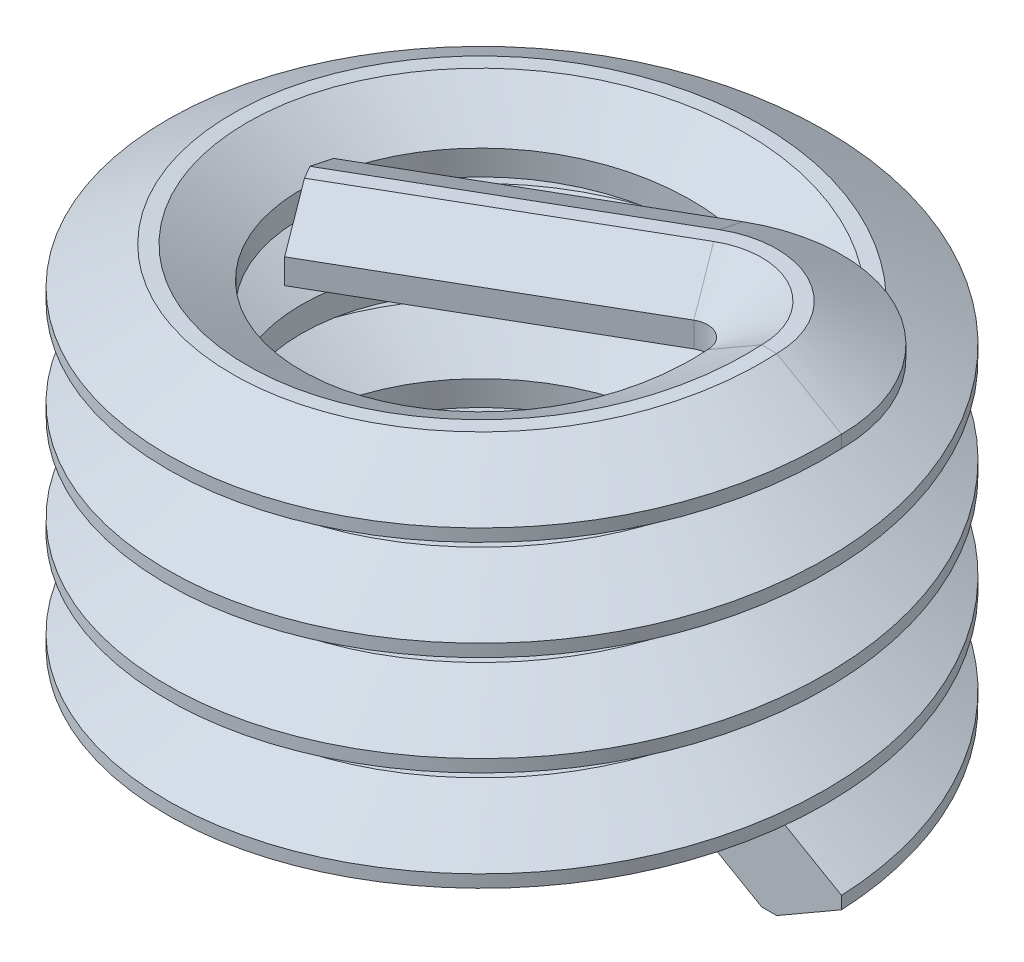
ISO-10303-21;
HEADER;
FILE_DESCRIPTION(('STEP AP214'),'2;1');
FILE_NAME('part.step','',(''),(''),'','','');
FILE_SCHEMA(('AUTOMOTIVE_DESIGN { 1 0 10303 214 1 1 1 1 }'));
ENDSEC;
DATA;
#1=APPLICATION_CONTEXT('core data for automotive mechanical design processes');
#2=APPLICATION_PROTOCOL_DEFINITION('international standard','automotive_design',2000,#1);
#3=PRODUCT_CONTEXT('',#1,'mechanical');
#4=PRODUCT('Part','Part','',(#3));
#5=PRODUCT_RELATED_PRODUCT_CATEGORY('part','',(#4));
#6=PRODUCT_DEFINITION_FORMATION('','',#4);
#7=PRODUCT_DEFINITION_CONTEXT('part definition',#1,'design');
#8=PRODUCT_DEFINITION('design','',#6,#7);
#9=PRODUCT_DEFINITION_SHAPE('','',#8);
#10=(LENGTH_UNIT() NAMED_UNIT(*) SI_UNIT(.MILLI.,.METRE.));
#11=(NAMED_UNIT(*) PLANE_ANGLE_UNIT() SI_UNIT($,.RADIAN.));
#12=(NAMED_UNIT(*) SI_UNIT($,.STERADIAN.) SOLID_ANGLE_UNIT());
#13=UNCERTAINTY_MEASURE_WITH_UNIT(LENGTH_MEASURE(1.E-05),#10,'distance_accuracy_value','');
#14=(GEOMETRIC_REPRESENTATION_CONTEXT(3) GLOBAL_UNCERTAINTY_ASSIGNED_CONTEXT((#13)) GLOBAL_UNIT_ASSIGNED_CONTEXT((#10,
#11,#12)) REPRESENTATION_CONTEXT('',''));
#15=CARTESIAN_POINT('',(0.,0.,0.));
#16=DIRECTION('',(0.,0.,1.));
#17=DIRECTION('',(1.,0.,0.));
#18=AXIS2_PLACEMENT_3D('',#15,#16,#17);
#19=CARTESIAN_POINT('',(1.73144390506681,5.635625,-0.833437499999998));
#20=DIRECTION('',(0.,-1.,0.));
#21=DIRECTION('',(1.,0.,0.));
#22=AXIS2_PLACEMENT_3D('',#19,#20,#21);
#23=PLANE('',#22);
#24=CARTESIAN_POINT('',(2.21262927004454,5.635625,0.));
#25=DIRECTION('',(0.,-1.,0.));
#26=DIRECTION('',(1.,0.,0.));
#27=AXIS2_PLACEMENT_3D('',#24,#25,#26);
#28=CIRCLE('',#27,1.15348153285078);
#29=CARTESIAN_POINT('',(1.63588850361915,5.635625,-0.998944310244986));
#30=VERTEX_POINT('',#29);
#31=CARTESIAN_POINT('',(3.36611080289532,5.635625,0.));
#32=VERTEX_POINT('',#31);
#33=EDGE_CURVE('E12',#30,#32,#28,.T.);
#34=ORIENTED_EDGE('',*,*,#33,.F.);
#35=DIRECTION('',(0.866025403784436,0.,-0.500000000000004));
#36=VECTOR('',#35,1.);
#37=CARTESIAN_POINT('',(-1.66366828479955,5.63562500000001,0.906055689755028));
#38=LINE('',#37,#36);
#39=CARTESIAN_POINT('',(-1.66366828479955,5.63562500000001,0.906055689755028));
#40=VERTEX_POINT('',#39);
#41=EDGE_CURVE('E160',#40,#30,#38,.T.);
#42=ORIENTED_EDGE('',*,*,#41,.F.);
#43=CARTESIAN_POINT('',(-1.56811288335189,5.63562500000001,1.07156250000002));
#44=CARTESIAN_POINT('',(-1.66366828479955,5.63562500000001,0.906055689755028));
#45=B_SPLINE_CURVE_WITH_KNOTS('',1,(#43,#44),.UNSPECIFIED.,.F.,.F.,(2,2),(0.,1.),.UNSPECIFIED.);
#46=CARTESIAN_POINT('',(-1.56811288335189,5.63562500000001,1.07156250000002));
#47=VERTEX_POINT('',#46);
#48=EDGE_CURVE('E142',#47,#40,#45,.T.);
#49=ORIENTED_EDGE('',*,*,#48,.F.);
#50=DIRECTION('',(0.866025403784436,0.,-0.500000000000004));
#51=VECTOR('',#50,1.);
#52=CARTESIAN_POINT('',(-1.56811288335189,5.63562500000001,1.07156250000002));
#53=LINE('',#52,#51);
#54=CARTESIAN_POINT('',(1.73144390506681,5.635625,-0.833437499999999));
#55=VERTEX_POINT('',#54);
#56=EDGE_CURVE('E139',#47,#55,#53,.T.);
#57=ORIENTED_EDGE('',*,*,#56,.T.);
#58=CARTESIAN_POINT('',(2.21262927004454,5.635625,0.));
#59=DIRECTION('',(0.,-1.,0.));
#60=DIRECTION('',(1.,0.,0.));
#61=AXIS2_PLACEMENT_3D('',#58,#59,#60);
#62=CIRCLE('',#61,0.962370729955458);
#63=CARTESIAN_POINT('',(3.175,5.635625,0.));
#64=VERTEX_POINT('',#63);
#65=EDGE_CURVE('E197',#55,#64,#62,.T.);
#66=ORIENTED_EDGE('',*,*,#65,.T.);
#67=DIRECTION('',(1.,0.,0.));
#68=VECTOR('',#67,1.);
#69=CARTESIAN_POINT('',(3.175,5.635625,0.));
#70=LINE('',#69,#68);
#71=EDGE_CURVE('E155',#64,#32,#70,.T.);
#72=ORIENTED_EDGE('',*,*,#71,.T.);
#73=EDGE_LOOP('',(#34,#42,#49,#57,#66,#72));
#74=FACE_BOUND('',#73,.T.);
#75=ADVANCED_FACE('F42',(#74),#23,.F.);
#76=CARTESIAN_POINT('',(2.21262927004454,5.635625,0.));
#77=DIRECTION('',(0.,-1.,0.));
#78=DIRECTION('',(1.,0.,0.));
#79=AXIS2_PLACEMENT_3D('',#76,#77,#78);
#80=CONICAL_SURFACE('',#79,1.15348153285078,1.0471975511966);
#81=CARTESIAN_POINT('',(2.21262927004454,5.159375,0.));
#82=DIRECTION('',(0.,-1.,0.));
#83=DIRECTION('',(1.,0.,0.));
#84=AXIS2_PLACEMENT_3D('',#81,#82,#83);
#85=CIRCLE('',#84,1.97837072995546);
#86=CARTESIAN_POINT('',(1.2234439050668,5.159375,-1.71331931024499));
#87=VERTEX_POINT('',#86);
#88=CARTESIAN_POINT('',(4.191,5.159375,0.));
#89=VERTEX_POINT('',#88);
#90=EDGE_CURVE('E50',#87,#89,#85,.T.);
#91=ORIENTED_EDGE('',*,*,#90,.F.);
#92=DIRECTION('',(-0.433012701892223,-0.499999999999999,-0.749999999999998));
#93=VECTOR('',#92,1.);
#94=CARTESIAN_POINT('',(1.63588850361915,5.635625,-0.998944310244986));
#95=LINE('',#94,#93);
#96=EDGE_CURVE('E182',#30,#87,#95,.T.);
#97=ORIENTED_EDGE('',*,*,#96,.F.);
#98=ORIENTED_EDGE('',*,*,#33,.T.);
#99=DIRECTION('',(0.866025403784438,-0.500000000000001,0.));
#100=VECTOR('',#99,1.);
#101=CARTESIAN_POINT('',(3.36611080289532,5.635625,0.));
#102=LINE('',#101,#100);
#103=EDGE_CURVE('E158',#32,#89,#102,.T.);
#104=ORIENTED_EDGE('',*,*,#103,.T.);
#105=EDGE_LOOP('',(#91,#97,#98,#104));
#106=FACE_BOUND('',#105,.T.);
#107=ADVANCED_FACE('F44',(#106),#80,.T.);
#108=CARTESIAN_POINT('',(2.21262927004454,5.08,0.));
#109=DIRECTION('',(0.,-1.,0.));
#110=DIRECTION('',(1.,0.,0.));
#111=AXIS2_PLACEMENT_3D('',#108,#109,#110);
#112=CYLINDRICAL_SURFACE('',#111,1.97837072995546);
#113=CARTESIAN_POINT('',(2.21262927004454,5.000625,0.));
#114=DIRECTION('',(0.,-1.,0.));
#115=DIRECTION('',(1.,0.,0.));
#116=AXIS2_PLACEMENT_3D('',#113,#114,#115);
#117=CIRCLE('',#116,1.97837072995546);
#118=CARTESIAN_POINT('',(1.2234439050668,5.00062500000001,-1.71331931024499));
#119=VERTEX_POINT('',#118);
#120=CARTESIAN_POINT('',(4.191,5.000625,0.));
#121=VERTEX_POINT('',#120);
#122=EDGE_CURVE('E205',#119,#121,#117,.T.);
#123=ORIENTED_EDGE('',*,*,#122,.F.);
#124=DIRECTION('',(0.,-1.,0.));
#125=VECTOR('',#124,1.);
#126=CARTESIAN_POINT('',(1.2234439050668,5.159375,-1.71331931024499));
#127=LINE('',#126,#125);
#128=EDGE_CURVE('E185',#87,#119,#127,.T.);
#129=ORIENTED_EDGE('',*,*,#128,.F.);
#130=ORIENTED_EDGE('',*,*,#90,.T.);
#131=DIRECTION('',(0.,-1.,0.));
#132=VECTOR('',#131,1.);
#133=CARTESIAN_POINT('',(4.191,5.159375,0.));
#134=LINE('',#133,#132);
#135=EDGE_CURVE('E166',#89,#121,#134,.T.);
#136=ORIENTED_EDGE('',*,*,#135,.T.);
#137=EDGE_LOOP('',(#123,#129,#130,#136));
#138=FACE_BOUND('',#137,.T.);
#139=ADVANCED_FACE('F208',(#138),#112,.T.);
#140=CARTESIAN_POINT('',(2.21262927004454,5.000625,0.));
#141=DIRECTION('',(0.,1.,0.));
#142=DIRECTION('',(-1.,0.,0.));
#143=AXIS2_PLACEMENT_3D('',#140,#141,#142);
#144=CONICAL_SURFACE('',#143,1.97837072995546,1.04719755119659);
#145=CARTESIAN_POINT('',(2.21262927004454,4.524375,0.));
#146=DIRECTION('',(0.,-1.,0.));
#147=DIRECTION('',(1.,0.,0.));
#148=AXIS2_PLACEMENT_3D('',#145,#146,#147);
#149=CIRCLE('',#148,1.15348153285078);
#150=CARTESIAN_POINT('',(1.63588850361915,4.524375,-0.998944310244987));
#151=VERTEX_POINT('',#150);
#152=CARTESIAN_POINT('',(3.36611080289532,4.524375,0.));
#153=VERTEX_POINT('',#152);
#154=EDGE_CURVE('E203',#151,#153,#149,.T.);
#155=ORIENTED_EDGE('',*,*,#154,.F.);
#156=DIRECTION('',(0.433012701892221,-0.500000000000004,0.749999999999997));
#157=VECTOR('',#156,1.);
#158=CARTESIAN_POINT('',(1.2234439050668,5.00062500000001,-1.71331931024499));
#159=LINE('',#158,#157);
#160=EDGE_CURVE('E188',#119,#151,#159,.T.);
#161=ORIENTED_EDGE('',*,*,#160,.F.);
#162=ORIENTED_EDGE('',*,*,#122,.T.);
#163=DIRECTION('',(-0.866025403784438,-0.500000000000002,0.));
#164=VECTOR('',#163,1.);
#165=CARTESIAN_POINT('',(4.191,5.000625,0.));
#166=LINE('',#165,#164);
#167=EDGE_CURVE('E169',#121,#153,#166,.T.);
#168=ORIENTED_EDGE('',*,*,#167,.T.);
#169=EDGE_LOOP('',(#155,#161,#162,#168));
#170=FACE_BOUND('',#169,.T.);
#171=ADVANCED_FACE('F220',(#170),#144,.T.);
#172=CARTESIAN_POINT('',(1.63588850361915,4.524375,-0.998944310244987));
#173=DIRECTION('',(0.,1.,0.));
#174=DIRECTION('',(-1.,0.,0.));
#175=AXIS2_PLACEMENT_3D('',#172,#173,#174);
#176=PLANE('',#175);
#177=CARTESIAN_POINT('',(2.21262927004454,4.524375,0.));
#178=DIRECTION('',(0.,-1.,0.));
#179=DIRECTION('',(1.,0.,0.));
#180=AXIS2_PLACEMENT_3D('',#177,#178,#179);
#181=CIRCLE('',#180,0.96237072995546);
#182=CARTESIAN_POINT('',(1.73144390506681,4.524375,-0.833437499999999));
#183=VERTEX_POINT('',#182);
#184=CARTESIAN_POINT('',(3.175,4.524375,0.));
#185=VERTEX_POINT('',#184);
#186=EDGE_CURVE('E201',#183,#185,#181,.T.);
#187=ORIENTED_EDGE('',*,*,#186,.F.);
#188=DIRECTION('',(0.866025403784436,0.,-0.500000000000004));
#189=VECTOR('',#188,1.);
#190=CARTESIAN_POINT('',(-1.56811288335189,4.52437500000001,1.07156250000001));
#191=LINE('',#190,#189);
#192=CARTESIAN_POINT('',(-1.56811288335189,4.52437500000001,1.07156250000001));
#193=VERTEX_POINT('',#192);
#194=EDGE_CURVE('E240',#193,#183,#191,.T.);
#195=ORIENTED_EDGE('',*,*,#194,.F.);
#196=DIRECTION('',(0.500000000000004,0.,0.866025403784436));
#197=VECTOR('',#196,1.);
#198=CARTESIAN_POINT('',(-1.66366828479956,4.52437500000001,0.906055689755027));
#199=LINE('',#198,#197);
#200=CARTESIAN_POINT('',(-1.66366828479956,4.52437500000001,0.906055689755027));
#201=VERTEX_POINT('',#200);
#202=EDGE_CURVE('E261',#201,#193,#199,.T.);
#203=ORIENTED_EDGE('',*,*,#202,.F.);
#204=DIRECTION('',(0.866025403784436,0.,-0.500000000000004));
#205=VECTOR('',#204,1.);
#206=CARTESIAN_POINT('',(-1.66366828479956,4.52437500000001,0.906055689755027));
#207=LINE('',#206,#205);
#208=EDGE_CURVE('E237',#201,#151,#207,.T.);
#209=ORIENTED_EDGE('',*,*,#208,.T.);
#210=ORIENTED_EDGE('',*,*,#154,.T.);
#211=DIRECTION('',(-1.,0.,0.));
#212=VECTOR('',#211,1.);
#213=CARTESIAN_POINT('',(3.36611080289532,4.524375,0.));
#214=LINE('',#213,#212);
#215=EDGE_CURVE('E172',#153,#185,#214,.T.);
#216=ORIENTED_EDGE('',*,*,#215,.T.);
#217=EDGE_LOOP('',(#187,#195,#203,#209,#210,#216));
#218=FACE_BOUND('',#217,.T.);
#219=ADVANCED_FACE('F259',(#218),#176,.F.);
#220=CARTESIAN_POINT('',(2.21262927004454,4.524375,0.));
#221=DIRECTION('',(0.,-1.,0.));
#222=DIRECTION('',(1.,0.,0.));
#223=AXIS2_PLACEMENT_3D('',#220,#221,#222);
#224=CONICAL_SURFACE('',#223,0.962370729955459,1.0471975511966);
#225=CARTESIAN_POINT('',(2.21262927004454,4.92125,0.));
#226=DIRECTION('',(0.,-1.,0.));
#227=DIRECTION('',(1.,0.,0.));
#228=AXIS2_PLACEMENT_3D('',#225,#226,#227);
#229=CIRCLE('',#228,0.274963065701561);
#230=CARTESIAN_POINT('',(2.07514773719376,4.92125,-0.238125));
#231=VERTEX_POINT('',#230);
#232=CARTESIAN_POINT('',(2.4875923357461,4.92125,0.));
#233=VERTEX_POINT('',#232);
#234=EDGE_CURVE('E65',#231,#233,#229,.T.);
#235=ORIENTED_EDGE('',*,*,#234,.F.);
#236=DIRECTION('',(0.433012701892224,0.499999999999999,0.749999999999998));
#237=VECTOR('',#236,1.);
#238=CARTESIAN_POINT('',(1.73144390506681,4.524375,-0.833437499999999));
#239=LINE('',#238,#237);
#240=EDGE_CURVE('E191',#183,#231,#239,.T.);
#241=ORIENTED_EDGE('',*,*,#240,.F.);
#242=ORIENTED_EDGE('',*,*,#186,.T.);
#243=DIRECTION('',(-0.866025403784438,0.5,0.));
#244=VECTOR('',#243,1.);
#245=CARTESIAN_POINT('',(3.175,4.524375,0.));
#246=LINE('',#245,#244);
#247=EDGE_CURVE('E175',#185,#233,#246,.T.);
#248=ORIENTED_EDGE('',*,*,#247,.T.);
#249=EDGE_LOOP('',(#235,#241,#242,#248));
#250=FACE_BOUND('',#249,.T.);
#251=ADVANCED_FACE('F255',(#250),#224,.F.);
#252=CARTESIAN_POINT('',(2.21262927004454,5.08,0.));
#253=DIRECTION('',(0.,-1.,0.));
#254=DIRECTION('',(1.,0.,0.));
#255=AXIS2_PLACEMENT_3D('',#252,#253,#254);
#256=CYLINDRICAL_SURFACE('',#255,0.27496306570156);
#257=CARTESIAN_POINT('',(2.21262927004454,5.23875,0.));
#258=DIRECTION('',(0.,-1.,0.));
#259=DIRECTION('',(1.,0.,0.));
#260=AXIS2_PLACEMENT_3D('',#257,#258,#259);
#261=CIRCLE('',#260,0.27496306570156);
#262=CARTESIAN_POINT('',(2.07514773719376,5.23875,-0.238125));
#263=VERTEX_POINT('',#262);
#264=CARTESIAN_POINT('',(2.4875923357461,5.23875,0.));
#265=VERTEX_POINT('',#264);
#266=EDGE_CURVE('E57',#263,#265,#261,.T.);
#267=ORIENTED_EDGE('',*,*,#266,.F.);
#268=DIRECTION('',(0.,1.,0.));
#269=VECTOR('',#268,1.);
#270=CARTESIAN_POINT('',(2.07514773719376,4.92125,-0.238125));
#271=LINE('',#270,#269);
#272=EDGE_CURVE('E154',#231,#263,#271,.T.);
#273=ORIENTED_EDGE('',*,*,#272,.F.);
#274=ORIENTED_EDGE('',*,*,#234,.T.);
#275=DIRECTION('',(0.,1.,0.));
#276=VECTOR('',#275,1.);
#277=CARTESIAN_POINT('',(2.4875923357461,4.92125,0.));
#278=LINE('',#277,#276);
#279=EDGE_CURVE('E177',#233,#265,#278,.T.);
#280=ORIENTED_EDGE('',*,*,#279,.T.);
#281=EDGE_LOOP('',(#267,#273,#274,#280));
#282=FACE_BOUND('',#281,.T.);
#283=ADVANCED_FACE('F254',(#282),#256,.F.);
#284=CARTESIAN_POINT('',(2.21262927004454,5.23875,0.));
#285=DIRECTION('',(0.,1.,0.));
#286=DIRECTION('',(-1.,0.,0.));
#287=AXIS2_PLACEMENT_3D('',#284,#285,#286);
#288=CONICAL_SURFACE('',#287,0.27496306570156,1.0471975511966);
#289=DIRECTION('',(-0.433012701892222,0.500000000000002,-0.749999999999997));
#290=VECTOR('',#289,1.);
#291=CARTESIAN_POINT('',(2.07514773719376,5.23875,-0.238125));
#292=LINE('',#291,#290);
#293=EDGE_CURVE('E195',#263,#55,#292,.T.);
#294=ORIENTED_EDGE('',*,*,#293,.F.);
#295=ORIENTED_EDGE('',*,*,#266,.T.);
#296=DIRECTION('',(0.866025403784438,0.5,0.));
#297=VECTOR('',#296,1.);
#298=CARTESIAN_POINT('',(2.4875923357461,5.23875,0.));
#299=LINE('',#298,#297);
#300=EDGE_CURVE('E179',#265,#64,#299,.T.);
#301=ORIENTED_EDGE('',*,*,#300,.T.);
#302=ORIENTED_EDGE('',*,*,#65,.F.);
#303=EDGE_LOOP('',(#294,#295,#301,#302));
#304=FACE_BOUND('',#303,.T.);
#305=ADVANCED_FACE('F253',(#304),#288,.F.);
#306=CARTESIAN_POINT('',(4.191,5.635625,0.));
#307=DIRECTION('',(0.,0.,-1.));
#308=DIRECTION('',(-1.,0.,0.));
#309=AXIS2_PLACEMENT_3D('',#306,#307,#308);
#310=PLANE('',#309);
#311=ORIENTED_EDGE('',*,*,#71,.F.);
#312=ORIENTED_EDGE('',*,*,#300,.F.);
#313=ORIENTED_EDGE('',*,*,#279,.F.);
#314=ORIENTED_EDGE('',*,*,#247,.F.);
#315=ORIENTED_EDGE('',*,*,#215,.F.);
#316=ORIENTED_EDGE('',*,*,#167,.F.);
#317=ORIENTED_EDGE('',*,*,#135,.F.);
#318=ORIENTED_EDGE('',*,*,#103,.F.);
#319=EDGE_LOOP('',(#311,#312,#313,#314,#315,#316,#317,#318));
#320=FACE_BOUND('',#319,.T.);
#321=ADVANCED_FACE('F216',(#320),#310,.F.);
#322=CARTESIAN_POINT('',(-1.22440905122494,4.92125000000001,1.66687500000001));
#323=DIRECTION('',(-0.500000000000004,0.,-0.866025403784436));
#324=DIRECTION('',(-0.866025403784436,0.,0.500000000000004));
#325=AXIS2_PLACEMENT_3D('',#322,#323,#324);
#326=PLANE('',#325);
#327=ORIENTED_EDGE('',*,*,#272,.T.);
#328=DIRECTION('',(0.866025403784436,0.,-0.500000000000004));
#329=VECTOR('',#328,1.);
#330=CARTESIAN_POINT('',(-1.22440905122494,5.23875000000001,1.66687500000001));
#331=LINE('',#330,#329);
#332=CARTESIAN_POINT('',(-1.22440905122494,5.23875000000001,1.66687500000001));
#333=VERTEX_POINT('',#332);
#334=EDGE_CURVE('E136',#333,#263,#331,.T.);
#335=ORIENTED_EDGE('',*,*,#334,.F.);
#336=DIRECTION('',(0.,1.,0.));
#337=VECTOR('',#336,1.);
#338=CARTESIAN_POINT('',(-1.22440905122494,4.92125000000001,1.66687500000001));
#339=LINE('',#338,#337);
#340=CARTESIAN_POINT('',(-1.22440905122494,4.92125000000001,1.66687500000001));
#341=VERTEX_POINT('',#340);
#342=EDGE_CURVE('E143',#341,#333,#339,.T.);
#343=ORIENTED_EDGE('',*,*,#342,.F.);
#344=DIRECTION('',(0.866025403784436,0.,-0.500000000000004));
#345=VECTOR('',#344,1.);
#346=CARTESIAN_POINT('',(-1.22440905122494,4.92125000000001,1.66687500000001));
#347=LINE('',#346,#345);
#348=EDGE_CURVE('E263',#341,#231,#347,.T.);
#349=ORIENTED_EDGE('',*,*,#348,.T.);
#350=EDGE_LOOP('',(#327,#335,#343,#349));
#351=FACE_BOUND('',#350,.T.);
#352=ADVANCED_FACE('F153',(#351),#326,.F.);
#353=CARTESIAN_POINT('',(-1.22440905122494,5.23875000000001,1.66687500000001));
#354=DIRECTION('',(-0.250000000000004,-0.866025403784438,-0.433012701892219));
#355=DIRECTION('',(0.,0.447213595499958,-0.894427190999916));
#356=AXIS2_PLACEMENT_3D('',#353,#354,#355);
#357=PLANE('',#356);
#358=ORIENTED_EDGE('',*,*,#293,.T.);
#359=ORIENTED_EDGE('',*,*,#56,.F.);
#360=DIRECTION('',(-0.433012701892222,0.500000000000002,-0.749999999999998));
#361=VECTOR('',#360,1.);
#362=CARTESIAN_POINT('',(-1.22440905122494,5.23875000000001,1.66687500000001));
#363=LINE('',#362,#361);
#364=EDGE_CURVE('E131',#333,#47,#363,.T.);
#365=ORIENTED_EDGE('',*,*,#364,.F.);
#366=ORIENTED_EDGE('',*,*,#334,.T.);
#367=EDGE_LOOP('',(#358,#359,#365,#366));
#368=FACE_BOUND('',#367,.T.);
#369=ADVANCED_FACE('F134',(#368),#357,.F.);
#370=CARTESIAN_POINT('',(-1.66366828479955,5.63562500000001,0.906055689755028));
#371=DIRECTION('',(0.250000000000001,-0.866025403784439,0.433012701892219));
#372=DIRECTION('',(0.,-0.447213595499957,-0.894427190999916));
#373=AXIS2_PLACEMENT_3D('',#370,#371,#372);
#374=PLANE('',#373);
#375=ORIENTED_EDGE('',*,*,#96,.T.);
#376=DIRECTION('',(0.866025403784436,0.,-0.500000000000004));
#377=VECTOR('',#376,1.);
#378=CARTESIAN_POINT('',(-2.0761128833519,5.15937500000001,0.191680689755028));
#379=LINE('',#378,#377);
#380=CARTESIAN_POINT('',(-2.0761128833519,5.15937500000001,0.191680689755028));
#381=VERTEX_POINT('',#380);
#382=EDGE_CURVE('E234',#381,#87,#379,.T.);
#383=ORIENTED_EDGE('',*,*,#382,.F.);
#384=DIRECTION('',(-0.433012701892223,-0.5,-0.749999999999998));
#385=VECTOR('',#384,1.);
#386=CARTESIAN_POINT('',(-1.66366828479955,5.63562500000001,0.906055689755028));
#387=LINE('',#386,#385);
#388=EDGE_CURVE('E248',#40,#381,#387,.T.);
#389=ORIENTED_EDGE('',*,*,#388,.F.);
#390=ORIENTED_EDGE('',*,*,#41,.T.);
#391=EDGE_LOOP('',(#375,#383,#389,#390));
#392=FACE_BOUND('',#391,.T.);
#393=ADVANCED_FACE('F247',(#392),#374,.F.);
#394=CARTESIAN_POINT('',(-2.0761128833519,5.15937500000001,0.191680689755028));
#395=DIRECTION('',(0.500000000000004,0.,0.866025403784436));
#396=DIRECTION('',(0.866025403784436,0.,-0.500000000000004));
#397=AXIS2_PLACEMENT_3D('',#394,#395,#396);
#398=PLANE('',#397);
#399=ORIENTED_EDGE('',*,*,#128,.T.);
#400=DIRECTION('',(0.866025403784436,0.,-0.500000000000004));
#401=VECTOR('',#400,1.);
#402=CARTESIAN_POINT('',(-2.0761128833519,5.00062500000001,0.191680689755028));
#403=LINE('',#402,#401);
#404=CARTESIAN_POINT('',(-2.0761128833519,5.00062500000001,0.191680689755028));
#405=VERTEX_POINT('',#404);
#406=EDGE_CURVE('E231',#405,#119,#403,.T.);
#407=ORIENTED_EDGE('',*,*,#406,.F.);
#408=DIRECTION('',(0.,-1.,0.));
#409=VECTOR('',#408,1.);
#410=CARTESIAN_POINT('',(-2.0761128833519,5.15937500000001,0.191680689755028));
#411=LINE('',#410,#409);
#412=EDGE_CURVE('E265',#381,#405,#411,.T.);
#413=ORIENTED_EDGE('',*,*,#412,.F.);
#414=ORIENTED_EDGE('',*,*,#382,.T.);
#415=EDGE_LOOP('',(#399,#407,#413,#414));
#416=FACE_BOUND('',#415,.T.);
#417=ADVANCED_FACE('F229',(#416),#398,.F.);
#418=CARTESIAN_POINT('',(-2.0761128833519,5.00062500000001,0.191680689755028));
#419=DIRECTION('',(0.250000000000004,0.866025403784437,0.43301270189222));
#420=DIRECTION('',(0.,-0.447213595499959,0.894427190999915));
#421=AXIS2_PLACEMENT_3D('',#418,#419,#420);
#422=PLANE('',#421);
#423=ORIENTED_EDGE('',*,*,#160,.T.);
#424=ORIENTED_EDGE('',*,*,#208,.F.);
#425=DIRECTION('',(0.433012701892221,-0.500000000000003,0.749999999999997));
#426=VECTOR('',#425,1.);
#427=CARTESIAN_POINT('',(-2.0761128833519,5.00062500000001,0.191680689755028));
#428=LINE('',#427,#426);
#429=EDGE_CURVE('E236',#405,#201,#428,.T.);
#430=ORIENTED_EDGE('',*,*,#429,.F.);
#431=ORIENTED_EDGE('',*,*,#406,.T.);
#432=EDGE_LOOP('',(#423,#424,#430,#431));
#433=FACE_BOUND('',#432,.T.);
#434=ADVANCED_FACE('F235',(#433),#422,.F.);
#435=CARTESIAN_POINT('',(-1.56811288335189,4.52437500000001,1.07156250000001));
#436=DIRECTION('',(-0.250000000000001,0.866025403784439,-0.433012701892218));
#437=DIRECTION('',(0.,0.447213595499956,0.894427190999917));
#438=AXIS2_PLACEMENT_3D('',#435,#436,#437);
#439=PLANE('',#438);
#440=ORIENTED_EDGE('',*,*,#240,.T.);
#441=ORIENTED_EDGE('',*,*,#348,.F.);
#442=DIRECTION('',(0.433012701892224,0.499999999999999,0.749999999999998));
#443=VECTOR('',#442,1.);
#444=CARTESIAN_POINT('',(-1.56811288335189,4.52437500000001,1.07156250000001));
#445=LINE('',#444,#443);
#446=EDGE_CURVE('E148',#193,#341,#445,.T.);
#447=ORIENTED_EDGE('',*,*,#446,.F.);
#448=ORIENTED_EDGE('',*,*,#194,.T.);
#449=EDGE_LOOP('',(#440,#441,#447,#448));
#450=FACE_BOUND('',#449,.T.);
#451=ADVANCED_FACE('F270',(#450),#439,.F.);
#452=CARTESIAN_POINT('',(-1.22440905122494,4.92125000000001,1.66687500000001));
#453=DIRECTION('',(0.866025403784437,0.,-0.500000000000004));
#454=DIRECTION('',(-0.500000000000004,0.,-0.866025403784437));
#455=AXIS2_PLACEMENT_3D('',#452,#453,#454);
#456=PLANE('',#455);
#457=ORIENTED_EDGE('',*,*,#342,.T.);
#458=ORIENTED_EDGE('',*,*,#364,.T.);
#459=ORIENTED_EDGE('',*,*,#48,.T.);
#460=ORIENTED_EDGE('',*,*,#388,.T.);
#461=ORIENTED_EDGE('',*,*,#412,.T.);
#462=ORIENTED_EDGE('',*,*,#429,.T.);
#463=ORIENTED_EDGE('',*,*,#202,.T.);
#464=ORIENTED_EDGE('',*,*,#446,.T.);
#465=EDGE_LOOP('',(#457,#458,#459,#460,#461,#462,#463,#464));
#466=FACE_BOUND('',#465,.T.);
#467=ADVANCED_FACE('F146',(#466),#456,.F.);
#468=CLOSED_SHELL('',(#75,#107,#139,#171,#219,#251,#283,#305,#321,#352,#369,#393,#417,#434,#451,#467));
#469=MANIFOLD_SOLID_BREP('B2',#468);
#470=CARTESIAN_POINT('',(2.4875923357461,0.,0.));
#471=DIRECTION('',(0.,0.,1.));
#472=DIRECTION('',(1.,0.,0.));
#473=AXIS2_PLACEMENT_3D('',#470,#471,#472);
#474=PLANE('',#473);
#475=DIRECTION('',(0.,-1.,0.));
#476=VECTOR('',#475,1.);
#477=CARTESIAN_POINT('',(2.4875923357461,0.,0.));
#478=LINE('',#477,#476);
#479=CARTESIAN_POINT('',(2.4875923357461,0.158750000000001,0.));
#480=VERTEX_POINT('',#479);
#481=CARTESIAN_POINT('',(2.4875923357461,-0.158750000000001,0.));
#482=VERTEX_POINT('',#481);
#483=EDGE_CURVE('E421',#480,#482,#478,.T.);
#484=ORIENTED_EDGE('',*,*,#483,.T.);
#485=DIRECTION('',(0.866025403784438,-0.5,0.));
#486=VECTOR('',#485,1.);
#487=CARTESIAN_POINT('',(2.83129616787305,-0.357187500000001,0.));
#488=LINE('',#487,#486);
#489=CARTESIAN_POINT('',(3.175,-0.555625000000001,0.));
#490=VERTEX_POINT('',#489);
#491=EDGE_CURVE('E416',#482,#490,#488,.T.);
#492=ORIENTED_EDGE('',*,*,#491,.T.);
#493=DIRECTION('',(1.,0.,0.));
#494=VECTOR('',#493,1.);
#495=CARTESIAN_POINT('',(3.27055540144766,-0.555625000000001,0.));
#496=LINE('',#495,#494);
#497=CARTESIAN_POINT('',(3.36611080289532,-0.555625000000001,0.));
#498=VERTEX_POINT('',#497);
#499=EDGE_CURVE('E480',#490,#498,#496,.T.);
#500=ORIENTED_EDGE('',*,*,#499,.T.);
#501=DIRECTION('',(0.866025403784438,0.500000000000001,0.));
#502=VECTOR('',#501,1.);
#503=CARTESIAN_POINT('',(3.77855540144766,-0.3175,0.));
#504=LINE('',#503,#502);
#505=CARTESIAN_POINT('',(4.191,-0.0793749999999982,0.));
#506=VERTEX_POINT('',#505);
#507=EDGE_CURVE('E652',#498,#506,#504,.T.);
#508=ORIENTED_EDGE('',*,*,#507,.T.);
#509=DIRECTION('',(0.,1.,0.));
#510=VECTOR('',#509,1.);
#511=CARTESIAN_POINT('',(4.191,0.,0.));
#512=LINE('',#511,#510);
#513=CARTESIAN_POINT('',(4.191,0.079374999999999,0.));
#514=VERTEX_POINT('',#513);
#515=EDGE_CURVE('E660',#506,#514,#512,.T.);
#516=ORIENTED_EDGE('',*,*,#515,.T.);
#517=DIRECTION('',(-0.866025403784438,0.500000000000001,0.));
#518=VECTOR('',#517,1.);
#519=CARTESIAN_POINT('',(3.77855540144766,0.3175,0.));
#520=LINE('',#519,#518);
#521=CARTESIAN_POINT('',(3.36611080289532,0.555625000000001,0.));
#522=VERTEX_POINT('',#521);
#523=EDGE_CURVE('E666',#514,#522,#520,.T.);
#524=ORIENTED_EDGE('',*,*,#523,.T.);
#525=DIRECTION('',(-1.,0.,0.));
#526=VECTOR('',#525,1.);
#527=CARTESIAN_POINT('',(3.27055540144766,0.555625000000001,0.));
#528=LINE('',#527,#526);
#529=CARTESIAN_POINT('',(3.175,0.555625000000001,0.));
#530=VERTEX_POINT('',#529);
#531=EDGE_CURVE('E672',#522,#530,#528,.T.);
#532=ORIENTED_EDGE('',*,*,#531,.T.);
#533=DIRECTION('',(-0.866025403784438,-0.5,0.));
#534=VECTOR('',#533,1.);
#535=CARTESIAN_POINT('',(2.83129616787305,0.357187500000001,0.));
#536=LINE('',#535,#534);
#537=EDGE_CURVE('E437',#530,#480,#536,.T.);
#538=ORIENTED_EDGE('',*,*,#537,.T.);
#539=EDGE_LOOP('',(#484,#492,#500,#508,#516,#524,#532,#538));
#540=FACE_BOUND('',#539,.T.);
#541=ADVANCED_FACE('F412',(#540),#474,.T.);
#542=CARTESIAN_POINT('',(2.4875923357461,5.08,0.));
#543=DIRECTION('',(0.,0.,-1.));
#544=DIRECTION('',(-1.,0.,0.));
#545=AXIS2_PLACEMENT_3D('',#542,#543,#544);
#546=PLANE('',#545);
#547=DIRECTION('',(0.,1.,0.));
#548=VECTOR('',#547,1.);
#549=CARTESIAN_POINT('',(2.4875923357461,5.08,0.));
#550=LINE('',#549,#548);
#551=CARTESIAN_POINT('',(2.4875923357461,4.92125,0.));
#552=VERTEX_POINT('',#551);
#553=CARTESIAN_POINT('',(2.4875923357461,5.23875,0.));
#554=VERTEX_POINT('',#553);
#555=EDGE_CURVE('E40',#552,#554,#550,.T.);
#556=ORIENTED_EDGE('',*,*,#555,.T.);
#557=DIRECTION('',(0.866025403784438,0.5,0.));
#558=VECTOR('',#557,1.);
#559=CARTESIAN_POINT('',(2.83129616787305,5.4371875,0.));
#560=LINE('',#559,#558);
#561=CARTESIAN_POINT('',(3.175,5.635625,0.));
#562=VERTEX_POINT('',#561);
#563=EDGE_CURVE('E679',#554,#562,#560,.T.);
#564=ORIENTED_EDGE('',*,*,#563,.T.);
#565=DIRECTION('',(1.,0.,0.));
#566=VECTOR('',#565,1.);
#567=CARTESIAN_POINT('',(3.27055540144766,5.635625,0.));
#568=LINE('',#567,#566);
#569=CARTESIAN_POINT('',(3.36611080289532,5.635625,0.));
#570=VERTEX_POINT('',#569);
#571=EDGE_CURVE('E675',#562,#570,#568,.T.);
#572=ORIENTED_EDGE('',*,*,#571,.T.);
#573=DIRECTION('',(0.866025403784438,-0.500000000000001,0.));
#574=VECTOR('',#573,1.);
#575=CARTESIAN_POINT('',(3.77855540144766,5.3975,0.));
#576=LINE('',#575,#574);
#577=CARTESIAN_POINT('',(4.191,5.159375,0.));
#578=VERTEX_POINT('',#577);
#579=EDGE_CURVE('E669',#570,#578,#576,.T.);
#580=ORIENTED_EDGE('',*,*,#579,.T.);
#581=DIRECTION('',(0.,-1.,0.));
#582=VECTOR('',#581,1.);
#583=CARTESIAN_POINT('',(4.191,5.08,0.));
#584=LINE('',#583,#582);
#585=CARTESIAN_POINT('',(4.191,5.000625,0.));
#586=VERTEX_POINT('',#585);
#587=EDGE_CURVE('E663',#578,#586,#584,.T.);
#588=ORIENTED_EDGE('',*,*,#587,.T.);
#589=DIRECTION('',(-0.866025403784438,-0.500000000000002,0.));
#590=VECTOR('',#589,1.);
#591=CARTESIAN_POINT('',(3.77855540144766,4.7625,0.));
#592=LINE('',#591,#590);
#593=CARTESIAN_POINT('',(3.36611080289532,4.524375,0.));
#594=VERTEX_POINT('',#593);
#595=EDGE_CURVE('E656',#586,#594,#592,.T.);
#596=ORIENTED_EDGE('',*,*,#595,.T.);
#597=DIRECTION('',(-1.,0.,0.));
#598=VECTOR('',#597,1.);
#599=CARTESIAN_POINT('',(3.27055540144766,4.524375,0.));
#600=LINE('',#599,#598);
#601=CARTESIAN_POINT('',(3.175,4.524375,0.));
#602=VERTEX_POINT('',#601);
#603=EDGE_CURVE('E498',#594,#602,#600,.T.);
#604=ORIENTED_EDGE('',*,*,#603,.T.);
#605=DIRECTION('',(-0.866025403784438,0.5,0.));
#606=VECTOR('',#605,1.);
#607=CARTESIAN_POINT('',(2.83129616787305,4.7228125,0.));
#608=LINE('',#607,#606);
#609=EDGE_CURVE('E485',#602,#552,#608,.T.);
#610=ORIENTED_EDGE('',*,*,#609,.T.);
#611=EDGE_LOOP('',(#556,#564,#572,#580,#588,#596,#604,#610));
#612=FACE_BOUND('',#611,.T.);
#613=ADVANCED_FACE('F414',(#612),#546,.T.);
#614=CARTESIAN_POINT('',(2.4875923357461,0.158750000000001,0.));
#615=CARTESIAN_POINT('',(2.4875923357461,0.238125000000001,-1.0303944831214));
#616=CARTESIAN_POINT('',(1.75899340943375,0.317500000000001,-1.75899340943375));
#617=CARTESIAN_POINT('',(1.0303944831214,0.396875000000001,-2.4875923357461));
#618=CARTESIAN_POINT('',(0.,0.476250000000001,-2.4875923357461));
#619=CARTESIAN_POINT('',(-1.0303944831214,0.555625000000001,-2.4875923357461));
#620=CARTESIAN_POINT('',(-1.75899340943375,0.635000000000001,-1.75899340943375));
#621=CARTESIAN_POINT('',(-2.4875923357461,0.714375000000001,-1.0303944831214));
#622=CARTESIAN_POINT('',(-2.4875923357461,0.793750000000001,0.));
#623=CARTESIAN_POINT('',(-2.4875923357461,0.873125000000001,1.0303944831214));
#624=CARTESIAN_POINT('',(-1.75899340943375,0.952500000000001,1.75899340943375));
#625=CARTESIAN_POINT('',(-1.0303944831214,1.031875,2.4875923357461));
#626=CARTESIAN_POINT('',(0.,1.11125,2.4875923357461));
#627=CARTESIAN_POINT('',(1.0303944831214,1.190625,2.4875923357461));
#628=CARTESIAN_POINT('',(1.75899340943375,1.27,1.75899340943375));
#629=CARTESIAN_POINT('',(2.4875923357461,1.349375,1.0303944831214));
#630=CARTESIAN_POINT('',(2.4875923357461,1.42875,0.));
#631=CARTESIAN_POINT('',(2.4875923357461,1.508125,-1.0303944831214));
#632=CARTESIAN_POINT('',(1.75899340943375,1.5875,-1.75899340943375));
#633=CARTESIAN_POINT('',(1.0303944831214,1.666875,-2.4875923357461));
#634=CARTESIAN_POINT('',(0.,1.74625,-2.4875923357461));
#635=CARTESIAN_POINT('',(-1.0303944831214,1.825625,-2.4875923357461));
#636=CARTESIAN_POINT('',(-1.75899340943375,1.905,-1.75899340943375));
#637=CARTESIAN_POINT('',(-2.4875923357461,1.984375,-1.0303944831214));
#638=CARTESIAN_POINT('',(-2.4875923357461,2.06375,0.));
#639=CARTESIAN_POINT('',(-2.4875923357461,2.143125,1.0303944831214));
#640=CARTESIAN_POINT('',(-1.75899340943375,2.2225,1.75899340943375));
#641=CARTESIAN_POINT('',(-1.0303944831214,2.301875,2.4875923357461));
#642=CARTESIAN_POINT('',(0.,2.38125,2.4875923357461));
#643=CARTESIAN_POINT('',(1.0303944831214,2.460625,2.4875923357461));
#644=CARTESIAN_POINT('',(1.75899340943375,2.54,1.75899340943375));
#645=CARTESIAN_POINT('',(2.4875923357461,2.619375,1.0303944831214));
#646=CARTESIAN_POINT('',(2.4875923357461,2.69875,0.));
#647=CARTESIAN_POINT('',(2.4875923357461,2.778125,-1.0303944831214));
#648=CARTESIAN_POINT('',(1.75899340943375,2.8575,-1.75899340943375));
#649=CARTESIAN_POINT('',(1.0303944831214,2.936875,-2.4875923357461));
#650=CARTESIAN_POINT('',(0.,3.01625,-2.4875923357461));
#651=CARTESIAN_POINT('',(-1.0303944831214,3.095625,-2.4875923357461));
#652=CARTESIAN_POINT('',(-1.75899340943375,3.175,-1.75899340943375));
#653=CARTESIAN_POINT('',(-2.4875923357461,3.254375,-1.0303944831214));
#654=CARTESIAN_POINT('',(-2.4875923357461,3.33375,0.));
#655=CARTESIAN_POINT('',(-2.4875923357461,3.413125,1.0303944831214));
#656=CARTESIAN_POINT('',(-1.75899340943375,3.4925,1.75899340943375));
#657=CARTESIAN_POINT('',(-1.0303944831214,3.571875,2.4875923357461));
#658=CARTESIAN_POINT('',(0.,3.65125,2.4875923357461));
#659=CARTESIAN_POINT('',(1.0303944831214,3.730625,2.4875923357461));
#660=CARTESIAN_POINT('',(1.75899340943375,3.81,1.75899340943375));
#661=CARTESIAN_POINT('',(2.4875923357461,3.889375,1.0303944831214));
#662=CARTESIAN_POINT('',(2.4875923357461,3.96875,0.));
#663=CARTESIAN_POINT('',(2.4875923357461,4.048125,-1.0303944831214));
#664=CARTESIAN_POINT('',(1.75899340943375,4.1275,-1.75899340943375));
#665=CARTESIAN_POINT('',(1.0303944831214,4.206875,-2.4875923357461));
#666=CARTESIAN_POINT('',(0.,4.28625,-2.4875923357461));
#667=CARTESIAN_POINT('',(-1.0303944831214,4.365625,-2.4875923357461));
#668=CARTESIAN_POINT('',(-1.75899340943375,4.445,-1.75899340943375));
#669=CARTESIAN_POINT('',(-2.4875923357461,4.524375,-1.0303944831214));
#670=CARTESIAN_POINT('',(-2.4875923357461,4.60375,0.));
#671=CARTESIAN_POINT('',(-2.4875923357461,4.683125,1.0303944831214));
#672=CARTESIAN_POINT('',(-1.75899340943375,4.7625,1.75899340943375));
#673=CARTESIAN_POINT('',(-1.0303944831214,4.841875,2.4875923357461));
#674=CARTESIAN_POINT('',(0.,4.92125,2.4875923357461));
#675=CARTESIAN_POINT('',(1.0303944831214,5.000625,2.4875923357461));
#676=CARTESIAN_POINT('',(1.75899340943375,5.08,1.75899340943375));
#677=CARTESIAN_POINT('',(2.4875923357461,5.159375,1.0303944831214));
#678=CARTESIAN_POINT('',(2.4875923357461,5.23875,0.));
#679=CARTESIAN_POINT('',(2.4875923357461,-0.158750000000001,0.));
#680=CARTESIAN_POINT('',(2.4875923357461,-0.0793750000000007,-1.0303944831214));
#681=CARTESIAN_POINT('',(1.75899340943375,0.,-1.75899340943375));
#682=CARTESIAN_POINT('',(1.0303944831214,0.0793749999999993,-2.4875923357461));
#683=CARTESIAN_POINT('',(0.,0.158749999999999,-2.4875923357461));
#684=CARTESIAN_POINT('',(-1.0303944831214,0.238124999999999,-2.4875923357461));
#685=CARTESIAN_POINT('',(-1.75899340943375,0.317499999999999,-1.75899340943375));
#686=CARTESIAN_POINT('',(-2.4875923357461,0.396874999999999,-1.0303944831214));
#687=CARTESIAN_POINT('',(-2.4875923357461,0.476249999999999,0.));
#688=CARTESIAN_POINT('',(-2.4875923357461,0.555624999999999,1.0303944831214));
#689=CARTESIAN_POINT('',(-1.75899340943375,0.634999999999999,1.75899340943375));
#690=CARTESIAN_POINT('',(-1.0303944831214,0.714374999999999,2.4875923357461));
#691=CARTESIAN_POINT('',(0.,0.793749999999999,2.4875923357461));
#692=CARTESIAN_POINT('',(1.0303944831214,0.873124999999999,2.4875923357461));
#693=CARTESIAN_POINT('',(1.75899340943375,0.952499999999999,1.75899340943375));
#694=CARTESIAN_POINT('',(2.4875923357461,1.031875,1.0303944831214));
#695=CARTESIAN_POINT('',(2.4875923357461,1.11125,0.));
#696=CARTESIAN_POINT('',(2.4875923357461,1.190625,-1.0303944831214));
#697=CARTESIAN_POINT('',(1.75899340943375,1.27,-1.75899340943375));
#698=CARTESIAN_POINT('',(1.0303944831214,1.349375,-2.4875923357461));
#699=CARTESIAN_POINT('',(0.,1.42875,-2.4875923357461));
#700=CARTESIAN_POINT('',(-1.0303944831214,1.508125,-2.4875923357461));
#701=CARTESIAN_POINT('',(-1.75899340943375,1.5875,-1.75899340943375));
#702=CARTESIAN_POINT('',(-2.4875923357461,1.666875,-1.0303944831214));
#703=CARTESIAN_POINT('',(-2.4875923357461,1.74625,0.));
#704=CARTESIAN_POINT('',(-2.4875923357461,1.825625,1.0303944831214));
#705=CARTESIAN_POINT('',(-1.75899340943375,1.905,1.75899340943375));
#706=CARTESIAN_POINT('',(-1.0303944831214,1.984375,2.4875923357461));
#707=CARTESIAN_POINT('',(0.,2.06375,2.4875923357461));
#708=CARTESIAN_POINT('',(1.0303944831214,2.143125,2.4875923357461));
#709=CARTESIAN_POINT('',(1.75899340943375,2.2225,1.75899340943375));
#710=CARTESIAN_POINT('',(2.4875923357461,2.301875,1.0303944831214));
#711=CARTESIAN_POINT('',(2.4875923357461,2.38125,0.));
#712=CARTESIAN_POINT('',(2.4875923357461,2.460625,-1.0303944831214));
#713=CARTESIAN_POINT('',(1.75899340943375,2.54,-1.75899340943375));
#714=CARTESIAN_POINT('',(1.0303944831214,2.619375,-2.4875923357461));
#715=CARTESIAN_POINT('',(0.,2.69875,-2.4875923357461));
#716=CARTESIAN_POINT('',(-1.0303944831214,2.778125,-2.4875923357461));
#717=CARTESIAN_POINT('',(-1.75899340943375,2.8575,-1.75899340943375));
#718=CARTESIAN_POINT('',(-2.4875923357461,2.936875,-1.0303944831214));
#719=CARTESIAN_POINT('',(-2.4875923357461,3.01625,0.));
#720=CARTESIAN_POINT('',(-2.4875923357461,3.095625,1.0303944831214));
#721=CARTESIAN_POINT('',(-1.75899340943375,3.175,1.75899340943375));
#722=CARTESIAN_POINT('',(-1.0303944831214,3.254375,2.4875923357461));
#723=CARTESIAN_POINT('',(0.,3.33375,2.4875923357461));
#724=CARTESIAN_POINT('',(1.0303944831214,3.413125,2.4875923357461));
#725=CARTESIAN_POINT('',(1.75899340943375,3.4925,1.75899340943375));
#726=CARTESIAN_POINT('',(2.4875923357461,3.571875,1.0303944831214));
#727=CARTESIAN_POINT('',(2.4875923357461,3.65125,0.));
#728=CARTESIAN_POINT('',(2.4875923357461,3.730625,-1.0303944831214));
#729=CARTESIAN_POINT('',(1.75899340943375,3.81,-1.75899340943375));
#730=CARTESIAN_POINT('',(1.0303944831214,3.889375,-2.4875923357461));
#731=CARTESIAN_POINT('',(0.,3.96875,-2.4875923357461));
#732=CARTESIAN_POINT('',(-1.0303944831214,4.048125,-2.4875923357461));
#733=CARTESIAN_POINT('',(-1.75899340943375,4.1275,-1.75899340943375));
#734=CARTESIAN_POINT('',(-2.4875923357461,4.206875,-1.0303944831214));
#735=CARTESIAN_POINT('',(-2.4875923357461,4.28625,0.));
#736=CARTESIAN_POINT('',(-2.4875923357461,4.365625,1.0303944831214));
#737=CARTESIAN_POINT('',(-1.75899340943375,4.445,1.75899340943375));
#738=CARTESIAN_POINT('',(-1.0303944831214,4.524375,2.4875923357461));
#739=CARTESIAN_POINT('',(0.,4.60375,2.4875923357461));
#740=CARTESIAN_POINT('',(1.0303944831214,4.683125,2.4875923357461));
#741=CARTESIAN_POINT('',(1.75899340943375,4.7625,1.75899340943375));
#742=CARTESIAN_POINT('',(2.4875923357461,4.841875,1.0303944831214));
#743=CARTESIAN_POINT('',(2.4875923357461,4.92125,0.));
#744=(BOUNDED_SURFACE() B_SPLINE_SURFACE(1,2,((#614,#615,#616,#617,#618,#619,#620,#621,#622,
#623,#624,#625,#626,#627,#628,#629,#630,#631,#632,#633,#634,#635,#636,#637,#638,#639,#640,#641,
#642,#643,#644,#645,#646,#647,#648,#649,#650,#651,#652,#653,#654,#655,#656,#657,#658,#659,#660,
#661,#662,#663,#664,#665,#666,#667,#668,#669,#670,#671,#672,#673,#674,#675,#676,#677,#678),
(#679,#680,#681,#682,#683,#684,#685,#686,#687,#688,#689,#690,#691,#692,#693,#694,#695,#696,#697,
#698,#699,#700,#701,#702,#703,#704,#705,#706,#707,#708,#709,#710,#711,#712,#713,#714,#715,#716,
#717,#718,#719,#720,#721,#722,#723,#724,#725,#726,#727,#728,#729,#730,#731,#732,#733,#734,#735,
#736,#737,#738,#739,#740,#741,#742,#743)),.UNSPECIFIED.,.F.,.F.,
.F.) B_SPLINE_SURFACE_WITH_KNOTS((2,2),(3,2,2,2,2,2,2,2,2,2,2,2,2,2,2,2,2,2,2,2,2,2,2,2,2,2,2,2,
2,2,2,2,3),(0.,1.),(0.,0.03125,0.0625,0.09375,0.125,0.15625,0.1875,0.21875,0.25,0.28125,0.3125,
0.34375,0.375,0.40625,0.4375,0.46875,0.5,0.53125,0.5625,0.59375,0.625,0.65625,0.6875,0.71875,
0.75,0.78125,0.8125,0.84375,0.875,0.90625,0.9375,0.96875,1.),
.UNSPECIFIED.) GEOMETRIC_REPRESENTATION_ITEM() RATIONAL_B_SPLINE_SURFACE(((1.,0.923879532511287,
1.,0.923879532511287,1.,0.923879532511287,1.,0.923879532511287,1.,0.923879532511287,1.,
0.923879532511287,1.,0.923879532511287,1.,0.923879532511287,1.,0.923879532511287,1.,
0.923879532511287,1.,0.923879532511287,1.,0.923879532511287,1.,0.923879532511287,1.,
0.923879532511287,1.,0.923879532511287,1.,0.923879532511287,1.,0.923879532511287,1.,
0.923879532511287,1.,0.923879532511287,1.,0.923879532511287,1.,0.923879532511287,1.,
0.923879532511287,1.,0.923879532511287,1.,0.923879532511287,1.,0.923879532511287,1.,
0.923879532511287,1.,0.923879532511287,1.,0.923879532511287,1.,0.923879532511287,1.,
0.923879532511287,1.,0.923879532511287,1.,0.923879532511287,1.),(1.,0.923879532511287,1.,
0.923879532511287,1.,0.923879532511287,1.,0.923879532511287,1.,0.923879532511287,1.,
0.923879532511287,1.,0.923879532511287,1.,0.923879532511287,1.,0.923879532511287,1.,
0.923879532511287,1.,0.923879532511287,1.,0.923879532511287,1.,0.923879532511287,1.,
0.923879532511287,1.,0.923879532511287,1.,0.923879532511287,1.,0.923879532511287,1.,
0.923879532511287,1.,0.923879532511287,1.,0.923879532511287,1.,0.923879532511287,1.,
0.923879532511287,1.,0.923879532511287,1.,0.923879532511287,1.,0.923879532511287,1.,
0.923879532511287,1.,0.923879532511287,1.,0.923879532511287,1.,0.923879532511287,1.,
0.923879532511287,1.,0.923879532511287,1.,0.923879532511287,1.))) REPRESENTATION_ITEM('') SURFACE());
#745=CARTESIAN_POINT('',(2.4875923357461,0.158750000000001,0.));
#746=CARTESIAN_POINT('',(2.4875923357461,0.238125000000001,-1.0303944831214));
#747=CARTESIAN_POINT('',(1.75899340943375,0.317500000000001,-1.75899340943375));
#748=CARTESIAN_POINT('',(1.0303944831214,0.396875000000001,-2.4875923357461));
#749=CARTESIAN_POINT('',(0.,0.476250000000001,-2.4875923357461));
#750=CARTESIAN_POINT('',(-1.0303944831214,0.555625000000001,-2.4875923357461));
#751=CARTESIAN_POINT('',(-1.75899340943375,0.635000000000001,-1.75899340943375));
#752=CARTESIAN_POINT('',(-2.4875923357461,0.714375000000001,-1.0303944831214));
#753=CARTESIAN_POINT('',(-2.4875923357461,0.793750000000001,0.));
#754=CARTESIAN_POINT('',(-2.4875923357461,0.873125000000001,1.0303944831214));
#755=CARTESIAN_POINT('',(-1.75899340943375,0.952500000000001,1.75899340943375));
#756=CARTESIAN_POINT('',(-1.0303944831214,1.031875,2.4875923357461));
#757=CARTESIAN_POINT('',(0.,1.11125,2.4875923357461));
#758=CARTESIAN_POINT('',(1.0303944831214,1.190625,2.4875923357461));
#759=CARTESIAN_POINT('',(1.75899340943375,1.27,1.75899340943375));
#760=CARTESIAN_POINT('',(2.4875923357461,1.349375,1.0303944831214));
#761=CARTESIAN_POINT('',(2.4875923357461,1.42875,0.));
#762=CARTESIAN_POINT('',(2.4875923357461,1.508125,-1.0303944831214));
#763=CARTESIAN_POINT('',(1.75899340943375,1.5875,-1.75899340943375));
#764=CARTESIAN_POINT('',(1.0303944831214,1.666875,-2.4875923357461));
#765=CARTESIAN_POINT('',(0.,1.74625,-2.4875923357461));
#766=CARTESIAN_POINT('',(-1.0303944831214,1.825625,-2.4875923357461));
#767=CARTESIAN_POINT('',(-1.75899340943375,1.905,-1.75899340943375));
#768=CARTESIAN_POINT('',(-2.4875923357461,1.984375,-1.0303944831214));
#769=CARTESIAN_POINT('',(-2.4875923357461,2.06375,0.));
#770=CARTESIAN_POINT('',(-2.4875923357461,2.143125,1.0303944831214));
#771=CARTESIAN_POINT('',(-1.75899340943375,2.2225,1.75899340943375));
#772=CARTESIAN_POINT('',(-1.0303944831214,2.301875,2.4875923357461));
#773=CARTESIAN_POINT('',(0.,2.38125,2.4875923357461));
#774=CARTESIAN_POINT('',(1.0303944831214,2.460625,2.4875923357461));
#775=CARTESIAN_POINT('',(1.75899340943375,2.54,1.75899340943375));
#776=CARTESIAN_POINT('',(2.4875923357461,2.619375,1.0303944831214));
#777=CARTESIAN_POINT('',(2.4875923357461,2.69875,0.));
#778=CARTESIAN_POINT('',(2.4875923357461,2.778125,-1.0303944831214));
#779=CARTESIAN_POINT('',(1.75899340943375,2.8575,-1.75899340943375));
#780=CARTESIAN_POINT('',(1.0303944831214,2.936875,-2.4875923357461));
#781=CARTESIAN_POINT('',(0.,3.01625,-2.4875923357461));
#782=CARTESIAN_POINT('',(-1.0303944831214,3.095625,-2.4875923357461));
#783=CARTESIAN_POINT('',(-1.75899340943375,3.175,-1.75899340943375));
#784=CARTESIAN_POINT('',(-2.4875923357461,3.254375,-1.0303944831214));
#785=CARTESIAN_POINT('',(-2.4875923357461,3.33375,0.));
#786=CARTESIAN_POINT('',(-2.4875923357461,3.413125,1.0303944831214));
#787=CARTESIAN_POINT('',(-1.75899340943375,3.4925,1.75899340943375));
#788=CARTESIAN_POINT('',(-1.0303944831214,3.571875,2.4875923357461));
#789=CARTESIAN_POINT('',(0.,3.65125,2.4875923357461));
#790=CARTESIAN_POINT('',(1.0303944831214,3.730625,2.4875923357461));
#791=CARTESIAN_POINT('',(1.75899340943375,3.81,1.75899340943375));
#792=CARTESIAN_POINT('',(2.4875923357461,3.889375,1.0303944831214));
#793=CARTESIAN_POINT('',(2.4875923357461,3.96875,0.));
#794=CARTESIAN_POINT('',(2.4875923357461,4.048125,-1.0303944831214));
#795=CARTESIAN_POINT('',(1.75899340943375,4.1275,-1.75899340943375));
#796=CARTESIAN_POINT('',(1.0303944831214,4.206875,-2.4875923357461));
#797=CARTESIAN_POINT('',(0.,4.28625,-2.4875923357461));
#798=CARTESIAN_POINT('',(-1.0303944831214,4.365625,-2.4875923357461));
#799=CARTESIAN_POINT('',(-1.75899340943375,4.445,-1.75899340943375));
#800=CARTESIAN_POINT('',(-2.4875923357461,4.524375,-1.0303944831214));
#801=CARTESIAN_POINT('',(-2.4875923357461,4.60375,0.));
#802=CARTESIAN_POINT('',(-2.4875923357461,4.683125,1.0303944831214));
#803=CARTESIAN_POINT('',(-1.75899340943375,4.7625,1.75899340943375));
#804=CARTESIAN_POINT('',(-1.0303944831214,4.841875,2.4875923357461));
#805=CARTESIAN_POINT('',(0.,4.92125,2.4875923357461));
#806=CARTESIAN_POINT('',(1.0303944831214,5.000625,2.4875923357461));
#807=CARTESIAN_POINT('',(1.75899340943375,5.08,1.75899340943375));
#808=CARTESIAN_POINT('',(2.4875923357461,5.159375,1.0303944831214));
#809=CARTESIAN_POINT('',(2.4875923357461,5.23875,0.));
#810=(BOUNDED_CURVE() B_SPLINE_CURVE(2,(#745,#746,#747,#748,#749,#750,#751,#752,#753,#754,#755,
#756,#757,#758,#759,#760,#761,#762,#763,#764,#765,#766,#767,#768,#769,#770,#771,#772,#773,#774,
#775,#776,#777,#778,#779,#780,#781,#782,#783,#784,#785,#786,#787,#788,#789,#790,#791,#792,#793,
#794,#795,#796,#797,#798,#799,#800,#801,#802,#803,#804,#805,#806,#807,#808,#809),.UNSPECIFIED.,
.F.,.F.) B_SPLINE_CURVE_WITH_KNOTS((3,2,2,2,2,2,2,2,2,2,2,2,2,2,2,2,2,2,2,2,2,2,2,2,2,2,2,2,2,2,
2,2,3),(0.,0.03125,0.0625,0.09375,0.125,0.15625,0.1875,0.21875,0.25,0.28125,0.3125,0.34375,
0.375,0.40625,0.4375,0.46875,0.5,0.53125,0.5625,0.59375,0.625,0.65625,0.6875,0.71875,0.75,
0.78125,0.8125,0.84375,0.875,0.90625,0.9375,0.96875,1.),
.UNSPECIFIED.) CURVE() GEOMETRIC_REPRESENTATION_ITEM() RATIONAL_B_SPLINE_CURVE((1.,
0.923879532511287,1.,0.923879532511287,1.,0.923879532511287,1.,0.923879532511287,1.,
0.923879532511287,1.,0.923879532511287,1.,0.923879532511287,1.,0.923879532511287,1.,
0.923879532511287,1.,0.923879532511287,1.,0.923879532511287,1.,0.923879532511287,1.,
0.923879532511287,1.,0.923879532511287,1.,0.923879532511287,1.,0.923879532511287,1.,
0.923879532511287,1.,0.923879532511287,1.,0.923879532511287,1.,0.923879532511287,1.,
0.923879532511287,1.,0.923879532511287,1.,0.923879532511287,1.,0.923879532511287,1.,
0.923879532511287,1.,0.923879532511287,1.,0.923879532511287,1.,0.923879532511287,1.,
0.923879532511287,1.,0.923879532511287,1.,0.923879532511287,1.,0.923879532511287,1.)) REPRESENTATION_ITEM(''));
#811=EDGE_CURVE('E429',#480,#554,#810,.T.);
#812=CARTESIAN_POINT('',(2.4875923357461,-0.158750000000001,0.));
#813=CARTESIAN_POINT('',(2.4875923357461,-0.0793750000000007,-1.0303944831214));
#814=CARTESIAN_POINT('',(1.75899340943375,0.,-1.75899340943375));
#815=CARTESIAN_POINT('',(1.0303944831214,0.0793749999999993,-2.4875923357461));
#816=CARTESIAN_POINT('',(0.,0.158749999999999,-2.4875923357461));
#817=CARTESIAN_POINT('',(-1.0303944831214,0.238124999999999,-2.4875923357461));
#818=CARTESIAN_POINT('',(-1.75899340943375,0.317499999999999,-1.75899340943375));
#819=CARTESIAN_POINT('',(-2.4875923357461,0.396874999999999,-1.0303944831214));
#820=CARTESIAN_POINT('',(-2.4875923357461,0.476249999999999,0.));
#821=CARTESIAN_POINT('',(-2.4875923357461,0.555624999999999,1.0303944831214));
#822=CARTESIAN_POINT('',(-1.75899340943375,0.634999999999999,1.75899340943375));
#823=CARTESIAN_POINT('',(-1.0303944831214,0.714374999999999,2.4875923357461));
#824=CARTESIAN_POINT('',(0.,0.793749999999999,2.4875923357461));
#825=CARTESIAN_POINT('',(1.0303944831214,0.873124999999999,2.4875923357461));
#826=CARTESIAN_POINT('',(1.75899340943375,0.952499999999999,1.75899340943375));
#827=CARTESIAN_POINT('',(2.4875923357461,1.031875,1.0303944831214));
#828=CARTESIAN_POINT('',(2.4875923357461,1.11125,0.));
#829=CARTESIAN_POINT('',(2.4875923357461,1.190625,-1.0303944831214));
#830=CARTESIAN_POINT('',(1.75899340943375,1.27,-1.75899340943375));
#831=CARTESIAN_POINT('',(1.0303944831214,1.349375,-2.4875923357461));
#832=CARTESIAN_POINT('',(0.,1.42875,-2.4875923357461));
#833=CARTESIAN_POINT('',(-1.0303944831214,1.508125,-2.4875923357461));
#834=CARTESIAN_POINT('',(-1.75899340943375,1.5875,-1.75899340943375));
#835=CARTESIAN_POINT('',(-2.4875923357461,1.666875,-1.0303944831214));
#836=CARTESIAN_POINT('',(-2.4875923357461,1.74625,0.));
#837=CARTESIAN_POINT('',(-2.4875923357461,1.825625,1.0303944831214));
#838=CARTESIAN_POINT('',(-1.75899340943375,1.905,1.75899340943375));
#839=CARTESIAN_POINT('',(-1.0303944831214,1.984375,2.4875923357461));
#840=CARTESIAN_POINT('',(0.,2.06375,2.4875923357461));
#841=CARTESIAN_POINT('',(1.0303944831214,2.143125,2.4875923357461));
#842=CARTESIAN_POINT('',(1.75899340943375,2.2225,1.75899340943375));
#843=CARTESIAN_POINT('',(2.4875923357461,2.301875,1.0303944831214));
#844=CARTESIAN_POINT('',(2.4875923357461,2.38125,0.));
#845=CARTESIAN_POINT('',(2.4875923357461,2.460625,-1.0303944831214));
#846=CARTESIAN_POINT('',(1.75899340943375,2.54,-1.75899340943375));
#847=CARTESIAN_POINT('',(1.0303944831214,2.619375,-2.4875923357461));
#848=CARTESIAN_POINT('',(0.,2.69875,-2.4875923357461));
#849=CARTESIAN_POINT('',(-1.0303944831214,2.778125,-2.4875923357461));
#850=CARTESIAN_POINT('',(-1.75899340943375,2.8575,-1.75899340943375));
#851=CARTESIAN_POINT('',(-2.4875923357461,2.936875,-1.0303944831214));
#852=CARTESIAN_POINT('',(-2.4875923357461,3.01625,0.));
#853=CARTESIAN_POINT('',(-2.4875923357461,3.095625,1.0303944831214));
#854=CARTESIAN_POINT('',(-1.75899340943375,3.175,1.75899340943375));
#855=CARTESIAN_POINT('',(-1.0303944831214,3.254375,2.4875923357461));
#856=CARTESIAN_POINT('',(0.,3.33375,2.4875923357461));
#857=CARTESIAN_POINT('',(1.0303944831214,3.413125,2.4875923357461));
#858=CARTESIAN_POINT('',(1.75899340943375,3.4925,1.75899340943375));
#859=CARTESIAN_POINT('',(2.4875923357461,3.571875,1.0303944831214));
#860=CARTESIAN_POINT('',(2.4875923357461,3.65125,0.));
#861=CARTESIAN_POINT('',(2.4875923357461,3.730625,-1.0303944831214));
#862=CARTESIAN_POINT('',(1.75899340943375,3.81,-1.75899340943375));
#863=CARTESIAN_POINT('',(1.0303944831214,3.889375,-2.4875923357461));
#864=CARTESIAN_POINT('',(0.,3.96875,-2.4875923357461));
#865=CARTESIAN_POINT('',(-1.0303944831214,4.048125,-2.4875923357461));
#866=CARTESIAN_POINT('',(-1.75899340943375,4.1275,-1.75899340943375));
#867=CARTESIAN_POINT('',(-2.4875923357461,4.206875,-1.0303944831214));
#868=CARTESIAN_POINT('',(-2.4875923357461,4.28625,0.));
#869=CARTESIAN_POINT('',(-2.4875923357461,4.365625,1.0303944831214));
#870=CARTESIAN_POINT('',(-1.75899340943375,4.445,1.75899340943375));
#871=CARTESIAN_POINT('',(-1.0303944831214,4.524375,2.4875923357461));
#872=CARTESIAN_POINT('',(0.,4.60375,2.4875923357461));
#873=CARTESIAN_POINT('',(1.0303944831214,4.683125,2.4875923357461));
#874=CARTESIAN_POINT('',(1.75899340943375,4.7625,1.75899340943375));
#875=CARTESIAN_POINT('',(2.4875923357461,4.841875,1.0303944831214));
#876=CARTESIAN_POINT('',(2.4875923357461,4.92125,0.));
#877=(BOUNDED_CURVE() B_SPLINE_CURVE(2,(#812,#813,#814,#815,#816,#817,#818,#819,#820,#821,#822,
#823,#824,#825,#826,#827,#828,#829,#830,#831,#832,#833,#834,#835,#836,#837,#838,#839,#840,#841,
#842,#843,#844,#845,#846,#847,#848,#849,#850,#851,#852,#853,#854,#855,#856,#857,#858,#859,#860,
#861,#862,#863,#864,#865,#866,#867,#868,#869,#870,#871,#872,#873,#874,#875,#876),.UNSPECIFIED.,
.F.,.F.) B_SPLINE_CURVE_WITH_KNOTS((3,2,2,2,2,2,2,2,2,2,2,2,2,2,2,2,2,2,2,2,2,2,2,2,2,2,2,2,2,2,
2,2,3),(0.,0.03125,0.0625,0.09375,0.125,0.15625,0.1875,0.21875,0.25,0.28125,0.3125,0.34375,
0.375,0.40625,0.4375,0.46875,0.5,0.53125,0.5625,0.59375,0.625,0.65625,0.6875,0.71875,0.75,
0.78125,0.8125,0.84375,0.875,0.90625,0.9375,0.96875,1.),
.UNSPECIFIED.) CURVE() GEOMETRIC_REPRESENTATION_ITEM() RATIONAL_B_SPLINE_CURVE((1.,
0.923879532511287,1.,0.923879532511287,1.,0.923879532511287,1.,0.923879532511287,1.,
0.923879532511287,1.,0.923879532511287,1.,0.923879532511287,1.,0.923879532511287,1.,
0.923879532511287,1.,0.923879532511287,1.,0.923879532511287,1.,0.923879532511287,1.,
0.923879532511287,1.,0.923879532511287,1.,0.923879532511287,1.,0.923879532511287,1.,
0.923879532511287,1.,0.923879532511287,1.,0.923879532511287,1.,0.923879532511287,1.,
0.923879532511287,1.,0.923879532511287,1.,0.923879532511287,1.,0.923879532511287,1.,
0.923879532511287,1.,0.923879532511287,1.,0.923879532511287,1.,0.923879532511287,1.,
0.923879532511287,1.,0.923879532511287,1.,0.923879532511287,1.,0.923879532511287,1.)) REPRESENTATION_ITEM(''));
#878=EDGE_CURVE('E492',#482,#552,#877,.T.);
#879=ORIENTED_EDGE('',*,*,#483,.F.);
#880=ORIENTED_EDGE('',*,*,#811,.T.);
#881=ORIENTED_EDGE('',*,*,#555,.F.);
#882=ORIENTED_EDGE('',*,*,#878,.F.);
#883=EDGE_LOOP('',(#879,#880,#881,#882));
#884=FACE_BOUND('',#883,.T.);
#885=ADVANCED_FACE('F506',(#884),#744,.F.);
#886=CARTESIAN_POINT('',(3.175,0.555625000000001,0.));
#887=CARTESIAN_POINT('',(3.175,0.635000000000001,-1.31512806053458));
#888=CARTESIAN_POINT('',(2.24506403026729,0.714375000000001,-2.24506403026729));
#889=CARTESIAN_POINT('',(1.31512806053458,0.793750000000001,-3.175));
#890=CARTESIAN_POINT('',(0.,0.873125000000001,-3.175));
#891=CARTESIAN_POINT('',(-1.31512806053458,0.952500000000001,-3.175));
#892=CARTESIAN_POINT('',(-2.24506403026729,1.031875,-2.24506403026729));
#893=CARTESIAN_POINT('',(-3.175,1.11125,-1.31512806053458));
#894=CARTESIAN_POINT('',(-3.175,1.190625,0.));
#895=CARTESIAN_POINT('',(-3.175,1.27,1.31512806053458));
#896=CARTESIAN_POINT('',(-2.24506403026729,1.349375,2.24506403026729));
#897=CARTESIAN_POINT('',(-1.31512806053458,1.42875,3.175));
#898=CARTESIAN_POINT('',(0.,1.508125,3.175));
#899=CARTESIAN_POINT('',(1.31512806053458,1.5875,3.175));
#900=CARTESIAN_POINT('',(2.24506403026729,1.666875,2.24506403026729));
#901=CARTESIAN_POINT('',(3.175,1.74625,1.31512806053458));
#902=CARTESIAN_POINT('',(3.175,1.825625,0.));
#903=CARTESIAN_POINT('',(3.175,1.905,-1.31512806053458));
#904=CARTESIAN_POINT('',(2.24506403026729,1.984375,-2.24506403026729));
#905=CARTESIAN_POINT('',(1.31512806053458,2.06375,-3.175));
#906=CARTESIAN_POINT('',(0.,2.143125,-3.175));
#907=CARTESIAN_POINT('',(-1.31512806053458,2.2225,-3.175));
#908=CARTESIAN_POINT('',(-2.24506403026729,2.301875,-2.24506403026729));
#909=CARTESIAN_POINT('',(-3.175,2.38125,-1.31512806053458));
#910=CARTESIAN_POINT('',(-3.175,2.460625,0.));
#911=CARTESIAN_POINT('',(-3.175,2.54,1.31512806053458));
#912=CARTESIAN_POINT('',(-2.24506403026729,2.619375,2.24506403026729));
#913=CARTESIAN_POINT('',(-1.31512806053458,2.69875,3.175));
#914=CARTESIAN_POINT('',(0.,2.778125,3.175));
#915=CARTESIAN_POINT('',(1.31512806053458,2.8575,3.175));
#916=CARTESIAN_POINT('',(2.24506403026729,2.936875,2.24506403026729));
#917=CARTESIAN_POINT('',(3.175,3.01625,1.31512806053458));
#918=CARTESIAN_POINT('',(3.175,3.095625,0.));
#919=CARTESIAN_POINT('',(3.175,3.175,-1.31512806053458));
#920=CARTESIAN_POINT('',(2.24506403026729,3.254375,-2.24506403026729));
#921=CARTESIAN_POINT('',(1.31512806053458,3.33375,-3.175));
#922=CARTESIAN_POINT('',(0.,3.413125,-3.175));
#923=CARTESIAN_POINT('',(-1.31512806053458,3.4925,-3.175));
#924=CARTESIAN_POINT('',(-2.24506403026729,3.571875,-2.24506403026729));
#925=CARTESIAN_POINT('',(-3.175,3.65125,-1.31512806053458));
#926=CARTESIAN_POINT('',(-3.175,3.730625,0.));
#927=CARTESIAN_POINT('',(-3.175,3.81,1.31512806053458));
#928=CARTESIAN_POINT('',(-2.24506403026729,3.889375,2.24506403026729));
#929=CARTESIAN_POINT('',(-1.31512806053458,3.96875,3.175));
#930=CARTESIAN_POINT('',(0.,4.048125,3.175));
#931=CARTESIAN_POINT('',(1.31512806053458,4.1275,3.175));
#932=CARTESIAN_POINT('',(2.24506403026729,4.206875,2.24506403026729));
#933=CARTESIAN_POINT('',(3.175,4.28625,1.31512806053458));
#934=CARTESIAN_POINT('',(3.175,4.365625,0.));
#935=CARTESIAN_POINT('',(3.175,4.445,-1.31512806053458));
#936=CARTESIAN_POINT('',(2.24506403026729,4.524375,-2.24506403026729));
#937=CARTESIAN_POINT('',(1.31512806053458,4.60375,-3.175));
#938=CARTESIAN_POINT('',(0.,4.683125,-3.175));
#939=CARTESIAN_POINT('',(-1.31512806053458,4.7625,-3.175));
#940=CARTESIAN_POINT('',(-2.24506403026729,4.841875,-2.24506403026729));
#941=CARTESIAN_POINT('',(-3.175,4.92125,-1.31512806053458));
#942=CARTESIAN_POINT('',(-3.175,5.000625,0.));
#943=CARTESIAN_POINT('',(-3.175,5.08,1.31512806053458));
#944=CARTESIAN_POINT('',(-2.24506403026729,5.159375,2.24506403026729));
#945=CARTESIAN_POINT('',(-1.31512806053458,5.23875,3.175));
#946=CARTESIAN_POINT('',(0.,5.318125,3.175));
#947=CARTESIAN_POINT('',(1.31512806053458,5.3975,3.175));
#948=CARTESIAN_POINT('',(2.24506403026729,5.476875,2.24506403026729));
#949=CARTESIAN_POINT('',(3.175,5.55625,1.31512806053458));
#950=CARTESIAN_POINT('',(3.175,5.635625,0.));
#951=CARTESIAN_POINT('',(2.4875923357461,0.158750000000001,0.));
#952=CARTESIAN_POINT('',(2.4875923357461,0.238125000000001,-1.0303944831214));
#953=CARTESIAN_POINT('',(1.75899340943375,0.317500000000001,-1.75899340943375));
#954=CARTESIAN_POINT('',(1.0303944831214,0.396875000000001,-2.4875923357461));
#955=CARTESIAN_POINT('',(0.,0.476250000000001,-2.4875923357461));
#956=CARTESIAN_POINT('',(-1.0303944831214,0.555625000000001,-2.4875923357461));
#957=CARTESIAN_POINT('',(-1.75899340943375,0.635000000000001,-1.75899340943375));
#958=CARTESIAN_POINT('',(-2.4875923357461,0.714375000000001,-1.0303944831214));
#959=CARTESIAN_POINT('',(-2.4875923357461,0.793750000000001,0.));
#960=CARTESIAN_POINT('',(-2.4875923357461,0.873125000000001,1.0303944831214));
#961=CARTESIAN_POINT('',(-1.75899340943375,0.952500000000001,1.75899340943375));
#962=CARTESIAN_POINT('',(-1.0303944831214,1.031875,2.4875923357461));
#963=CARTESIAN_POINT('',(0.,1.11125,2.4875923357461));
#964=CARTESIAN_POINT('',(1.0303944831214,1.190625,2.4875923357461));
#965=CARTESIAN_POINT('',(1.75899340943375,1.27,1.75899340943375));
#966=CARTESIAN_POINT('',(2.4875923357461,1.349375,1.0303944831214));
#967=CARTESIAN_POINT('',(2.4875923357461,1.42875,0.));
#968=CARTESIAN_POINT('',(2.4875923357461,1.508125,-1.0303944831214));
#969=CARTESIAN_POINT('',(1.75899340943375,1.5875,-1.75899340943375));
#970=CARTESIAN_POINT('',(1.0303944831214,1.666875,-2.4875923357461));
#971=CARTESIAN_POINT('',(0.,1.74625,-2.4875923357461));
#972=CARTESIAN_POINT('',(-1.0303944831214,1.825625,-2.4875923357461));
#973=CARTESIAN_POINT('',(-1.75899340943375,1.905,-1.75899340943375));
#974=CARTESIAN_POINT('',(-2.4875923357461,1.984375,-1.0303944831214));
#975=CARTESIAN_POINT('',(-2.4875923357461,2.06375,0.));
#976=CARTESIAN_POINT('',(-2.4875923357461,2.143125,1.0303944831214));
#977=CARTESIAN_POINT('',(-1.75899340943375,2.2225,1.75899340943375));
#978=CARTESIAN_POINT('',(-1.0303944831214,2.301875,2.4875923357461));
#979=CARTESIAN_POINT('',(0.,2.38125,2.4875923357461));
#980=CARTESIAN_POINT('',(1.0303944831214,2.460625,2.4875923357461));
#981=CARTESIAN_POINT('',(1.75899340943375,2.54,1.75899340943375));
#982=CARTESIAN_POINT('',(2.4875923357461,2.619375,1.0303944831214));
#983=CARTESIAN_POINT('',(2.4875923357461,2.69875,0.));
#984=CARTESIAN_POINT('',(2.4875923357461,2.778125,-1.0303944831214));
#985=CARTESIAN_POINT('',(1.75899340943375,2.8575,-1.75899340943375));
#986=CARTESIAN_POINT('',(1.0303944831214,2.936875,-2.4875923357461));
#987=CARTESIAN_POINT('',(0.,3.01625,-2.4875923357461));
#988=CARTESIAN_POINT('',(-1.0303944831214,3.095625,-2.4875923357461));
#989=CARTESIAN_POINT('',(-1.75899340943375,3.175,-1.75899340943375));
#990=CARTESIAN_POINT('',(-2.4875923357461,3.254375,-1.0303944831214));
#991=CARTESIAN_POINT('',(-2.4875923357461,3.33375,0.));
#992=CARTESIAN_POINT('',(-2.4875923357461,3.413125,1.0303944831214));
#993=CARTESIAN_POINT('',(-1.75899340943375,3.4925,1.75899340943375));
#994=CARTESIAN_POINT('',(-1.0303944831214,3.571875,2.4875923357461));
#995=CARTESIAN_POINT('',(0.,3.65125,2.4875923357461));
#996=CARTESIAN_POINT('',(1.0303944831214,3.730625,2.4875923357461));
#997=CARTESIAN_POINT('',(1.75899340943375,3.81,1.75899340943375));
#998=CARTESIAN_POINT('',(2.4875923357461,3.889375,1.0303944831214));
#999=CARTESIAN_POINT('',(2.4875923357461,3.96875,0.));
#1000=CARTESIAN_POINT('',(2.4875923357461,4.048125,-1.0303944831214));
#1001=CARTESIAN_POINT('',(1.75899340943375,4.1275,-1.75899340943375));
#1002=CARTESIAN_POINT('',(1.0303944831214,4.206875,-2.4875923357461));
#1003=CARTESIAN_POINT('',(0.,4.28625,-2.4875923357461));
#1004=CARTESIAN_POINT('',(-1.0303944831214,4.365625,-2.4875923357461));
#1005=CARTESIAN_POINT('',(-1.75899340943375,4.445,-1.75899340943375));
#1006=CARTESIAN_POINT('',(-2.4875923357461,4.524375,-1.0303944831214));
#1007=CARTESIAN_POINT('',(-2.4875923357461,4.60375,0.));
#1008=CARTESIAN_POINT('',(-2.4875923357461,4.683125,1.0303944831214));
#1009=CARTESIAN_POINT('',(-1.75899340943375,4.7625,1.75899340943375));
#1010=CARTESIAN_POINT('',(-1.0303944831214,4.841875,2.4875923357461));
#1011=CARTESIAN_POINT('',(0.,4.92125,2.4875923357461));
#1012=CARTESIAN_POINT('',(1.0303944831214,5.000625,2.4875923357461));
#1013=CARTESIAN_POINT('',(1.75899340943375,5.08,1.75899340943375));
#1014=CARTESIAN_POINT('',(2.4875923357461,5.159375,1.0303944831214));
#1015=CARTESIAN_POINT('',(2.4875923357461,5.23875,0.));
#1016=(BOUNDED_SURFACE() B_SPLINE_SURFACE(1,2,((#886,#887,#888,#889,#890,#891,#892,#893,#894,
#895,#896,#897,#898,#899,#900,#901,#902,#903,#904,#905,#906,#907,#908,#909,#910,#911,#912,#913,
#914,#915,#916,#917,#918,#919,#920,#921,#922,#923,#924,#925,#926,#927,#928,#929,#930,#931,#932,
#933,#934,#935,#936,#937,#938,#939,#940,#941,#942,#943,#944,#945,#946,#947,#948,#949,#950),
(#951,#952,#953,#954,#955,#956,#957,#958,#959,#960,#961,#962,#963,#964,#965,#966,#967,#968,#969,
#970,#971,#972,#973,#974,#975,#976,#977,#978,#979,#980,#981,#982,#983,#984,#985,#986,#987,#988,
#989,#990,#991,#992,#993,#994,#995,#996,#997,#998,#999,#1000,#1001,#1002,#1003,#1004,#1005,
#1006,#1007,#1008,#1009,#1010,#1011,#1012,#1013,#1014,#1015)),.UNSPECIFIED.,.F.,.F.,
.F.) B_SPLINE_SURFACE_WITH_KNOTS((2,2),(3,2,2,2,2,2,2,2,2,2,2,2,2,2,2,2,2,2,2,2,2,2,2,2,2,2,2,2,
2,2,2,2,3),(0.,1.),(0.,0.03125,0.0625,0.09375,0.125,0.15625,0.1875,0.21875,0.25,0.28125,0.3125,
0.34375,0.375,0.40625,0.4375,0.46875,0.5,0.53125,0.5625,0.59375,0.625,0.65625,0.6875,0.71875,
0.75,0.78125,0.8125,0.84375,0.875,0.90625,0.9375,0.96875,1.),
.UNSPECIFIED.) GEOMETRIC_REPRESENTATION_ITEM() RATIONAL_B_SPLINE_SURFACE(((1.,0.923879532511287,
1.,0.923879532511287,1.,0.923879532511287,1.,0.923879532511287,1.,0.923879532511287,1.,
0.923879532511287,1.,0.923879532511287,1.,0.923879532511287,1.,0.923879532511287,1.,
0.923879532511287,1.,0.923879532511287,1.,0.923879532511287,1.,0.923879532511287,1.,
0.923879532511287,1.,0.923879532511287,1.,0.923879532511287,1.,0.923879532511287,1.,
0.923879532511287,1.,0.923879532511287,1.,0.923879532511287,1.,0.923879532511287,1.,
0.923879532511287,1.,0.923879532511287,1.,0.923879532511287,1.,0.923879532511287,1.,
0.923879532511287,1.,0.923879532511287,1.,0.923879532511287,1.,0.923879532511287,1.,
0.923879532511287,1.,0.923879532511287,1.,0.923879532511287,1.),(1.,0.923879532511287,1.,
0.923879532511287,1.,0.923879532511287,1.,0.923879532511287,1.,0.923879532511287,1.,
0.923879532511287,1.,0.923879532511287,1.,0.923879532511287,1.,0.923879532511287,1.,
0.923879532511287,1.,0.923879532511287,1.,0.923879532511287,1.,0.923879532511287,1.,
0.923879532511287,1.,0.923879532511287,1.,0.923879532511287,1.,0.923879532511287,1.,
0.923879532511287,1.,0.923879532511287,1.,0.923879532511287,1.,0.923879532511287,1.,
0.923879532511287,1.,0.923879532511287,1.,0.923879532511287,1.,0.923879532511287,1.,
0.923879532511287,1.,0.923879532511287,1.,0.923879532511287,1.,0.923879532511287,1.,
0.923879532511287,1.,0.923879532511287,1.,0.923879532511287,1.))) REPRESENTATION_ITEM('') SURFACE());
#1017=CARTESIAN_POINT('',(3.175,0.555625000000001,0.));
#1018=CARTESIAN_POINT('',(3.175,0.635000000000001,-1.31512806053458));
#1019=CARTESIAN_POINT('',(2.24506403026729,0.714375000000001,-2.24506403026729));
#1020=CARTESIAN_POINT('',(1.31512806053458,0.793750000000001,-3.175));
#1021=CARTESIAN_POINT('',(0.,0.873125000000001,-3.175));
#1022=CARTESIAN_POINT('',(-1.31512806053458,0.952500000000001,-3.175));
#1023=CARTESIAN_POINT('',(-2.24506403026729,1.031875,-2.24506403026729));
#1024=CARTESIAN_POINT('',(-3.175,1.11125,-1.31512806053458));
#1025=CARTESIAN_POINT('',(-3.175,1.190625,0.));
#1026=CARTESIAN_POINT('',(-3.175,1.27,1.31512806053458));
#1027=CARTESIAN_POINT('',(-2.24506403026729,1.349375,2.24506403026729));
#1028=CARTESIAN_POINT('',(-1.31512806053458,1.42875,3.175));
#1029=CARTESIAN_POINT('',(0.,1.508125,3.175));
#1030=CARTESIAN_POINT('',(1.31512806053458,1.5875,3.175));
#1031=CARTESIAN_POINT('',(2.24506403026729,1.666875,2.24506403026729));
#1032=CARTESIAN_POINT('',(3.175,1.74625,1.31512806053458));
#1033=CARTESIAN_POINT('',(3.175,1.825625,0.));
#1034=CARTESIAN_POINT('',(3.175,1.905,-1.31512806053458));
#1035=CARTESIAN_POINT('',(2.24506403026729,1.984375,-2.24506403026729));
#1036=CARTESIAN_POINT('',(1.31512806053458,2.06375,-3.175));
#1037=CARTESIAN_POINT('',(0.,2.143125,-3.175));
#1038=CARTESIAN_POINT('',(-1.31512806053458,2.2225,-3.175));
#1039=CARTESIAN_POINT('',(-2.24506403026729,2.301875,-2.24506403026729));
#1040=CARTESIAN_POINT('',(-3.175,2.38125,-1.31512806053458));
#1041=CARTESIAN_POINT('',(-3.175,2.460625,0.));
#1042=CARTESIAN_POINT('',(-3.175,2.54,1.31512806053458));
#1043=CARTESIAN_POINT('',(-2.24506403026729,2.619375,2.24506403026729));
#1044=CARTESIAN_POINT('',(-1.31512806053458,2.69875,3.175));
#1045=CARTESIAN_POINT('',(0.,2.778125,3.175));
#1046=CARTESIAN_POINT('',(1.31512806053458,2.8575,3.175));
#1047=CARTESIAN_POINT('',(2.24506403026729,2.936875,2.24506403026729));
#1048=CARTESIAN_POINT('',(3.175,3.01625,1.31512806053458));
#1049=CARTESIAN_POINT('',(3.175,3.095625,0.));
#1050=CARTESIAN_POINT('',(3.175,3.175,-1.31512806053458));
#1051=CARTESIAN_POINT('',(2.24506403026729,3.254375,-2.24506403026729));
#1052=CARTESIAN_POINT('',(1.31512806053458,3.33375,-3.175));
#1053=CARTESIAN_POINT('',(0.,3.413125,-3.175));
#1054=CARTESIAN_POINT('',(-1.31512806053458,3.4925,-3.175));
#1055=CARTESIAN_POINT('',(-2.24506403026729,3.571875,-2.24506403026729));
#1056=CARTESIAN_POINT('',(-3.175,3.65125,-1.31512806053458));
#1057=CARTESIAN_POINT('',(-3.175,3.730625,0.));
#1058=CARTESIAN_POINT('',(-3.175,3.81,1.31512806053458));
#1059=CARTESIAN_POINT('',(-2.24506403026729,3.889375,2.24506403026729));
#1060=CARTESIAN_POINT('',(-1.31512806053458,3.96875,3.175));
#1061=CARTESIAN_POINT('',(0.,4.048125,3.175));
#1062=CARTESIAN_POINT('',(1.31512806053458,4.1275,3.175));
#1063=CARTESIAN_POINT('',(2.24506403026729,4.206875,2.24506403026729));
#1064=CARTESIAN_POINT('',(3.175,4.28625,1.31512806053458));
#1065=CARTESIAN_POINT('',(3.175,4.365625,0.));
#1066=CARTESIAN_POINT('',(3.175,4.445,-1.31512806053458));
#1067=CARTESIAN_POINT('',(2.24506403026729,4.524375,-2.24506403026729));
#1068=CARTESIAN_POINT('',(1.31512806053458,4.60375,-3.175));
#1069=CARTESIAN_POINT('',(0.,4.683125,-3.175));
#1070=CARTESIAN_POINT('',(-1.31512806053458,4.7625,-3.175));
#1071=CARTESIAN_POINT('',(-2.24506403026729,4.841875,-2.24506403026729));
#1072=CARTESIAN_POINT('',(-3.175,4.92125,-1.31512806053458));
#1073=CARTESIAN_POINT('',(-3.175,5.000625,0.));
#1074=CARTESIAN_POINT('',(-3.175,5.08,1.31512806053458));
#1075=CARTESIAN_POINT('',(-2.24506403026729,5.159375,2.24506403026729));
#1076=CARTESIAN_POINT('',(-1.31512806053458,5.23875,3.175));
#1077=CARTESIAN_POINT('',(0.,5.318125,3.175));
#1078=CARTESIAN_POINT('',(1.31512806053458,5.3975,3.175));
#1079=CARTESIAN_POINT('',(2.24506403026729,5.476875,2.24506403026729));
#1080=CARTESIAN_POINT('',(3.175,5.55625,1.31512806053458));
#1081=CARTESIAN_POINT('',(3.175,5.635625,0.));
#1082=(BOUNDED_CURVE() B_SPLINE_CURVE(2,(#1017,#1018,#1019,#1020,#1021,#1022,#1023,#1024,#1025,
#1026,#1027,#1028,#1029,#1030,#1031,#1032,#1033,#1034,#1035,#1036,#1037,#1038,#1039,#1040,#1041,
#1042,#1043,#1044,#1045,#1046,#1047,#1048,#1049,#1050,#1051,#1052,#1053,#1054,#1055,#1056,#1057,
#1058,#1059,#1060,#1061,#1062,#1063,#1064,#1065,#1066,#1067,#1068,#1069,#1070,#1071,#1072,#1073,
#1074,#1075,#1076,#1077,#1078,#1079,#1080,#1081),.UNSPECIFIED.,.F.,
.F.) B_SPLINE_CURVE_WITH_KNOTS((3,2,2,2,2,2,2,2,2,2,2,2,2,2,2,2,2,2,2,2,2,2,2,2,2,2,2,2,2,2,2,2,
3),(0.,0.03125,0.0625,0.09375,0.125,0.15625,0.1875,0.21875,0.25,0.28125,0.3125,0.34375,0.375,
0.40625,0.4375,0.46875,0.5,0.53125,0.5625,0.59375,0.625,0.65625,0.6875,0.71875,0.75,0.78125,
0.8125,0.84375,0.875,0.90625,0.9375,0.96875,1.),
.UNSPECIFIED.) CURVE() GEOMETRIC_REPRESENTATION_ITEM() RATIONAL_B_SPLINE_CURVE((1.,
0.923879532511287,1.,0.923879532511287,1.,0.923879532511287,1.,0.923879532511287,1.,
0.923879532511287,1.,0.923879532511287,1.,0.923879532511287,1.,0.923879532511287,1.,
0.923879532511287,1.,0.923879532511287,1.,0.923879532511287,1.,0.923879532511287,1.,
0.923879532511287,1.,0.923879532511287,1.,0.923879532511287,1.,0.923879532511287,1.,
0.923879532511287,1.,0.923879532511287,1.,0.923879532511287,1.,0.923879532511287,1.,
0.923879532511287,1.,0.923879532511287,1.,0.923879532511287,1.,0.923879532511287,1.,
0.923879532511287,1.,0.923879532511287,1.,0.923879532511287,1.,0.923879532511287,1.,
0.923879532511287,1.,0.923879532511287,1.,0.923879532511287,1.,0.923879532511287,1.)) REPRESENTATION_ITEM(''));
#1083=EDGE_CURVE('E674',#530,#562,#1082,.T.);
#1084=ORIENTED_EDGE('',*,*,#537,.F.);
#1085=ORIENTED_EDGE('',*,*,#1083,.T.);
#1086=ORIENTED_EDGE('',*,*,#563,.F.);
#1087=ORIENTED_EDGE('',*,*,#811,.F.);
#1088=EDGE_LOOP('',(#1084,#1085,#1086,#1087));
#1089=FACE_BOUND('',#1088,.T.);
#1090=ADVANCED_FACE('F508',(#1089),#1016,.F.);
#1091=CARTESIAN_POINT('',(3.36611080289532,0.555625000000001,0.));
#1092=CARTESIAN_POINT('',(3.36611080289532,0.635000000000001,-1.39428874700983));
#1093=CARTESIAN_POINT('',(2.38019977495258,0.714375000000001,-2.38019977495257));
#1094=CARTESIAN_POINT('',(1.39428874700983,0.793750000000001,-3.36611080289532));
#1095=CARTESIAN_POINT('',(0.,0.873125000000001,-3.36611080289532));
#1096=CARTESIAN_POINT('',(-1.39428874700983,0.952500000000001,-3.36611080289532));
#1097=CARTESIAN_POINT('',(-2.38019977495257,1.031875,-2.38019977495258));
#1098=CARTESIAN_POINT('',(-3.36611080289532,1.11125,-1.39428874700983));
#1099=CARTESIAN_POINT('',(-3.36611080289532,1.190625,0.));
#1100=CARTESIAN_POINT('',(-3.36611080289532,1.27,1.39428874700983));
#1101=CARTESIAN_POINT('',(-2.38019977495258,1.349375,2.38019977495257));
#1102=CARTESIAN_POINT('',(-1.39428874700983,1.42875,3.36611080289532));
#1103=CARTESIAN_POINT('',(0.,1.508125,3.36611080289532));
#1104=CARTESIAN_POINT('',(1.39428874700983,1.5875,3.36611080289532));
#1105=CARTESIAN_POINT('',(2.38019977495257,1.666875,2.38019977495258));
#1106=CARTESIAN_POINT('',(3.36611080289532,1.74625,1.39428874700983));
#1107=CARTESIAN_POINT('',(3.36611080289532,1.825625,0.));
#1108=CARTESIAN_POINT('',(3.36611080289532,1.905,-1.39428874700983));
#1109=CARTESIAN_POINT('',(2.38019977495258,1.984375,-2.38019977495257));
#1110=CARTESIAN_POINT('',(1.39428874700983,2.06375,-3.36611080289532));
#1111=CARTESIAN_POINT('',(0.,2.143125,-3.36611080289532));
#1112=CARTESIAN_POINT('',(-1.39428874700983,2.2225,-3.36611080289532));
#1113=CARTESIAN_POINT('',(-2.38019977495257,2.301875,-2.38019977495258));
#1114=CARTESIAN_POINT('',(-3.36611080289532,2.38125,-1.39428874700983));
#1115=CARTESIAN_POINT('',(-3.36611080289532,2.460625,0.));
#1116=CARTESIAN_POINT('',(-3.36611080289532,2.54,1.39428874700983));
#1117=CARTESIAN_POINT('',(-2.38019977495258,2.619375,2.38019977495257));
#1118=CARTESIAN_POINT('',(-1.39428874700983,2.69875,3.36611080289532));
#1119=CARTESIAN_POINT('',(0.,2.778125,3.36611080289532));
#1120=CARTESIAN_POINT('',(1.39428874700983,2.8575,3.36611080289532));
#1121=CARTESIAN_POINT('',(2.38019977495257,2.936875,2.38019977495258));
#1122=CARTESIAN_POINT('',(3.36611080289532,3.01625,1.39428874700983));
#1123=CARTESIAN_POINT('',(3.36611080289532,3.095625,0.));
#1124=CARTESIAN_POINT('',(3.36611080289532,3.175,-1.39428874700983));
#1125=CARTESIAN_POINT('',(2.38019977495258,3.254375,-2.38019977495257));
#1126=CARTESIAN_POINT('',(1.39428874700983,3.33375,-3.36611080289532));
#1127=CARTESIAN_POINT('',(0.,3.413125,-3.36611080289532));
#1128=CARTESIAN_POINT('',(-1.39428874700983,3.4925,-3.36611080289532));
#1129=CARTESIAN_POINT('',(-2.38019977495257,3.571875,-2.38019977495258));
#1130=CARTESIAN_POINT('',(-3.36611080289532,3.65125,-1.39428874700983));
#1131=CARTESIAN_POINT('',(-3.36611080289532,3.730625,0.));
#1132=CARTESIAN_POINT('',(-3.36611080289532,3.81,1.39428874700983));
#1133=CARTESIAN_POINT('',(-2.38019977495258,3.889375,2.38019977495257));
#1134=CARTESIAN_POINT('',(-1.39428874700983,3.96875,3.36611080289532));
#1135=CARTESIAN_POINT('',(0.,4.048125,3.36611080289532));
#1136=CARTESIAN_POINT('',(1.39428874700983,4.1275,3.36611080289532));
#1137=CARTESIAN_POINT('',(2.38019977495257,4.206875,2.38019977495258));
#1138=CARTESIAN_POINT('',(3.36611080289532,4.28625,1.39428874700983));
#1139=CARTESIAN_POINT('',(3.36611080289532,4.365625,0.));
#1140=CARTESIAN_POINT('',(3.36611080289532,4.445,-1.39428874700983));
#1141=CARTESIAN_POINT('',(2.38019977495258,4.524375,-2.38019977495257));
#1142=CARTESIAN_POINT('',(1.39428874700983,4.60375,-3.36611080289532));
#1143=CARTESIAN_POINT('',(0.,4.683125,-3.36611080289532));
#1144=CARTESIAN_POINT('',(-1.39428874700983,4.7625,-3.36611080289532));
#1145=CARTESIAN_POINT('',(-2.38019977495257,4.841875,-2.38019977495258));
#1146=CARTESIAN_POINT('',(-3.36611080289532,4.92125,-1.39428874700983));
#1147=CARTESIAN_POINT('',(-3.36611080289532,5.000625,0.));
#1148=CARTESIAN_POINT('',(-3.36611080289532,5.08,1.39428874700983));
#1149=CARTESIAN_POINT('',(-2.38019977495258,5.159375,2.38019977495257));
#1150=CARTESIAN_POINT('',(-1.39428874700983,5.23875,3.36611080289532));
#1151=CARTESIAN_POINT('',(0.,5.318125,3.36611080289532));
#1152=CARTESIAN_POINT('',(1.39428874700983,5.3975,3.36611080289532));
#1153=CARTESIAN_POINT('',(2.38019977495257,5.476875,2.38019977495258));
#1154=CARTESIAN_POINT('',(3.36611080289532,5.55625,1.39428874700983));
#1155=CARTESIAN_POINT('',(3.36611080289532,5.635625,0.));
#1156=CARTESIAN_POINT('',(3.175,0.555625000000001,0.));
#1157=CARTESIAN_POINT('',(3.175,0.635000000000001,-1.31512806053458));
#1158=CARTESIAN_POINT('',(2.24506403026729,0.714375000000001,-2.24506403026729));
#1159=CARTESIAN_POINT('',(1.31512806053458,0.793750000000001,-3.175));
#1160=CARTESIAN_POINT('',(0.,0.873125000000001,-3.175));
#1161=CARTESIAN_POINT('',(-1.31512806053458,0.952500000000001,-3.175));
#1162=CARTESIAN_POINT('',(-2.24506403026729,1.031875,-2.24506403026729));
#1163=CARTESIAN_POINT('',(-3.175,1.11125,-1.31512806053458));
#1164=CARTESIAN_POINT('',(-3.175,1.190625,0.));
#1165=CARTESIAN_POINT('',(-3.175,1.27,1.31512806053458));
#1166=CARTESIAN_POINT('',(-2.24506403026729,1.349375,2.24506403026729));
#1167=CARTESIAN_POINT('',(-1.31512806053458,1.42875,3.175));
#1168=CARTESIAN_POINT('',(0.,1.508125,3.175));
#1169=CARTESIAN_POINT('',(1.31512806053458,1.5875,3.175));
#1170=CARTESIAN_POINT('',(2.24506403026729,1.666875,2.24506403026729));
#1171=CARTESIAN_POINT('',(3.175,1.74625,1.31512806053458));
#1172=CARTESIAN_POINT('',(3.175,1.825625,0.));
#1173=CARTESIAN_POINT('',(3.175,1.905,-1.31512806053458));
#1174=CARTESIAN_POINT('',(2.24506403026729,1.984375,-2.24506403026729));
#1175=CARTESIAN_POINT('',(1.31512806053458,2.06375,-3.175));
#1176=CARTESIAN_POINT('',(0.,2.143125,-3.175));
#1177=CARTESIAN_POINT('',(-1.31512806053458,2.2225,-3.175));
#1178=CARTESIAN_POINT('',(-2.24506403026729,2.301875,-2.24506403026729));
#1179=CARTESIAN_POINT('',(-3.175,2.38125,-1.31512806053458));
#1180=CARTESIAN_POINT('',(-3.175,2.460625,0.));
#1181=CARTESIAN_POINT('',(-3.175,2.54,1.31512806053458));
#1182=CARTESIAN_POINT('',(-2.24506403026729,2.619375,2.24506403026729));
#1183=CARTESIAN_POINT('',(-1.31512806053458,2.69875,3.175));
#1184=CARTESIAN_POINT('',(0.,2.778125,3.175));
#1185=CARTESIAN_POINT('',(1.31512806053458,2.8575,3.175));
#1186=CARTESIAN_POINT('',(2.24506403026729,2.936875,2.24506403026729));
#1187=CARTESIAN_POINT('',(3.175,3.01625,1.31512806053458));
#1188=CARTESIAN_POINT('',(3.175,3.095625,0.));
#1189=CARTESIAN_POINT('',(3.175,3.175,-1.31512806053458));
#1190=CARTESIAN_POINT('',(2.24506403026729,3.254375,-2.24506403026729));
#1191=CARTESIAN_POINT('',(1.31512806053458,3.33375,-3.175));
#1192=CARTESIAN_POINT('',(0.,3.413125,-3.175));
#1193=CARTESIAN_POINT('',(-1.31512806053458,3.4925,-3.175));
#1194=CARTESIAN_POINT('',(-2.24506403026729,3.571875,-2.24506403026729));
#1195=CARTESIAN_POINT('',(-3.175,3.65125,-1.31512806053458));
#1196=CARTESIAN_POINT('',(-3.175,3.730625,0.));
#1197=CARTESIAN_POINT('',(-3.175,3.81,1.31512806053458));
#1198=CARTESIAN_POINT('',(-2.24506403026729,3.889375,2.24506403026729));
#1199=CARTESIAN_POINT('',(-1.31512806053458,3.96875,3.175));
#1200=CARTESIAN_POINT('',(0.,4.048125,3.175));
#1201=CARTESIAN_POINT('',(1.31512806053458,4.1275,3.175));
#1202=CARTESIAN_POINT('',(2.24506403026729,4.206875,2.24506403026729));
#1203=CARTESIAN_POINT('',(3.175,4.28625,1.31512806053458));
#1204=CARTESIAN_POINT('',(3.175,4.365625,0.));
#1205=CARTESIAN_POINT('',(3.175,4.445,-1.31512806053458));
#1206=CARTESIAN_POINT('',(2.24506403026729,4.524375,-2.24506403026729));
#1207=CARTESIAN_POINT('',(1.31512806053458,4.60375,-3.175));
#1208=CARTESIAN_POINT('',(0.,4.683125,-3.175));
#1209=CARTESIAN_POINT('',(-1.31512806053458,4.7625,-3.175));
#1210=CARTESIAN_POINT('',(-2.24506403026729,4.841875,-2.24506403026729));
#1211=CARTESIAN_POINT('',(-3.175,4.92125,-1.31512806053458));
#1212=CARTESIAN_POINT('',(-3.175,5.000625,0.));
#1213=CARTESIAN_POINT('',(-3.175,5.08,1.31512806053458));
#1214=CARTESIAN_POINT('',(-2.24506403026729,5.159375,2.24506403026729));
#1215=CARTESIAN_POINT('',(-1.31512806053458,5.23875,3.175));
#1216=CARTESIAN_POINT('',(0.,5.318125,3.175));
#1217=CARTESIAN_POINT('',(1.31512806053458,5.3975,3.175));
#1218=CARTESIAN_POINT('',(2.24506403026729,5.476875,2.24506403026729));
#1219=CARTESIAN_POINT('',(3.175,5.55625,1.31512806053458));
#1220=CARTESIAN_POINT('',(3.175,5.635625,0.));
#1221=(BOUNDED_SURFACE() B_SPLINE_SURFACE(1,2,((#1091,#1092,#1093,#1094,#1095,#1096,#1097,#1098,
#1099,#1100,#1101,#1102,#1103,#1104,#1105,#1106,#1107,#1108,#1109,#1110,#1111,#1112,#1113,#1114,
#1115,#1116,#1117,#1118,#1119,#1120,#1121,#1122,#1123,#1124,#1125,#1126,#1127,#1128,#1129,#1130,
#1131,#1132,#1133,#1134,#1135,#1136,#1137,#1138,#1139,#1140,#1141,#1142,#1143,#1144,#1145,#1146,
#1147,#1148,#1149,#1150,#1151,#1152,#1153,#1154,#1155),(#1156,#1157,#1158,#1159,#1160,#1161,
#1162,#1163,#1164,#1165,#1166,#1167,#1168,#1169,#1170,#1171,#1172,#1173,#1174,#1175,#1176,#1177,
#1178,#1179,#1180,#1181,#1182,#1183,#1184,#1185,#1186,#1187,#1188,#1189,#1190,#1191,#1192,#1193,
#1194,#1195,#1196,#1197,#1198,#1199,#1200,#1201,#1202,#1203,#1204,#1205,#1206,#1207,#1208,#1209,
#1210,#1211,#1212,#1213,#1214,#1215,#1216,#1217,#1218,#1219,#1220)),.UNSPECIFIED.,.F.,.F.,
.F.) B_SPLINE_SURFACE_WITH_KNOTS((2,2),(3,2,2,2,2,2,2,2,2,2,2,2,2,2,2,2,2,2,2,2,2,2,2,2,2,2,2,2,
2,2,2,2,3),(0.,1.),(0.,0.03125,0.0625,0.09375,0.125,0.15625,0.1875,0.21875,0.25,0.28125,0.3125,
0.34375,0.375,0.40625,0.4375,0.46875,0.5,0.53125,0.5625,0.59375,0.625,0.65625,0.6875,0.71875,
0.75,0.78125,0.8125,0.84375,0.875,0.90625,0.9375,0.96875,1.),
.UNSPECIFIED.) GEOMETRIC_REPRESENTATION_ITEM() RATIONAL_B_SPLINE_SURFACE(((1.,0.923879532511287,
1.,0.923879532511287,1.,0.923879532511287,1.,0.923879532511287,1.,0.923879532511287,1.,
0.923879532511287,1.,0.923879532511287,1.,0.923879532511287,1.,0.923879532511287,1.,
0.923879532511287,1.,0.923879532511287,1.,0.923879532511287,1.,0.923879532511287,1.,
0.923879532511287,1.,0.923879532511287,1.,0.923879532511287,1.,0.923879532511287,1.,
0.923879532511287,1.,0.923879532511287,1.,0.923879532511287,1.,0.923879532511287,1.,
0.923879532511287,1.,0.923879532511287,1.,0.923879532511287,1.,0.923879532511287,1.,
0.923879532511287,1.,0.923879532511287,1.,0.923879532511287,1.,0.923879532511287,1.,
0.923879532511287,1.,0.923879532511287,1.,0.923879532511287,1.),(1.,0.923879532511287,1.,
0.923879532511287,1.,0.923879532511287,1.,0.923879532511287,1.,0.923879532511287,1.,
0.923879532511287,1.,0.923879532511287,1.,0.923879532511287,1.,0.923879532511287,1.,
0.923879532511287,1.,0.923879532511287,1.,0.923879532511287,1.,0.923879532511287,1.,
0.923879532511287,1.,0.923879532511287,1.,0.923879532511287,1.,0.923879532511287,1.,
0.923879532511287,1.,0.923879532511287,1.,0.923879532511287,1.,0.923879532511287,1.,
0.923879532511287,1.,0.923879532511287,1.,0.923879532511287,1.,0.923879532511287,1.,
0.923879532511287,1.,0.923879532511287,1.,0.923879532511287,1.,0.923879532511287,1.,
0.923879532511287,1.,0.923879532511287,1.,0.923879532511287,1.))) REPRESENTATION_ITEM('') SURFACE());
#1222=CARTESIAN_POINT('',(3.36611080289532,0.555625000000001,0.));
#1223=CARTESIAN_POINT('',(3.36611080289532,0.635000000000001,-1.39428874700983));
#1224=CARTESIAN_POINT('',(2.38019977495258,0.714375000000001,-2.38019977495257));
#1225=CARTESIAN_POINT('',(1.39428874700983,0.793750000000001,-3.36611080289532));
#1226=CARTESIAN_POINT('',(0.,0.873125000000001,-3.36611080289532));
#1227=CARTESIAN_POINT('',(-1.39428874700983,0.952500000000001,-3.36611080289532));
#1228=CARTESIAN_POINT('',(-2.38019977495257,1.031875,-2.38019977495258));
#1229=CARTESIAN_POINT('',(-3.36611080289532,1.11125,-1.39428874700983));
#1230=CARTESIAN_POINT('',(-3.36611080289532,1.190625,0.));
#1231=CARTESIAN_POINT('',(-3.36611080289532,1.27,1.39428874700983));
#1232=CARTESIAN_POINT('',(-2.38019977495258,1.349375,2.38019977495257));
#1233=CARTESIAN_POINT('',(-1.39428874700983,1.42875,3.36611080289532));
#1234=CARTESIAN_POINT('',(0.,1.508125,3.36611080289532));
#1235=CARTESIAN_POINT('',(1.39428874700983,1.5875,3.36611080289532));
#1236=CARTESIAN_POINT('',(2.38019977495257,1.666875,2.38019977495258));
#1237=CARTESIAN_POINT('',(3.36611080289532,1.74625,1.39428874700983));
#1238=CARTESIAN_POINT('',(3.36611080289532,1.825625,0.));
#1239=CARTESIAN_POINT('',(3.36611080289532,1.905,-1.39428874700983));
#1240=CARTESIAN_POINT('',(2.38019977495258,1.984375,-2.38019977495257));
#1241=CARTESIAN_POINT('',(1.39428874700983,2.06375,-3.36611080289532));
#1242=CARTESIAN_POINT('',(0.,2.143125,-3.36611080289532));
#1243=CARTESIAN_POINT('',(-1.39428874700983,2.2225,-3.36611080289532));
#1244=CARTESIAN_POINT('',(-2.38019977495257,2.301875,-2.38019977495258));
#1245=CARTESIAN_POINT('',(-3.36611080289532,2.38125,-1.39428874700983));
#1246=CARTESIAN_POINT('',(-3.36611080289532,2.460625,0.));
#1247=CARTESIAN_POINT('',(-3.36611080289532,2.54,1.39428874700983));
#1248=CARTESIAN_POINT('',(-2.38019977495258,2.619375,2.38019977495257));
#1249=CARTESIAN_POINT('',(-1.39428874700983,2.69875,3.36611080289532));
#1250=CARTESIAN_POINT('',(0.,2.778125,3.36611080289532));
#1251=CARTESIAN_POINT('',(1.39428874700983,2.8575,3.36611080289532));
#1252=CARTESIAN_POINT('',(2.38019977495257,2.936875,2.38019977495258));
#1253=CARTESIAN_POINT('',(3.36611080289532,3.01625,1.39428874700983));
#1254=CARTESIAN_POINT('',(3.36611080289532,3.095625,0.));
#1255=CARTESIAN_POINT('',(3.36611080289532,3.175,-1.39428874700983));
#1256=CARTESIAN_POINT('',(2.38019977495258,3.254375,-2.38019977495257));
#1257=CARTESIAN_POINT('',(1.39428874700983,3.33375,-3.36611080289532));
#1258=CARTESIAN_POINT('',(0.,3.413125,-3.36611080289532));
#1259=CARTESIAN_POINT('',(-1.39428874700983,3.4925,-3.36611080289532));
#1260=CARTESIAN_POINT('',(-2.38019977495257,3.571875,-2.38019977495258));
#1261=CARTESIAN_POINT('',(-3.36611080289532,3.65125,-1.39428874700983));
#1262=CARTESIAN_POINT('',(-3.36611080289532,3.730625,0.));
#1263=CARTESIAN_POINT('',(-3.36611080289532,3.81,1.39428874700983));
#1264=CARTESIAN_POINT('',(-2.38019977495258,3.889375,2.38019977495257));
#1265=CARTESIAN_POINT('',(-1.39428874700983,3.96875,3.36611080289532));
#1266=CARTESIAN_POINT('',(0.,4.048125,3.36611080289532));
#1267=CARTESIAN_POINT('',(1.39428874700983,4.1275,3.36611080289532));
#1268=CARTESIAN_POINT('',(2.38019977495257,4.206875,2.38019977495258));
#1269=CARTESIAN_POINT('',(3.36611080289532,4.28625,1.39428874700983));
#1270=CARTESIAN_POINT('',(3.36611080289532,4.365625,0.));
#1271=CARTESIAN_POINT('',(3.36611080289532,4.445,-1.39428874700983));
#1272=CARTESIAN_POINT('',(2.38019977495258,4.524375,-2.38019977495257));
#1273=CARTESIAN_POINT('',(1.39428874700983,4.60375,-3.36611080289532));
#1274=CARTESIAN_POINT('',(0.,4.683125,-3.36611080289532));
#1275=CARTESIAN_POINT('',(-1.39428874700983,4.7625,-3.36611080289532));
#1276=CARTESIAN_POINT('',(-2.38019977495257,4.841875,-2.38019977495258));
#1277=CARTESIAN_POINT('',(-3.36611080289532,4.92125,-1.39428874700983));
#1278=CARTESIAN_POINT('',(-3.36611080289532,5.000625,0.));
#1279=CARTESIAN_POINT('',(-3.36611080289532,5.08,1.39428874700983));
#1280=CARTESIAN_POINT('',(-2.38019977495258,5.159375,2.38019977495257));
#1281=CARTESIAN_POINT('',(-1.39428874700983,5.23875,3.36611080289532));
#1282=CARTESIAN_POINT('',(0.,5.318125,3.36611080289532));
#1283=CARTESIAN_POINT('',(1.39428874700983,5.3975,3.36611080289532));
#1284=CARTESIAN_POINT('',(2.38019977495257,5.476875,2.38019977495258));
#1285=CARTESIAN_POINT('',(3.36611080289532,5.55625,1.39428874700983));
#1286=CARTESIAN_POINT('',(3.36611080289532,5.635625,0.));
#1287=(BOUNDED_CURVE() B_SPLINE_CURVE(2,(#1222,#1223,#1224,#1225,#1226,#1227,#1228,#1229,#1230,
#1231,#1232,#1233,#1234,#1235,#1236,#1237,#1238,#1239,#1240,#1241,#1242,#1243,#1244,#1245,#1246,
#1247,#1248,#1249,#1250,#1251,#1252,#1253,#1254,#1255,#1256,#1257,#1258,#1259,#1260,#1261,#1262,
#1263,#1264,#1265,#1266,#1267,#1268,#1269,#1270,#1271,#1272,#1273,#1274,#1275,#1276,#1277,#1278,
#1279,#1280,#1281,#1282,#1283,#1284,#1285,#1286),.UNSPECIFIED.,.F.,
.F.) B_SPLINE_CURVE_WITH_KNOTS((3,2,2,2,2,2,2,2,2,2,2,2,2,2,2,2,2,2,2,2,2,2,2,2,2,2,2,2,2,2,2,2,
3),(0.,0.03125,0.0625,0.09375,0.125,0.15625,0.1875,0.21875,0.25,0.28125,0.3125,0.34375,0.375,
0.40625,0.4375,0.46875,0.5,0.53125,0.5625,0.59375,0.625,0.65625,0.6875,0.71875,0.75,0.78125,
0.8125,0.84375,0.875,0.90625,0.9375,0.96875,1.),
.UNSPECIFIED.) CURVE() GEOMETRIC_REPRESENTATION_ITEM() RATIONAL_B_SPLINE_CURVE((1.,
0.923879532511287,1.,0.923879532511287,1.,0.923879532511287,1.,0.923879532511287,1.,
0.923879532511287,1.,0.923879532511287,1.,0.923879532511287,1.,0.923879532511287,1.,
0.923879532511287,1.,0.923879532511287,1.,0.923879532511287,1.,0.923879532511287,1.,
0.923879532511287,1.,0.923879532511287,1.,0.923879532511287,1.,0.923879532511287,1.,
0.923879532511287,1.,0.923879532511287,1.,0.923879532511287,1.,0.923879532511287,1.,
0.923879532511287,1.,0.923879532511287,1.,0.923879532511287,1.,0.923879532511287,1.,
0.923879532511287,1.,0.923879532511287,1.,0.923879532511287,1.,0.923879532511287,1.,
0.923879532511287,1.,0.923879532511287,1.,0.923879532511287,1.,0.923879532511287,1.)) REPRESENTATION_ITEM(''));
#1288=EDGE_CURVE('E668',#522,#570,#1287,.T.);
#1289=ORIENTED_EDGE('',*,*,#531,.F.);
#1290=ORIENTED_EDGE('',*,*,#1288,.T.);
#1291=ORIENTED_EDGE('',*,*,#571,.F.);
#1292=ORIENTED_EDGE('',*,*,#1083,.F.);
#1293=EDGE_LOOP('',(#1289,#1290,#1291,#1292));
#1294=FACE_BOUND('',#1293,.T.);
#1295=ADVANCED_FACE('F514',(#1294),#1221,.F.);
#1296=CARTESIAN_POINT('',(4.191,0.079374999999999,0.));
#1297=CARTESIAN_POINT('',(4.191,0.158749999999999,-1.73596903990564));
#1298=CARTESIAN_POINT('',(2.96348451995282,0.238124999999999,-2.96348451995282));
#1299=CARTESIAN_POINT('',(1.73596903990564,0.317499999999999,-4.191));
#1300=CARTESIAN_POINT('',(0.,0.396874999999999,-4.191));
#1301=CARTESIAN_POINT('',(-1.73596903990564,0.476249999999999,-4.191));
#1302=CARTESIAN_POINT('',(-2.96348451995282,0.555624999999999,-2.96348451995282));
#1303=CARTESIAN_POINT('',(-4.191,0.634999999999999,-1.73596903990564));
#1304=CARTESIAN_POINT('',(-4.191,0.714374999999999,0.));
#1305=CARTESIAN_POINT('',(-4.191,0.793749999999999,1.73596903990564));
#1306=CARTESIAN_POINT('',(-2.96348451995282,0.873124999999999,2.96348451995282));
#1307=CARTESIAN_POINT('',(-1.73596903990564,0.952499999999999,4.191));
#1308=CARTESIAN_POINT('',(0.,1.031875,4.191));
#1309=CARTESIAN_POINT('',(1.73596903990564,1.11125,4.191));
#1310=CARTESIAN_POINT('',(2.96348451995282,1.190625,2.96348451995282));
#1311=CARTESIAN_POINT('',(4.191,1.27,1.73596903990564));
#1312=CARTESIAN_POINT('',(4.191,1.349375,0.));
#1313=CARTESIAN_POINT('',(4.191,1.42875,-1.73596903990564));
#1314=CARTESIAN_POINT('',(2.96348451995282,1.508125,-2.96348451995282));
#1315=CARTESIAN_POINT('',(1.73596903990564,1.5875,-4.191));
#1316=CARTESIAN_POINT('',(0.,1.666875,-4.191));
#1317=CARTESIAN_POINT('',(-1.73596903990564,1.74625,-4.191));
#1318=CARTESIAN_POINT('',(-2.96348451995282,1.825625,-2.96348451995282));
#1319=CARTESIAN_POINT('',(-4.191,1.905,-1.73596903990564));
#1320=CARTESIAN_POINT('',(-4.191,1.984375,0.));
#1321=CARTESIAN_POINT('',(-4.191,2.06375,1.73596903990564));
#1322=CARTESIAN_POINT('',(-2.96348451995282,2.143125,2.96348451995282));
#1323=CARTESIAN_POINT('',(-1.73596903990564,2.2225,4.191));
#1324=CARTESIAN_POINT('',(0.,2.301875,4.191));
#1325=CARTESIAN_POINT('',(1.73596903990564,2.38125,4.191));
#1326=CARTESIAN_POINT('',(2.96348451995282,2.460625,2.96348451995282));
#1327=CARTESIAN_POINT('',(4.191,2.54,1.73596903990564));
#1328=CARTESIAN_POINT('',(4.191,2.619375,0.));
#1329=CARTESIAN_POINT('',(4.191,2.69875,-1.73596903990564));
#1330=CARTESIAN_POINT('',(2.96348451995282,2.778125,-2.96348451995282));
#1331=CARTESIAN_POINT('',(1.73596903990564,2.8575,-4.191));
#1332=CARTESIAN_POINT('',(0.,2.936875,-4.191));
#1333=CARTESIAN_POINT('',(-1.73596903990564,3.01625,-4.191));
#1334=CARTESIAN_POINT('',(-2.96348451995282,3.095625,-2.96348451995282));
#1335=CARTESIAN_POINT('',(-4.191,3.175,-1.73596903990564));
#1336=CARTESIAN_POINT('',(-4.191,3.254375,0.));
#1337=CARTESIAN_POINT('',(-4.191,3.33375,1.73596903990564));
#1338=CARTESIAN_POINT('',(-2.96348451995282,3.413125,2.96348451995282));
#1339=CARTESIAN_POINT('',(-1.73596903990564,3.4925,4.191));
#1340=CARTESIAN_POINT('',(0.,3.571875,4.191));
#1341=CARTESIAN_POINT('',(1.73596903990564,3.65125,4.191));
#1342=CARTESIAN_POINT('',(2.96348451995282,3.730625,2.96348451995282));
#1343=CARTESIAN_POINT('',(4.191,3.81,1.73596903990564));
#1344=CARTESIAN_POINT('',(4.191,3.889375,0.));
#1345=CARTESIAN_POINT('',(4.191,3.96875,-1.73596903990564));
#1346=CARTESIAN_POINT('',(2.96348451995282,4.048125,-2.96348451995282));
#1347=CARTESIAN_POINT('',(1.73596903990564,4.1275,-4.191));
#1348=CARTESIAN_POINT('',(0.,4.206875,-4.191));
#1349=CARTESIAN_POINT('',(-1.73596903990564,4.28625,-4.191));
#1350=CARTESIAN_POINT('',(-2.96348451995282,4.365625,-2.96348451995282));
#1351=CARTESIAN_POINT('',(-4.191,4.445,-1.73596903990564));
#1352=CARTESIAN_POINT('',(-4.191,4.524375,0.));
#1353=CARTESIAN_POINT('',(-4.191,4.60375,1.73596903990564));
#1354=CARTESIAN_POINT('',(-2.96348451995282,4.683125,2.96348451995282));
#1355=CARTESIAN_POINT('',(-1.73596903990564,4.7625,4.191));
#1356=CARTESIAN_POINT('',(0.,4.841875,4.191));
#1357=CARTESIAN_POINT('',(1.73596903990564,4.92125,4.191));
#1358=CARTESIAN_POINT('',(2.96348451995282,5.000625,2.96348451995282));
#1359=CARTESIAN_POINT('',(4.191,5.08,1.73596903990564));
#1360=CARTESIAN_POINT('',(4.191,5.159375,0.));
#1361=CARTESIAN_POINT('',(3.36611080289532,0.555625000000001,0.));
#1362=CARTESIAN_POINT('',(3.36611080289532,0.635000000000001,-1.39428874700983));
#1363=CARTESIAN_POINT('',(2.38019977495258,0.714375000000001,-2.38019977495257));
#1364=CARTESIAN_POINT('',(1.39428874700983,0.793750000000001,-3.36611080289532));
#1365=CARTESIAN_POINT('',(0.,0.873125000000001,-3.36611080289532));
#1366=CARTESIAN_POINT('',(-1.39428874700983,0.952500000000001,-3.36611080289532));
#1367=CARTESIAN_POINT('',(-2.38019977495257,1.031875,-2.38019977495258));
#1368=CARTESIAN_POINT('',(-3.36611080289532,1.11125,-1.39428874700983));
#1369=CARTESIAN_POINT('',(-3.36611080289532,1.190625,0.));
#1370=CARTESIAN_POINT('',(-3.36611080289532,1.27,1.39428874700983));
#1371=CARTESIAN_POINT('',(-2.38019977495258,1.349375,2.38019977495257));
#1372=CARTESIAN_POINT('',(-1.39428874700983,1.42875,3.36611080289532));
#1373=CARTESIAN_POINT('',(0.,1.508125,3.36611080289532));
#1374=CARTESIAN_POINT('',(1.39428874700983,1.5875,3.36611080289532));
#1375=CARTESIAN_POINT('',(2.38019977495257,1.666875,2.38019977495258));
#1376=CARTESIAN_POINT('',(3.36611080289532,1.74625,1.39428874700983));
#1377=CARTESIAN_POINT('',(3.36611080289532,1.825625,0.));
#1378=CARTESIAN_POINT('',(3.36611080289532,1.905,-1.39428874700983));
#1379=CARTESIAN_POINT('',(2.38019977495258,1.984375,-2.38019977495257));
#1380=CARTESIAN_POINT('',(1.39428874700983,2.06375,-3.36611080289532));
#1381=CARTESIAN_POINT('',(0.,2.143125,-3.36611080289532));
#1382=CARTESIAN_POINT('',(-1.39428874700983,2.2225,-3.36611080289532));
#1383=CARTESIAN_POINT('',(-2.38019977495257,2.301875,-2.38019977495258));
#1384=CARTESIAN_POINT('',(-3.36611080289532,2.38125,-1.39428874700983));
#1385=CARTESIAN_POINT('',(-3.36611080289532,2.460625,0.));
#1386=CARTESIAN_POINT('',(-3.36611080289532,2.54,1.39428874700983));
#1387=CARTESIAN_POINT('',(-2.38019977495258,2.619375,2.38019977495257));
#1388=CARTESIAN_POINT('',(-1.39428874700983,2.69875,3.36611080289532));
#1389=CARTESIAN_POINT('',(0.,2.778125,3.36611080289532));
#1390=CARTESIAN_POINT('',(1.39428874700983,2.8575,3.36611080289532));
#1391=CARTESIAN_POINT('',(2.38019977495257,2.936875,2.38019977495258));
#1392=CARTESIAN_POINT('',(3.36611080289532,3.01625,1.39428874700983));
#1393=CARTESIAN_POINT('',(3.36611080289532,3.095625,0.));
#1394=CARTESIAN_POINT('',(3.36611080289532,3.175,-1.39428874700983));
#1395=CARTESIAN_POINT('',(2.38019977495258,3.254375,-2.38019977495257));
#1396=CARTESIAN_POINT('',(1.39428874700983,3.33375,-3.36611080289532));
#1397=CARTESIAN_POINT('',(0.,3.413125,-3.36611080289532));
#1398=CARTESIAN_POINT('',(-1.39428874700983,3.4925,-3.36611080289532));
#1399=CARTESIAN_POINT('',(-2.38019977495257,3.571875,-2.38019977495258));
#1400=CARTESIAN_POINT('',(-3.36611080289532,3.65125,-1.39428874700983));
#1401=CARTESIAN_POINT('',(-3.36611080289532,3.730625,0.));
#1402=CARTESIAN_POINT('',(-3.36611080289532,3.81,1.39428874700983));
#1403=CARTESIAN_POINT('',(-2.38019977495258,3.889375,2.38019977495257));
#1404=CARTESIAN_POINT('',(-1.39428874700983,3.96875,3.36611080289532));
#1405=CARTESIAN_POINT('',(0.,4.048125,3.36611080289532));
#1406=CARTESIAN_POINT('',(1.39428874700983,4.1275,3.36611080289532));
#1407=CARTESIAN_POINT('',(2.38019977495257,4.206875,2.38019977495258));
#1408=CARTESIAN_POINT('',(3.36611080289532,4.28625,1.39428874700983));
#1409=CARTESIAN_POINT('',(3.36611080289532,4.365625,0.));
#1410=CARTESIAN_POINT('',(3.36611080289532,4.445,-1.39428874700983));
#1411=CARTESIAN_POINT('',(2.38019977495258,4.524375,-2.38019977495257));
#1412=CARTESIAN_POINT('',(1.39428874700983,4.60375,-3.36611080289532));
#1413=CARTESIAN_POINT('',(0.,4.683125,-3.36611080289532));
#1414=CARTESIAN_POINT('',(-1.39428874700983,4.7625,-3.36611080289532));
#1415=CARTESIAN_POINT('',(-2.38019977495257,4.841875,-2.38019977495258));
#1416=CARTESIAN_POINT('',(-3.36611080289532,4.92125,-1.39428874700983));
#1417=CARTESIAN_POINT('',(-3.36611080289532,5.000625,0.));
#1418=CARTESIAN_POINT('',(-3.36611080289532,5.08,1.39428874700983));
#1419=CARTESIAN_POINT('',(-2.38019977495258,5.159375,2.38019977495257));
#1420=CARTESIAN_POINT('',(-1.39428874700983,5.23875,3.36611080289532));
#1421=CARTESIAN_POINT('',(0.,5.318125,3.36611080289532));
#1422=CARTESIAN_POINT('',(1.39428874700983,5.3975,3.36611080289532));
#1423=CARTESIAN_POINT('',(2.38019977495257,5.476875,2.38019977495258));
#1424=CARTESIAN_POINT('',(3.36611080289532,5.55625,1.39428874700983));
#1425=CARTESIAN_POINT('',(3.36611080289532,5.635625,0.));
#1426=(BOUNDED_SURFACE() B_SPLINE_SURFACE(1,2,((#1296,#1297,#1298,#1299,#1300,#1301,#1302,#1303,
#1304,#1305,#1306,#1307,#1308,#1309,#1310,#1311,#1312,#1313,#1314,#1315,#1316,#1317,#1318,#1319,
#1320,#1321,#1322,#1323,#1324,#1325,#1326,#1327,#1328,#1329,#1330,#1331,#1332,#1333,#1334,#1335,
#1336,#1337,#1338,#1339,#1340,#1341,#1342,#1343,#1344,#1345,#1346,#1347,#1348,#1349,#1350,#1351,
#1352,#1353,#1354,#1355,#1356,#1357,#1358,#1359,#1360),(#1361,#1362,#1363,#1364,#1365,#1366,
#1367,#1368,#1369,#1370,#1371,#1372,#1373,#1374,#1375,#1376,#1377,#1378,#1379,#1380,#1381,#1382,
#1383,#1384,#1385,#1386,#1387,#1388,#1389,#1390,#1391,#1392,#1393,#1394,#1395,#1396,#1397,#1398,
#1399,#1400,#1401,#1402,#1403,#1404,#1405,#1406,#1407,#1408,#1409,#1410,#1411,#1412,#1413,#1414,
#1415,#1416,#1417,#1418,#1419,#1420,#1421,#1422,#1423,#1424,#1425)),.UNSPECIFIED.,.F.,.F.,
.F.) B_SPLINE_SURFACE_WITH_KNOTS((2,2),(3,2,2,2,2,2,2,2,2,2,2,2,2,2,2,2,2,2,2,2,2,2,2,2,2,2,2,2,
2,2,2,2,3),(0.,1.),(0.,0.03125,0.0625,0.09375,0.125,0.15625,0.1875,0.21875,0.25,0.28125,0.3125,
0.34375,0.375,0.40625,0.4375,0.46875,0.5,0.53125,0.5625,0.59375,0.625,0.65625,0.6875,0.71875,
0.75,0.78125,0.8125,0.84375,0.875,0.90625,0.9375,0.96875,1.),
.UNSPECIFIED.) GEOMETRIC_REPRESENTATION_ITEM() RATIONAL_B_SPLINE_SURFACE(((1.,0.923879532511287,
1.,0.923879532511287,1.,0.923879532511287,1.,0.923879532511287,1.,0.923879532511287,1.,
0.923879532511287,1.,0.923879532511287,1.,0.923879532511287,1.,0.923879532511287,1.,
0.923879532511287,1.,0.923879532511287,1.,0.923879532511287,1.,0.923879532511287,1.,
0.923879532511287,1.,0.923879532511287,1.,0.923879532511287,1.,0.923879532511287,1.,
0.923879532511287,1.,0.923879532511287,1.,0.923879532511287,1.,0.923879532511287,1.,
0.923879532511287,1.,0.923879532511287,1.,0.923879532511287,1.,0.923879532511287,1.,
0.923879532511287,1.,0.923879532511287,1.,0.923879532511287,1.,0.923879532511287,1.,
0.923879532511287,1.,0.923879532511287,1.,0.923879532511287,1.),(1.,0.923879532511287,1.,
0.923879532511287,1.,0.923879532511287,1.,0.923879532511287,1.,0.923879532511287,1.,
0.923879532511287,1.,0.923879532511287,1.,0.923879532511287,1.,0.923879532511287,1.,
0.923879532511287,1.,0.923879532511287,1.,0.923879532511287,1.,0.923879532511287,1.,
0.923879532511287,1.,0.923879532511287,1.,0.923879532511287,1.,0.923879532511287,1.,
0.923879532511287,1.,0.923879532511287,1.,0.923879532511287,1.,0.923879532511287,1.,
0.923879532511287,1.,0.923879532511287,1.,0.923879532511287,1.,0.923879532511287,1.,
0.923879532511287,1.,0.923879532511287,1.,0.923879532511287,1.,0.923879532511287,1.,
0.923879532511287,1.,0.923879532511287,1.,0.923879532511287,1.))) REPRESENTATION_ITEM('') SURFACE());
#1427=CARTESIAN_POINT('',(4.191,0.079374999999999,0.));
#1428=CARTESIAN_POINT('',(4.191,0.158749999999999,-1.73596903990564));
#1429=CARTESIAN_POINT('',(2.96348451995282,0.238124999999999,-2.96348451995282));
#1430=CARTESIAN_POINT('',(1.73596903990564,0.317499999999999,-4.191));
#1431=CARTESIAN_POINT('',(0.,0.396874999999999,-4.191));
#1432=CARTESIAN_POINT('',(-1.73596903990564,0.476249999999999,-4.191));
#1433=CARTESIAN_POINT('',(-2.96348451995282,0.555624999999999,-2.96348451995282));
#1434=CARTESIAN_POINT('',(-4.191,0.634999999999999,-1.73596903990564));
#1435=CARTESIAN_POINT('',(-4.191,0.714374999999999,0.));
#1436=CARTESIAN_POINT('',(-4.191,0.793749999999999,1.73596903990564));
#1437=CARTESIAN_POINT('',(-2.96348451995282,0.873124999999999,2.96348451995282));
#1438=CARTESIAN_POINT('',(-1.73596903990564,0.952499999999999,4.191));
#1439=CARTESIAN_POINT('',(0.,1.031875,4.191));
#1440=CARTESIAN_POINT('',(1.73596903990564,1.11125,4.191));
#1441=CARTESIAN_POINT('',(2.96348451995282,1.190625,2.96348451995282));
#1442=CARTESIAN_POINT('',(4.191,1.27,1.73596903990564));
#1443=CARTESIAN_POINT('',(4.191,1.349375,0.));
#1444=CARTESIAN_POINT('',(4.191,1.42875,-1.73596903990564));
#1445=CARTESIAN_POINT('',(2.96348451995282,1.508125,-2.96348451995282));
#1446=CARTESIAN_POINT('',(1.73596903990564,1.5875,-4.191));
#1447=CARTESIAN_POINT('',(0.,1.666875,-4.191));
#1448=CARTESIAN_POINT('',(-1.73596903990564,1.74625,-4.191));
#1449=CARTESIAN_POINT('',(-2.96348451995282,1.825625,-2.96348451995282));
#1450=CARTESIAN_POINT('',(-4.191,1.905,-1.73596903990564));
#1451=CARTESIAN_POINT('',(-4.191,1.984375,0.));
#1452=CARTESIAN_POINT('',(-4.191,2.06375,1.73596903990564));
#1453=CARTESIAN_POINT('',(-2.96348451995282,2.143125,2.96348451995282));
#1454=CARTESIAN_POINT('',(-1.73596903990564,2.2225,4.191));
#1455=CARTESIAN_POINT('',(0.,2.301875,4.191));
#1456=CARTESIAN_POINT('',(1.73596903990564,2.38125,4.191));
#1457=CARTESIAN_POINT('',(2.96348451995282,2.460625,2.96348451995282));
#1458=CARTESIAN_POINT('',(4.191,2.54,1.73596903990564));
#1459=CARTESIAN_POINT('',(4.191,2.619375,0.));
#1460=CARTESIAN_POINT('',(4.191,2.69875,-1.73596903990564));
#1461=CARTESIAN_POINT('',(2.96348451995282,2.778125,-2.96348451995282));
#1462=CARTESIAN_POINT('',(1.73596903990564,2.8575,-4.191));
#1463=CARTESIAN_POINT('',(0.,2.936875,-4.191));
#1464=CARTESIAN_POINT('',(-1.73596903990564,3.01625,-4.191));
#1465=CARTESIAN_POINT('',(-2.96348451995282,3.095625,-2.96348451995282));
#1466=CARTESIAN_POINT('',(-4.191,3.175,-1.73596903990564));
#1467=CARTESIAN_POINT('',(-4.191,3.254375,0.));
#1468=CARTESIAN_POINT('',(-4.191,3.33375,1.73596903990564));
#1469=CARTESIAN_POINT('',(-2.96348451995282,3.413125,2.96348451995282));
#1470=CARTESIAN_POINT('',(-1.73596903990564,3.4925,4.191));
#1471=CARTESIAN_POINT('',(0.,3.571875,4.191));
#1472=CARTESIAN_POINT('',(1.73596903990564,3.65125,4.191));
#1473=CARTESIAN_POINT('',(2.96348451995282,3.730625,2.96348451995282));
#1474=CARTESIAN_POINT('',(4.191,3.81,1.73596903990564));
#1475=CARTESIAN_POINT('',(4.191,3.889375,0.));
#1476=CARTESIAN_POINT('',(4.191,3.96875,-1.73596903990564));
#1477=CARTESIAN_POINT('',(2.96348451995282,4.048125,-2.96348451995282));
#1478=CARTESIAN_POINT('',(1.73596903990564,4.1275,-4.191));
#1479=CARTESIAN_POINT('',(0.,4.206875,-4.191));
#1480=CARTESIAN_POINT('',(-1.73596903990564,4.28625,-4.191));
#1481=CARTESIAN_POINT('',(-2.96348451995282,4.365625,-2.96348451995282));
#1482=CARTESIAN_POINT('',(-4.191,4.445,-1.73596903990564));
#1483=CARTESIAN_POINT('',(-4.191,4.524375,0.));
#1484=CARTESIAN_POINT('',(-4.191,4.60375,1.73596903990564));
#1485=CARTESIAN_POINT('',(-2.96348451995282,4.683125,2.96348451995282));
#1486=CARTESIAN_POINT('',(-1.73596903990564,4.7625,4.191));
#1487=CARTESIAN_POINT('',(0.,4.841875,4.191));
#1488=CARTESIAN_POINT('',(1.73596903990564,4.92125,4.191));
#1489=CARTESIAN_POINT('',(2.96348451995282,5.000625,2.96348451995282));
#1490=CARTESIAN_POINT('',(4.191,5.08,1.73596903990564));
#1491=CARTESIAN_POINT('',(4.191,5.159375,0.));
#1492=(BOUNDED_CURVE() B_SPLINE_CURVE(2,(#1427,#1428,#1429,#1430,#1431,#1432,#1433,#1434,#1435,
#1436,#1437,#1438,#1439,#1440,#1441,#1442,#1443,#1444,#1445,#1446,#1447,#1448,#1449,#1450,#1451,
#1452,#1453,#1454,#1455,#1456,#1457,#1458,#1459,#1460,#1461,#1462,#1463,#1464,#1465,#1466,#1467,
#1468,#1469,#1470,#1471,#1472,#1473,#1474,#1475,#1476,#1477,#1478,#1479,#1480,#1481,#1482,#1483,
#1484,#1485,#1486,#1487,#1488,#1489,#1490,#1491),.UNSPECIFIED.,.F.,
.F.) B_SPLINE_CURVE_WITH_KNOTS((3,2,2,2,2,2,2,2,2,2,2,2,2,2,2,2,2,2,2,2,2,2,2,2,2,2,2,2,2,2,2,2,
3),(0.,0.03125,0.0625,0.09375,0.125,0.15625,0.1875,0.21875,0.25,0.28125,0.3125,0.34375,0.375,
0.40625,0.4375,0.46875,0.5,0.53125,0.5625,0.59375,0.625,0.65625,0.6875,0.71875,0.75,0.78125,
0.8125,0.84375,0.875,0.90625,0.9375,0.96875,1.),
.UNSPECIFIED.) CURVE() GEOMETRIC_REPRESENTATION_ITEM() RATIONAL_B_SPLINE_CURVE((1.,
0.923879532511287,1.,0.923879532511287,1.,0.923879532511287,1.,0.923879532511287,1.,
0.923879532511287,1.,0.923879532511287,1.,0.923879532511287,1.,0.923879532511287,1.,
0.923879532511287,1.,0.923879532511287,1.,0.923879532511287,1.,0.923879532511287,1.,
0.923879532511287,1.,0.923879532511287,1.,0.923879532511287,1.,0.923879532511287,1.,
0.923879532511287,1.,0.923879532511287,1.,0.923879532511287,1.,0.923879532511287,1.,
0.923879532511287,1.,0.923879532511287,1.,0.923879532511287,1.,0.923879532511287,1.,
0.923879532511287,1.,0.923879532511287,1.,0.923879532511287,1.,0.923879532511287,1.,
0.923879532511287,1.,0.923879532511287,1.,0.923879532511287,1.,0.923879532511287,1.)) REPRESENTATION_ITEM(''));
#1493=EDGE_CURVE('E662',#514,#578,#1492,.T.);
#1494=ORIENTED_EDGE('',*,*,#523,.F.);
#1495=ORIENTED_EDGE('',*,*,#1493,.T.);
#1496=ORIENTED_EDGE('',*,*,#579,.F.);
#1497=ORIENTED_EDGE('',*,*,#1288,.F.);
#1498=EDGE_LOOP('',(#1494,#1495,#1496,#1497));
#1499=FACE_BOUND('',#1498,.T.);
#1500=ADVANCED_FACE('F545',(#1499),#1426,.F.);
#1501=CARTESIAN_POINT('',(4.191,-0.0793749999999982,0.));
#1502=CARTESIAN_POINT('',(4.191,0.,-1.73596903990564));
#1503=CARTESIAN_POINT('',(2.96348451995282,0.0793750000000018,-2.96348451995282));
#1504=CARTESIAN_POINT('',(1.73596903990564,0.158750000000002,-4.191));
#1505=CARTESIAN_POINT('',(0.,0.238125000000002,-4.191));
#1506=CARTESIAN_POINT('',(-1.73596903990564,0.317500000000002,-4.191));
#1507=CARTESIAN_POINT('',(-2.96348451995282,0.396875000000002,-2.96348451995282));
#1508=CARTESIAN_POINT('',(-4.191,0.476250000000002,-1.73596903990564));
#1509=CARTESIAN_POINT('',(-4.191,0.555625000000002,0.));
#1510=CARTESIAN_POINT('',(-4.191,0.635000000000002,1.73596903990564));
#1511=CARTESIAN_POINT('',(-2.96348451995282,0.714375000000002,2.96348451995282));
#1512=CARTESIAN_POINT('',(-1.73596903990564,0.793750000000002,4.191));
#1513=CARTESIAN_POINT('',(0.,0.873125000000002,4.191));
#1514=CARTESIAN_POINT('',(1.73596903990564,0.952500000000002,4.191));
#1515=CARTESIAN_POINT('',(2.96348451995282,1.031875,2.96348451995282));
#1516=CARTESIAN_POINT('',(4.191,1.11125,1.73596903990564));
#1517=CARTESIAN_POINT('',(4.191,1.190625,0.));
#1518=CARTESIAN_POINT('',(4.191,1.27,-1.73596903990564));
#1519=CARTESIAN_POINT('',(2.96348451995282,1.349375,-2.96348451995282));
#1520=CARTESIAN_POINT('',(1.73596903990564,1.42875,-4.191));
#1521=CARTESIAN_POINT('',(0.,1.508125,-4.191));
#1522=CARTESIAN_POINT('',(-1.73596903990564,1.5875,-4.191));
#1523=CARTESIAN_POINT('',(-2.96348451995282,1.666875,-2.96348451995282));
#1524=CARTESIAN_POINT('',(-4.191,1.74625,-1.73596903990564));
#1525=CARTESIAN_POINT('',(-4.191,1.825625,0.));
#1526=CARTESIAN_POINT('',(-4.191,1.905,1.73596903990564));
#1527=CARTESIAN_POINT('',(-2.96348451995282,1.984375,2.96348451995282));
#1528=CARTESIAN_POINT('',(-1.73596903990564,2.06375,4.191));
#1529=CARTESIAN_POINT('',(0.,2.143125,4.191));
#1530=CARTESIAN_POINT('',(1.73596903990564,2.2225,4.191));
#1531=CARTESIAN_POINT('',(2.96348451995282,2.301875,2.96348451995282));
#1532=CARTESIAN_POINT('',(4.191,2.38125,1.73596903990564));
#1533=CARTESIAN_POINT('',(4.191,2.460625,0.));
#1534=CARTESIAN_POINT('',(4.191,2.54,-1.73596903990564));
#1535=CARTESIAN_POINT('',(2.96348451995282,2.619375,-2.96348451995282));
#1536=CARTESIAN_POINT('',(1.73596903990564,2.69875,-4.191));
#1537=CARTESIAN_POINT('',(0.,2.778125,-4.191));
#1538=CARTESIAN_POINT('',(-1.73596903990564,2.8575,-4.191));
#1539=CARTESIAN_POINT('',(-2.96348451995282,2.936875,-2.96348451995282));
#1540=CARTESIAN_POINT('',(-4.191,3.01625,-1.73596903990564));
#1541=CARTESIAN_POINT('',(-4.191,3.095625,0.));
#1542=CARTESIAN_POINT('',(-4.191,3.175,1.73596903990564));
#1543=CARTESIAN_POINT('',(-2.96348451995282,3.254375,2.96348451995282));
#1544=CARTESIAN_POINT('',(-1.73596903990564,3.33375,4.191));
#1545=CARTESIAN_POINT('',(0.,3.413125,4.191));
#1546=CARTESIAN_POINT('',(1.73596903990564,3.4925,4.191));
#1547=CARTESIAN_POINT('',(2.96348451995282,3.571875,2.96348451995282));
#1548=CARTESIAN_POINT('',(4.191,3.65125,1.73596903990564));
#1549=CARTESIAN_POINT('',(4.191,3.730625,0.));
#1550=CARTESIAN_POINT('',(4.191,3.81,-1.73596903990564));
#1551=CARTESIAN_POINT('',(2.96348451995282,3.889375,-2.96348451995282));
#1552=CARTESIAN_POINT('',(1.73596903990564,3.96875,-4.191));
#1553=CARTESIAN_POINT('',(0.,4.048125,-4.191));
#1554=CARTESIAN_POINT('',(-1.73596903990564,4.1275,-4.191));
#1555=CARTESIAN_POINT('',(-2.96348451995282,4.206875,-2.96348451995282));
#1556=CARTESIAN_POINT('',(-4.191,4.28625,-1.73596903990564));
#1557=CARTESIAN_POINT('',(-4.191,4.365625,0.));
#1558=CARTESIAN_POINT('',(-4.191,4.445,1.73596903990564));
#1559=CARTESIAN_POINT('',(-2.96348451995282,4.524375,2.96348451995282));
#1560=CARTESIAN_POINT('',(-1.73596903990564,4.60375,4.191));
#1561=CARTESIAN_POINT('',(0.,4.683125,4.191));
#1562=CARTESIAN_POINT('',(1.73596903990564,4.7625,4.191));
#1563=CARTESIAN_POINT('',(2.96348451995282,4.841875,2.96348451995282));
#1564=CARTESIAN_POINT('',(4.191,4.92125,1.73596903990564));
#1565=CARTESIAN_POINT('',(4.191,5.000625,0.));
#1566=CARTESIAN_POINT('',(4.191,0.079374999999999,0.));
#1567=CARTESIAN_POINT('',(4.191,0.158749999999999,-1.73596903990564));
#1568=CARTESIAN_POINT('',(2.96348451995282,0.238124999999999,-2.96348451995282));
#1569=CARTESIAN_POINT('',(1.73596903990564,0.317499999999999,-4.191));
#1570=CARTESIAN_POINT('',(0.,0.396874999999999,-4.191));
#1571=CARTESIAN_POINT('',(-1.73596903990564,0.476249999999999,-4.191));
#1572=CARTESIAN_POINT('',(-2.96348451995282,0.555624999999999,-2.96348451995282));
#1573=CARTESIAN_POINT('',(-4.191,0.634999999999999,-1.73596903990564));
#1574=CARTESIAN_POINT('',(-4.191,0.714374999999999,0.));
#1575=CARTESIAN_POINT('',(-4.191,0.793749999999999,1.73596903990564));
#1576=CARTESIAN_POINT('',(-2.96348451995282,0.873124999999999,2.96348451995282));
#1577=CARTESIAN_POINT('',(-1.73596903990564,0.952499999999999,4.191));
#1578=CARTESIAN_POINT('',(0.,1.031875,4.191));
#1579=CARTESIAN_POINT('',(1.73596903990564,1.11125,4.191));
#1580=CARTESIAN_POINT('',(2.96348451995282,1.190625,2.96348451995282));
#1581=CARTESIAN_POINT('',(4.191,1.27,1.73596903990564));
#1582=CARTESIAN_POINT('',(4.191,1.349375,0.));
#1583=CARTESIAN_POINT('',(4.191,1.42875,-1.73596903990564));
#1584=CARTESIAN_POINT('',(2.96348451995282,1.508125,-2.96348451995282));
#1585=CARTESIAN_POINT('',(1.73596903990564,1.5875,-4.191));
#1586=CARTESIAN_POINT('',(0.,1.666875,-4.191));
#1587=CARTESIAN_POINT('',(-1.73596903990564,1.74625,-4.191));
#1588=CARTESIAN_POINT('',(-2.96348451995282,1.825625,-2.96348451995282));
#1589=CARTESIAN_POINT('',(-4.191,1.905,-1.73596903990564));
#1590=CARTESIAN_POINT('',(-4.191,1.984375,0.));
#1591=CARTESIAN_POINT('',(-4.191,2.06375,1.73596903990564));
#1592=CARTESIAN_POINT('',(-2.96348451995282,2.143125,2.96348451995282));
#1593=CARTESIAN_POINT('',(-1.73596903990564,2.2225,4.191));
#1594=CARTESIAN_POINT('',(0.,2.301875,4.191));
#1595=CARTESIAN_POINT('',(1.73596903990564,2.38125,4.191));
#1596=CARTESIAN_POINT('',(2.96348451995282,2.460625,2.96348451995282));
#1597=CARTESIAN_POINT('',(4.191,2.54,1.73596903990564));
#1598=CARTESIAN_POINT('',(4.191,2.619375,0.));
#1599=CARTESIAN_POINT('',(4.191,2.69875,-1.73596903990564));
#1600=CARTESIAN_POINT('',(2.96348451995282,2.778125,-2.96348451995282));
#1601=CARTESIAN_POINT('',(1.73596903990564,2.8575,-4.191));
#1602=CARTESIAN_POINT('',(0.,2.936875,-4.191));
#1603=CARTESIAN_POINT('',(-1.73596903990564,3.01625,-4.191));
#1604=CARTESIAN_POINT('',(-2.96348451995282,3.095625,-2.96348451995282));
#1605=CARTESIAN_POINT('',(-4.191,3.175,-1.73596903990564));
#1606=CARTESIAN_POINT('',(-4.191,3.254375,0.));
#1607=CARTESIAN_POINT('',(-4.191,3.33375,1.73596903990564));
#1608=CARTESIAN_POINT('',(-2.96348451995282,3.413125,2.96348451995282));
#1609=CARTESIAN_POINT('',(-1.73596903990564,3.4925,4.191));
#1610=CARTESIAN_POINT('',(0.,3.571875,4.191));
#1611=CARTESIAN_POINT('',(1.73596903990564,3.65125,4.191));
#1612=CARTESIAN_POINT('',(2.96348451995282,3.730625,2.96348451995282));
#1613=CARTESIAN_POINT('',(4.191,3.81,1.73596903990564));
#1614=CARTESIAN_POINT('',(4.191,3.889375,0.));
#1615=CARTESIAN_POINT('',(4.191,3.96875,-1.73596903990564));
#1616=CARTESIAN_POINT('',(2.96348451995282,4.048125,-2.96348451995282));
#1617=CARTESIAN_POINT('',(1.73596903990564,4.1275,-4.191));
#1618=CARTESIAN_POINT('',(0.,4.206875,-4.191));
#1619=CARTESIAN_POINT('',(-1.73596903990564,4.28625,-4.191));
#1620=CARTESIAN_POINT('',(-2.96348451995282,4.365625,-2.96348451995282));
#1621=CARTESIAN_POINT('',(-4.191,4.445,-1.73596903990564));
#1622=CARTESIAN_POINT('',(-4.191,4.524375,0.));
#1623=CARTESIAN_POINT('',(-4.191,4.60375,1.73596903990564));
#1624=CARTESIAN_POINT('',(-2.96348451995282,4.683125,2.96348451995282));
#1625=CARTESIAN_POINT('',(-1.73596903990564,4.7625,4.191));
#1626=CARTESIAN_POINT('',(0.,4.841875,4.191));
#1627=CARTESIAN_POINT('',(1.73596903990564,4.92125,4.191));
#1628=CARTESIAN_POINT('',(2.96348451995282,5.000625,2.96348451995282));
#1629=CARTESIAN_POINT('',(4.191,5.08,1.73596903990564));
#1630=CARTESIAN_POINT('',(4.191,5.159375,0.));
#1631=(BOUNDED_SURFACE() B_SPLINE_SURFACE(1,2,((#1501,#1502,#1503,#1504,#1505,#1506,#1507,#1508,
#1509,#1510,#1511,#1512,#1513,#1514,#1515,#1516,#1517,#1518,#1519,#1520,#1521,#1522,#1523,#1524,
#1525,#1526,#1527,#1528,#1529,#1530,#1531,#1532,#1533,#1534,#1535,#1536,#1537,#1538,#1539,#1540,
#1541,#1542,#1543,#1544,#1545,#1546,#1547,#1548,#1549,#1550,#1551,#1552,#1553,#1554,#1555,#1556,
#1557,#1558,#1559,#1560,#1561,#1562,#1563,#1564,#1565),(#1566,#1567,#1568,#1569,#1570,#1571,
#1572,#1573,#1574,#1575,#1576,#1577,#1578,#1579,#1580,#1581,#1582,#1583,#1584,#1585,#1586,#1587,
#1588,#1589,#1590,#1591,#1592,#1593,#1594,#1595,#1596,#1597,#1598,#1599,#1600,#1601,#1602,#1603,
#1604,#1605,#1606,#1607,#1608,#1609,#1610,#1611,#1612,#1613,#1614,#1615,#1616,#1617,#1618,#1619,
#1620,#1621,#1622,#1623,#1624,#1625,#1626,#1627,#1628,#1629,#1630)),.UNSPECIFIED.,.F.,.F.,
.F.) B_SPLINE_SURFACE_WITH_KNOTS((2,2),(3,2,2,2,2,2,2,2,2,2,2,2,2,2,2,2,2,2,2,2,2,2,2,2,2,2,2,2,
2,2,2,2,3),(0.,1.),(0.,0.03125,0.0625,0.09375,0.125,0.15625,0.1875,0.21875,0.25,0.28125,0.3125,
0.34375,0.375,0.40625,0.4375,0.46875,0.5,0.53125,0.5625,0.59375,0.625,0.65625,0.6875,0.71875,
0.75,0.78125,0.8125,0.84375,0.875,0.90625,0.9375,0.96875,1.),
.UNSPECIFIED.) GEOMETRIC_REPRESENTATION_ITEM() RATIONAL_B_SPLINE_SURFACE(((1.,0.923879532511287,
1.,0.923879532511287,1.,0.923879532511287,1.,0.923879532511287,1.,0.923879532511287,1.,
0.923879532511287,1.,0.923879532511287,1.,0.923879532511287,1.,0.923879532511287,1.,
0.923879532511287,1.,0.923879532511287,1.,0.923879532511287,1.,0.923879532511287,1.,
0.923879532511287,1.,0.923879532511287,1.,0.923879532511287,1.,0.923879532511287,1.,
0.923879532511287,1.,0.923879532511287,1.,0.923879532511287,1.,0.923879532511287,1.,
0.923879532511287,1.,0.923879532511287,1.,0.923879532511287,1.,0.923879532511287,1.,
0.923879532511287,1.,0.923879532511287,1.,0.923879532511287,1.,0.923879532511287,1.,
0.923879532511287,1.,0.923879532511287,1.,0.923879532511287,1.),(1.,0.923879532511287,1.,
0.923879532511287,1.,0.923879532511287,1.,0.923879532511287,1.,0.923879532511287,1.,
0.923879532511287,1.,0.923879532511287,1.,0.923879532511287,1.,0.923879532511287,1.,
0.923879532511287,1.,0.923879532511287,1.,0.923879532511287,1.,0.923879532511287,1.,
0.923879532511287,1.,0.923879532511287,1.,0.923879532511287,1.,0.923879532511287,1.,
0.923879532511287,1.,0.923879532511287,1.,0.923879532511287,1.,0.923879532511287,1.,
0.923879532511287,1.,0.923879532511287,1.,0.923879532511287,1.,0.923879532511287,1.,
0.923879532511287,1.,0.923879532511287,1.,0.923879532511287,1.,0.923879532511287,1.,
0.923879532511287,1.,0.923879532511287,1.,0.923879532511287,1.))) REPRESENTATION_ITEM('') SURFACE());
#1632=CARTESIAN_POINT('',(4.191,-0.0793749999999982,0.));
#1633=CARTESIAN_POINT('',(4.191,0.,-1.73596903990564));
#1634=CARTESIAN_POINT('',(2.96348451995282,0.0793750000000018,-2.96348451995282));
#1635=CARTESIAN_POINT('',(1.73596903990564,0.158750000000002,-4.191));
#1636=CARTESIAN_POINT('',(0.,0.238125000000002,-4.191));
#1637=CARTESIAN_POINT('',(-1.73596903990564,0.317500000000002,-4.191));
#1638=CARTESIAN_POINT('',(-2.96348451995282,0.396875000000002,-2.96348451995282));
#1639=CARTESIAN_POINT('',(-4.191,0.476250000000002,-1.73596903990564));
#1640=CARTESIAN_POINT('',(-4.191,0.555625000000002,0.));
#1641=CARTESIAN_POINT('',(-4.191,0.635000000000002,1.73596903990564));
#1642=CARTESIAN_POINT('',(-2.96348451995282,0.714375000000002,2.96348451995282));
#1643=CARTESIAN_POINT('',(-1.73596903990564,0.793750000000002,4.191));
#1644=CARTESIAN_POINT('',(0.,0.873125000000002,4.191));
#1645=CARTESIAN_POINT('',(1.73596903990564,0.952500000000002,4.191));
#1646=CARTESIAN_POINT('',(2.96348451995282,1.031875,2.96348451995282));
#1647=CARTESIAN_POINT('',(4.191,1.11125,1.73596903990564));
#1648=CARTESIAN_POINT('',(4.191,1.190625,0.));
#1649=CARTESIAN_POINT('',(4.191,1.27,-1.73596903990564));
#1650=CARTESIAN_POINT('',(2.96348451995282,1.349375,-2.96348451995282));
#1651=CARTESIAN_POINT('',(1.73596903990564,1.42875,-4.191));
#1652=CARTESIAN_POINT('',(0.,1.508125,-4.191));
#1653=CARTESIAN_POINT('',(-1.73596903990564,1.5875,-4.191));
#1654=CARTESIAN_POINT('',(-2.96348451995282,1.666875,-2.96348451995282));
#1655=CARTESIAN_POINT('',(-4.191,1.74625,-1.73596903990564));
#1656=CARTESIAN_POINT('',(-4.191,1.825625,0.));
#1657=CARTESIAN_POINT('',(-4.191,1.905,1.73596903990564));
#1658=CARTESIAN_POINT('',(-2.96348451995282,1.984375,2.96348451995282));
#1659=CARTESIAN_POINT('',(-1.73596903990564,2.06375,4.191));
#1660=CARTESIAN_POINT('',(0.,2.143125,4.191));
#1661=CARTESIAN_POINT('',(1.73596903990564,2.2225,4.191));
#1662=CARTESIAN_POINT('',(2.96348451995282,2.301875,2.96348451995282));
#1663=CARTESIAN_POINT('',(4.191,2.38125,1.73596903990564));
#1664=CARTESIAN_POINT('',(4.191,2.460625,0.));
#1665=CARTESIAN_POINT('',(4.191,2.54,-1.73596903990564));
#1666=CARTESIAN_POINT('',(2.96348451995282,2.619375,-2.96348451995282));
#1667=CARTESIAN_POINT('',(1.73596903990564,2.69875,-4.191));
#1668=CARTESIAN_POINT('',(0.,2.778125,-4.191));
#1669=CARTESIAN_POINT('',(-1.73596903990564,2.8575,-4.191));
#1670=CARTESIAN_POINT('',(-2.96348451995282,2.936875,-2.96348451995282));
#1671=CARTESIAN_POINT('',(-4.191,3.01625,-1.73596903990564));
#1672=CARTESIAN_POINT('',(-4.191,3.095625,0.));
#1673=CARTESIAN_POINT('',(-4.191,3.175,1.73596903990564));
#1674=CARTESIAN_POINT('',(-2.96348451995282,3.254375,2.96348451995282));
#1675=CARTESIAN_POINT('',(-1.73596903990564,3.33375,4.191));
#1676=CARTESIAN_POINT('',(0.,3.413125,4.191));
#1677=CARTESIAN_POINT('',(1.73596903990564,3.4925,4.191));
#1678=CARTESIAN_POINT('',(2.96348451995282,3.571875,2.96348451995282));
#1679=CARTESIAN_POINT('',(4.191,3.65125,1.73596903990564));
#1680=CARTESIAN_POINT('',(4.191,3.730625,0.));
#1681=CARTESIAN_POINT('',(4.191,3.81,-1.73596903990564));
#1682=CARTESIAN_POINT('',(2.96348451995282,3.889375,-2.96348451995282));
#1683=CARTESIAN_POINT('',(1.73596903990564,3.96875,-4.191));
#1684=CARTESIAN_POINT('',(0.,4.048125,-4.191));
#1685=CARTESIAN_POINT('',(-1.73596903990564,4.1275,-4.191));
#1686=CARTESIAN_POINT('',(-2.96348451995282,4.206875,-2.96348451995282));
#1687=CARTESIAN_POINT('',(-4.191,4.28625,-1.73596903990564));
#1688=CARTESIAN_POINT('',(-4.191,4.365625,0.));
#1689=CARTESIAN_POINT('',(-4.191,4.445,1.73596903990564));
#1690=CARTESIAN_POINT('',(-2.96348451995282,4.524375,2.96348451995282));
#1691=CARTESIAN_POINT('',(-1.73596903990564,4.60375,4.191));
#1692=CARTESIAN_POINT('',(0.,4.683125,4.191));
#1693=CARTESIAN_POINT('',(1.73596903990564,4.7625,4.191));
#1694=CARTESIAN_POINT('',(2.96348451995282,4.841875,2.96348451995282));
#1695=CARTESIAN_POINT('',(4.191,4.92125,1.73596903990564));
#1696=CARTESIAN_POINT('',(4.191,5.000625,0.));
#1697=(BOUNDED_CURVE() B_SPLINE_CURVE(2,(#1632,#1633,#1634,#1635,#1636,#1637,#1638,#1639,#1640,
#1641,#1642,#1643,#1644,#1645,#1646,#1647,#1648,#1649,#1650,#1651,#1652,#1653,#1654,#1655,#1656,
#1657,#1658,#1659,#1660,#1661,#1662,#1663,#1664,#1665,#1666,#1667,#1668,#1669,#1670,#1671,#1672,
#1673,#1674,#1675,#1676,#1677,#1678,#1679,#1680,#1681,#1682,#1683,#1684,#1685,#1686,#1687,#1688,
#1689,#1690,#1691,#1692,#1693,#1694,#1695,#1696),.UNSPECIFIED.,.F.,
.F.) B_SPLINE_CURVE_WITH_KNOTS((3,2,2,2,2,2,2,2,2,2,2,2,2,2,2,2,2,2,2,2,2,2,2,2,2,2,2,2,2,2,2,2,
3),(0.,0.03125,0.0625,0.09375,0.125,0.15625,0.1875,0.21875,0.25,0.28125,0.3125,0.34375,0.375,
0.40625,0.4375,0.46875,0.5,0.53125,0.5625,0.59375,0.625,0.65625,0.6875,0.71875,0.75,0.78125,
0.8125,0.84375,0.875,0.90625,0.9375,0.96875,1.),
.UNSPECIFIED.) CURVE() GEOMETRIC_REPRESENTATION_ITEM() RATIONAL_B_SPLINE_CURVE((1.,
0.923879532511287,1.,0.923879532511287,1.,0.923879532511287,1.,0.923879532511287,1.,
0.923879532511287,1.,0.923879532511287,1.,0.923879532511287,1.,0.923879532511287,1.,
0.923879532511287,1.,0.923879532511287,1.,0.923879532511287,1.,0.923879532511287,1.,
0.923879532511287,1.,0.923879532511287,1.,0.923879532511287,1.,0.923879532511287,1.,
0.923879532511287,1.,0.923879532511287,1.,0.923879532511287,1.,0.923879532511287,1.,
0.923879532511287,1.,0.923879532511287,1.,0.923879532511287,1.,0.923879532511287,1.,
0.923879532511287,1.,0.923879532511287,1.,0.923879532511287,1.,0.923879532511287,1.,
0.923879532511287,1.,0.923879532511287,1.,0.923879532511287,1.,0.923879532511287,1.)) REPRESENTATION_ITEM(''));
#1698=EDGE_CURVE('E654',#506,#586,#1697,.T.);
#1699=ORIENTED_EDGE('',*,*,#515,.F.);
#1700=ORIENTED_EDGE('',*,*,#1698,.T.);
#1701=ORIENTED_EDGE('',*,*,#587,.F.);
#1702=ORIENTED_EDGE('',*,*,#1493,.F.);
#1703=EDGE_LOOP('',(#1699,#1700,#1701,#1702));
#1704=FACE_BOUND('',#1703,.T.);
#1705=ADVANCED_FACE('F555',(#1704),#1631,.F.);
#1706=CARTESIAN_POINT('',(3.36611080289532,-0.555625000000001,0.));
#1707=CARTESIAN_POINT('',(3.36611080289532,-0.476250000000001,-1.39428874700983));
#1708=CARTESIAN_POINT('',(2.38019977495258,-0.396875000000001,-2.38019977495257));
#1709=CARTESIAN_POINT('',(1.39428874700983,-0.317500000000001,-3.36611080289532));
#1710=CARTESIAN_POINT('',(0.,-0.238125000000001,-3.36611080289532));
#1711=CARTESIAN_POINT('',(-1.39428874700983,-0.158750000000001,-3.36611080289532));
#1712=CARTESIAN_POINT('',(-2.38019977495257,-0.0793750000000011,-2.38019977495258));
#1713=CARTESIAN_POINT('',(-3.36611080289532,0.,-1.39428874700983));
#1714=CARTESIAN_POINT('',(-3.36611080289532,0.0793749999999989,0.));
#1715=CARTESIAN_POINT('',(-3.36611080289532,0.158749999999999,1.39428874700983));
#1716=CARTESIAN_POINT('',(-2.38019977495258,0.238124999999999,2.38019977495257));
#1717=CARTESIAN_POINT('',(-1.39428874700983,0.317499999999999,3.36611080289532));
#1718=CARTESIAN_POINT('',(0.,0.396874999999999,3.36611080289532));
#1719=CARTESIAN_POINT('',(1.39428874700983,0.476249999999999,3.36611080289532));
#1720=CARTESIAN_POINT('',(2.38019977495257,0.555624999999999,2.38019977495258));
#1721=CARTESIAN_POINT('',(3.36611080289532,0.634999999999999,1.39428874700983));
#1722=CARTESIAN_POINT('',(3.36611080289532,0.714374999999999,0.));
#1723=CARTESIAN_POINT('',(3.36611080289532,0.793749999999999,-1.39428874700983));
#1724=CARTESIAN_POINT('',(2.38019977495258,0.873124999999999,-2.38019977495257));
#1725=CARTESIAN_POINT('',(1.39428874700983,0.952499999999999,-3.36611080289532));
#1726=CARTESIAN_POINT('',(0.,1.031875,-3.36611080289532));
#1727=CARTESIAN_POINT('',(-1.39428874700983,1.11125,-3.36611080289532));
#1728=CARTESIAN_POINT('',(-2.38019977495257,1.190625,-2.38019977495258));
#1729=CARTESIAN_POINT('',(-3.36611080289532,1.27,-1.39428874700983));
#1730=CARTESIAN_POINT('',(-3.36611080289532,1.349375,0.));
#1731=CARTESIAN_POINT('',(-3.36611080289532,1.42875,1.39428874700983));
#1732=CARTESIAN_POINT('',(-2.38019977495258,1.508125,2.38019977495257));
#1733=CARTESIAN_POINT('',(-1.39428874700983,1.5875,3.36611080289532));
#1734=CARTESIAN_POINT('',(0.,1.666875,3.36611080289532));
#1735=CARTESIAN_POINT('',(1.39428874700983,1.74625,3.36611080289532));
#1736=CARTESIAN_POINT('',(2.38019977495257,1.825625,2.38019977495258));
#1737=CARTESIAN_POINT('',(3.36611080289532,1.905,1.39428874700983));
#1738=CARTESIAN_POINT('',(3.36611080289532,1.984375,0.));
#1739=CARTESIAN_POINT('',(3.36611080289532,2.06375,-1.39428874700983));
#1740=CARTESIAN_POINT('',(2.38019977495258,2.143125,-2.38019977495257));
#1741=CARTESIAN_POINT('',(1.39428874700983,2.2225,-3.36611080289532));
#1742=CARTESIAN_POINT('',(0.,2.301875,-3.36611080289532));
#1743=CARTESIAN_POINT('',(-1.39428874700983,2.38125,-3.36611080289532));
#1744=CARTESIAN_POINT('',(-2.38019977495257,2.460625,-2.38019977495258));
#1745=CARTESIAN_POINT('',(-3.36611080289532,2.54,-1.39428874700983));
#1746=CARTESIAN_POINT('',(-3.36611080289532,2.619375,0.));
#1747=CARTESIAN_POINT('',(-3.36611080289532,2.69875,1.39428874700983));
#1748=CARTESIAN_POINT('',(-2.38019977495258,2.778125,2.38019977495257));
#1749=CARTESIAN_POINT('',(-1.39428874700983,2.8575,3.36611080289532));
#1750=CARTESIAN_POINT('',(0.,2.936875,3.36611080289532));
#1751=CARTESIAN_POINT('',(1.39428874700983,3.01625,3.36611080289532));
#1752=CARTESIAN_POINT('',(2.38019977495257,3.095625,2.38019977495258));
#1753=CARTESIAN_POINT('',(3.36611080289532,3.175,1.39428874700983));
#1754=CARTESIAN_POINT('',(3.36611080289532,3.254375,0.));
#1755=CARTESIAN_POINT('',(3.36611080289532,3.33375,-1.39428874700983));
#1756=CARTESIAN_POINT('',(2.38019977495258,3.413125,-2.38019977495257));
#1757=CARTESIAN_POINT('',(1.39428874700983,3.4925,-3.36611080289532));
#1758=CARTESIAN_POINT('',(0.,3.571875,-3.36611080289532));
#1759=CARTESIAN_POINT('',(-1.39428874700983,3.65125,-3.36611080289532));
#1760=CARTESIAN_POINT('',(-2.38019977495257,3.730625,-2.38019977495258));
#1761=CARTESIAN_POINT('',(-3.36611080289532,3.81,-1.39428874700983));
#1762=CARTESIAN_POINT('',(-3.36611080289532,3.889375,0.));
#1763=CARTESIAN_POINT('',(-3.36611080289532,3.96875,1.39428874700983));
#1764=CARTESIAN_POINT('',(-2.38019977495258,4.048125,2.38019977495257));
#1765=CARTESIAN_POINT('',(-1.39428874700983,4.1275,3.36611080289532));
#1766=CARTESIAN_POINT('',(0.,4.206875,3.36611080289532));
#1767=CARTESIAN_POINT('',(1.39428874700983,4.28625,3.36611080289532));
#1768=CARTESIAN_POINT('',(2.38019977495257,4.365625,2.38019977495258));
#1769=CARTESIAN_POINT('',(3.36611080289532,4.445,1.39428874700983));
#1770=CARTESIAN_POINT('',(3.36611080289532,4.524375,0.));
#1771=CARTESIAN_POINT('',(4.191,-0.0793749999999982,0.));
#1772=CARTESIAN_POINT('',(4.191,0.,-1.73596903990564));
#1773=CARTESIAN_POINT('',(2.96348451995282,0.0793750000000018,-2.96348451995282));
#1774=CARTESIAN_POINT('',(1.73596903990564,0.158750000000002,-4.191));
#1775=CARTESIAN_POINT('',(0.,0.238125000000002,-4.191));
#1776=CARTESIAN_POINT('',(-1.73596903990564,0.317500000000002,-4.191));
#1777=CARTESIAN_POINT('',(-2.96348451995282,0.396875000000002,-2.96348451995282));
#1778=CARTESIAN_POINT('',(-4.191,0.476250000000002,-1.73596903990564));
#1779=CARTESIAN_POINT('',(-4.191,0.555625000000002,0.));
#1780=CARTESIAN_POINT('',(-4.191,0.635000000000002,1.73596903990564));
#1781=CARTESIAN_POINT('',(-2.96348451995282,0.714375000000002,2.96348451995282));
#1782=CARTESIAN_POINT('',(-1.73596903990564,0.793750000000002,4.191));
#1783=CARTESIAN_POINT('',(0.,0.873125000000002,4.191));
#1784=CARTESIAN_POINT('',(1.73596903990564,0.952500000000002,4.191));
#1785=CARTESIAN_POINT('',(2.96348451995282,1.031875,2.96348451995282));
#1786=CARTESIAN_POINT('',(4.191,1.11125,1.73596903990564));
#1787=CARTESIAN_POINT('',(4.191,1.190625,0.));
#1788=CARTESIAN_POINT('',(4.191,1.27,-1.73596903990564));
#1789=CARTESIAN_POINT('',(2.96348451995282,1.349375,-2.96348451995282));
#1790=CARTESIAN_POINT('',(1.73596903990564,1.42875,-4.191));
#1791=CARTESIAN_POINT('',(0.,1.508125,-4.191));
#1792=CARTESIAN_POINT('',(-1.73596903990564,1.5875,-4.191));
#1793=CARTESIAN_POINT('',(-2.96348451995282,1.666875,-2.96348451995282));
#1794=CARTESIAN_POINT('',(-4.191,1.74625,-1.73596903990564));
#1795=CARTESIAN_POINT('',(-4.191,1.825625,0.));
#1796=CARTESIAN_POINT('',(-4.191,1.905,1.73596903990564));
#1797=CARTESIAN_POINT('',(-2.96348451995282,1.984375,2.96348451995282));
#1798=CARTESIAN_POINT('',(-1.73596903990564,2.06375,4.191));
#1799=CARTESIAN_POINT('',(0.,2.143125,4.191));
#1800=CARTESIAN_POINT('',(1.73596903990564,2.2225,4.191));
#1801=CARTESIAN_POINT('',(2.96348451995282,2.301875,2.96348451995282));
#1802=CARTESIAN_POINT('',(4.191,2.38125,1.73596903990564));
#1803=CARTESIAN_POINT('',(4.191,2.460625,0.));
#1804=CARTESIAN_POINT('',(4.191,2.54,-1.73596903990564));
#1805=CARTESIAN_POINT('',(2.96348451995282,2.619375,-2.96348451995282));
#1806=CARTESIAN_POINT('',(1.73596903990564,2.69875,-4.191));
#1807=CARTESIAN_POINT('',(0.,2.778125,-4.191));
#1808=CARTESIAN_POINT('',(-1.73596903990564,2.8575,-4.191));
#1809=CARTESIAN_POINT('',(-2.96348451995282,2.936875,-2.96348451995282));
#1810=CARTESIAN_POINT('',(-4.191,3.01625,-1.73596903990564));
#1811=CARTESIAN_POINT('',(-4.191,3.095625,0.));
#1812=CARTESIAN_POINT('',(-4.191,3.175,1.73596903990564));
#1813=CARTESIAN_POINT('',(-2.96348451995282,3.254375,2.96348451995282));
#1814=CARTESIAN_POINT('',(-1.73596903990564,3.33375,4.191));
#1815=CARTESIAN_POINT('',(0.,3.413125,4.191));
#1816=CARTESIAN_POINT('',(1.73596903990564,3.4925,4.191));
#1817=CARTESIAN_POINT('',(2.96348451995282,3.571875,2.96348451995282));
#1818=CARTESIAN_POINT('',(4.191,3.65125,1.73596903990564));
#1819=CARTESIAN_POINT('',(4.191,3.730625,0.));
#1820=CARTESIAN_POINT('',(4.191,3.81,-1.73596903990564));
#1821=CARTESIAN_POINT('',(2.96348451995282,3.889375,-2.96348451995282));
#1822=CARTESIAN_POINT('',(1.73596903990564,3.96875,-4.191));
#1823=CARTESIAN_POINT('',(0.,4.048125,-4.191));
#1824=CARTESIAN_POINT('',(-1.73596903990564,4.1275,-4.191));
#1825=CARTESIAN_POINT('',(-2.96348451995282,4.206875,-2.96348451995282));
#1826=CARTESIAN_POINT('',(-4.191,4.28625,-1.73596903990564));
#1827=CARTESIAN_POINT('',(-4.191,4.365625,0.));
#1828=CARTESIAN_POINT('',(-4.191,4.445,1.73596903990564));
#1829=CARTESIAN_POINT('',(-2.96348451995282,4.524375,2.96348451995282));
#1830=CARTESIAN_POINT('',(-1.73596903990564,4.60375,4.191));
#1831=CARTESIAN_POINT('',(0.,4.683125,4.191));
#1832=CARTESIAN_POINT('',(1.73596903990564,4.7625,4.191));
#1833=CARTESIAN_POINT('',(2.96348451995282,4.841875,2.96348451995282));
#1834=CARTESIAN_POINT('',(4.191,4.92125,1.73596903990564));
#1835=CARTESIAN_POINT('',(4.191,5.000625,0.));
#1836=(BOUNDED_SURFACE() B_SPLINE_SURFACE(1,2,((#1706,#1707,#1708,#1709,#1710,#1711,#1712,#1713,
#1714,#1715,#1716,#1717,#1718,#1719,#1720,#1721,#1722,#1723,#1724,#1725,#1726,#1727,#1728,#1729,
#1730,#1731,#1732,#1733,#1734,#1735,#1736,#1737,#1738,#1739,#1740,#1741,#1742,#1743,#1744,#1745,
#1746,#1747,#1748,#1749,#1750,#1751,#1752,#1753,#1754,#1755,#1756,#1757,#1758,#1759,#1760,#1761,
#1762,#1763,#1764,#1765,#1766,#1767,#1768,#1769,#1770),(#1771,#1772,#1773,#1774,#1775,#1776,
#1777,#1778,#1779,#1780,#1781,#1782,#1783,#1784,#1785,#1786,#1787,#1788,#1789,#1790,#1791,#1792,
#1793,#1794,#1795,#1796,#1797,#1798,#1799,#1800,#1801,#1802,#1803,#1804,#1805,#1806,#1807,#1808,
#1809,#1810,#1811,#1812,#1813,#1814,#1815,#1816,#1817,#1818,#1819,#1820,#1821,#1822,#1823,#1824,
#1825,#1826,#1827,#1828,#1829,#1830,#1831,#1832,#1833,#1834,#1835)),.UNSPECIFIED.,.F.,.F.,
.F.) B_SPLINE_SURFACE_WITH_KNOTS((2,2),(3,2,2,2,2,2,2,2,2,2,2,2,2,2,2,2,2,2,2,2,2,2,2,2,2,2,2,2,
2,2,2,2,3),(0.,1.),(0.,0.03125,0.0625,0.09375,0.125,0.15625,0.1875,0.21875,0.25,0.28125,0.3125,
0.34375,0.375,0.40625,0.4375,0.46875,0.5,0.53125,0.5625,0.59375,0.625,0.65625,0.6875,0.71875,
0.75,0.78125,0.8125,0.84375,0.875,0.90625,0.9375,0.96875,1.),
.UNSPECIFIED.) GEOMETRIC_REPRESENTATION_ITEM() RATIONAL_B_SPLINE_SURFACE(((1.,0.923879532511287,
1.,0.923879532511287,1.,0.923879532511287,1.,0.923879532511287,1.,0.923879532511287,1.,
0.923879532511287,1.,0.923879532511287,1.,0.923879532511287,1.,0.923879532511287,1.,
0.923879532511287,1.,0.923879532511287,1.,0.923879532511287,1.,0.923879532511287,1.,
0.923879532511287,1.,0.923879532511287,1.,0.923879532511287,1.,0.923879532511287,1.,
0.923879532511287,1.,0.923879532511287,1.,0.923879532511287,1.,0.923879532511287,1.,
0.923879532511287,1.,0.923879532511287,1.,0.923879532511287,1.,0.923879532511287,1.,
0.923879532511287,1.,0.923879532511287,1.,0.923879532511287,1.,0.923879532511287,1.,
0.923879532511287,1.,0.923879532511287,1.,0.923879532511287,1.),(1.,0.923879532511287,1.,
0.923879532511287,1.,0.923879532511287,1.,0.923879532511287,1.,0.923879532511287,1.,
0.923879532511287,1.,0.923879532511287,1.,0.923879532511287,1.,0.923879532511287,1.,
0.923879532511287,1.,0.923879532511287,1.,0.923879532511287,1.,0.923879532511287,1.,
0.923879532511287,1.,0.923879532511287,1.,0.923879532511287,1.,0.923879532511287,1.,
0.923879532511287,1.,0.923879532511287,1.,0.923879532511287,1.,0.923879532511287,1.,
0.923879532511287,1.,0.923879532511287,1.,0.923879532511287,1.,0.923879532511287,1.,
0.923879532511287,1.,0.923879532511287,1.,0.923879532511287,1.,0.923879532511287,1.,
0.923879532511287,1.,0.923879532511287,1.,0.923879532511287,1.))) REPRESENTATION_ITEM('') SURFACE());
#1837=CARTESIAN_POINT('',(3.36611080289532,-0.555625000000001,0.));
#1838=CARTESIAN_POINT('',(3.36611080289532,-0.476250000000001,-1.39428874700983));
#1839=CARTESIAN_POINT('',(2.38019977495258,-0.396875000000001,-2.38019977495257));
#1840=CARTESIAN_POINT('',(1.39428874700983,-0.317500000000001,-3.36611080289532));
#1841=CARTESIAN_POINT('',(0.,-0.238125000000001,-3.36611080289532));
#1842=CARTESIAN_POINT('',(-1.39428874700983,-0.158750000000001,-3.36611080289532));
#1843=CARTESIAN_POINT('',(-2.38019977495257,-0.0793750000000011,-2.38019977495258));
#1844=CARTESIAN_POINT('',(-3.36611080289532,0.,-1.39428874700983));
#1845=CARTESIAN_POINT('',(-3.36611080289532,0.0793749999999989,0.));
#1846=CARTESIAN_POINT('',(-3.36611080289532,0.158749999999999,1.39428874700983));
#1847=CARTESIAN_POINT('',(-2.38019977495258,0.238124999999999,2.38019977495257));
#1848=CARTESIAN_POINT('',(-1.39428874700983,0.317499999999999,3.36611080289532));
#1849=CARTESIAN_POINT('',(0.,0.396874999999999,3.36611080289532));
#1850=CARTESIAN_POINT('',(1.39428874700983,0.476249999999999,3.36611080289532));
#1851=CARTESIAN_POINT('',(2.38019977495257,0.555624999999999,2.38019977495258));
#1852=CARTESIAN_POINT('',(3.36611080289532,0.634999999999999,1.39428874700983));
#1853=CARTESIAN_POINT('',(3.36611080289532,0.714374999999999,0.));
#1854=CARTESIAN_POINT('',(3.36611080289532,0.793749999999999,-1.39428874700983));
#1855=CARTESIAN_POINT('',(2.38019977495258,0.873124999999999,-2.38019977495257));
#1856=CARTESIAN_POINT('',(1.39428874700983,0.952499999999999,-3.36611080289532));
#1857=CARTESIAN_POINT('',(0.,1.031875,-3.36611080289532));
#1858=CARTESIAN_POINT('',(-1.39428874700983,1.11125,-3.36611080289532));
#1859=CARTESIAN_POINT('',(-2.38019977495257,1.190625,-2.38019977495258));
#1860=CARTESIAN_POINT('',(-3.36611080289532,1.27,-1.39428874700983));
#1861=CARTESIAN_POINT('',(-3.36611080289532,1.349375,0.));
#1862=CARTESIAN_POINT('',(-3.36611080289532,1.42875,1.39428874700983));
#1863=CARTESIAN_POINT('',(-2.38019977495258,1.508125,2.38019977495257));
#1864=CARTESIAN_POINT('',(-1.39428874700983,1.5875,3.36611080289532));
#1865=CARTESIAN_POINT('',(0.,1.666875,3.36611080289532));
#1866=CARTESIAN_POINT('',(1.39428874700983,1.74625,3.36611080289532));
#1867=CARTESIAN_POINT('',(2.38019977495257,1.825625,2.38019977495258));
#1868=CARTESIAN_POINT('',(3.36611080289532,1.905,1.39428874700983));
#1869=CARTESIAN_POINT('',(3.36611080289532,1.984375,0.));
#1870=CARTESIAN_POINT('',(3.36611080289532,2.06375,-1.39428874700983));
#1871=CARTESIAN_POINT('',(2.38019977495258,2.143125,-2.38019977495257));
#1872=CARTESIAN_POINT('',(1.39428874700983,2.2225,-3.36611080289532));
#1873=CARTESIAN_POINT('',(0.,2.301875,-3.36611080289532));
#1874=CARTESIAN_POINT('',(-1.39428874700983,2.38125,-3.36611080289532));
#1875=CARTESIAN_POINT('',(-2.38019977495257,2.460625,-2.38019977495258));
#1876=CARTESIAN_POINT('',(-3.36611080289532,2.54,-1.39428874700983));
#1877=CARTESIAN_POINT('',(-3.36611080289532,2.619375,0.));
#1878=CARTESIAN_POINT('',(-3.36611080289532,2.69875,1.39428874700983));
#1879=CARTESIAN_POINT('',(-2.38019977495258,2.778125,2.38019977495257));
#1880=CARTESIAN_POINT('',(-1.39428874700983,2.8575,3.36611080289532));
#1881=CARTESIAN_POINT('',(0.,2.936875,3.36611080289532));
#1882=CARTESIAN_POINT('',(1.39428874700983,3.01625,3.36611080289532));
#1883=CARTESIAN_POINT('',(2.38019977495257,3.095625,2.38019977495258));
#1884=CARTESIAN_POINT('',(3.36611080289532,3.175,1.39428874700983));
#1885=CARTESIAN_POINT('',(3.36611080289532,3.254375,0.));
#1886=CARTESIAN_POINT('',(3.36611080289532,3.33375,-1.39428874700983));
#1887=CARTESIAN_POINT('',(2.38019977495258,3.413125,-2.38019977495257));
#1888=CARTESIAN_POINT('',(1.39428874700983,3.4925,-3.36611080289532));
#1889=CARTESIAN_POINT('',(0.,3.571875,-3.36611080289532));
#1890=CARTESIAN_POINT('',(-1.39428874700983,3.65125,-3.36611080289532));
#1891=CARTESIAN_POINT('',(-2.38019977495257,3.730625,-2.38019977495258));
#1892=CARTESIAN_POINT('',(-3.36611080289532,3.81,-1.39428874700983));
#1893=CARTESIAN_POINT('',(-3.36611080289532,3.889375,0.));
#1894=CARTESIAN_POINT('',(-3.36611080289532,3.96875,1.39428874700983));
#1895=CARTESIAN_POINT('',(-2.38019977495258,4.048125,2.38019977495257));
#1896=CARTESIAN_POINT('',(-1.39428874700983,4.1275,3.36611080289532));
#1897=CARTESIAN_POINT('',(0.,4.206875,3.36611080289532));
#1898=CARTESIAN_POINT('',(1.39428874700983,4.28625,3.36611080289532));
#1899=CARTESIAN_POINT('',(2.38019977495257,4.365625,2.38019977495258));
#1900=CARTESIAN_POINT('',(3.36611080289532,4.445,1.39428874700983));
#1901=CARTESIAN_POINT('',(3.36611080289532,4.524375,0.));
#1902=(BOUNDED_CURVE() B_SPLINE_CURVE(2,(#1837,#1838,#1839,#1840,#1841,#1842,#1843,#1844,#1845,
#1846,#1847,#1848,#1849,#1850,#1851,#1852,#1853,#1854,#1855,#1856,#1857,#1858,#1859,#1860,#1861,
#1862,#1863,#1864,#1865,#1866,#1867,#1868,#1869,#1870,#1871,#1872,#1873,#1874,#1875,#1876,#1877,
#1878,#1879,#1880,#1881,#1882,#1883,#1884,#1885,#1886,#1887,#1888,#1889,#1890,#1891,#1892,#1893,
#1894,#1895,#1896,#1897,#1898,#1899,#1900,#1901),.UNSPECIFIED.,.F.,
.F.) B_SPLINE_CURVE_WITH_KNOTS((3,2,2,2,2,2,2,2,2,2,2,2,2,2,2,2,2,2,2,2,2,2,2,2,2,2,2,2,2,2,2,2,
3),(0.,0.03125,0.0625,0.09375,0.125,0.15625,0.1875,0.21875,0.25,0.28125,0.3125,0.34375,0.375,
0.40625,0.4375,0.46875,0.5,0.53125,0.5625,0.59375,0.625,0.65625,0.6875,0.71875,0.75,0.78125,
0.8125,0.84375,0.875,0.90625,0.9375,0.96875,1.),
.UNSPECIFIED.) CURVE() GEOMETRIC_REPRESENTATION_ITEM() RATIONAL_B_SPLINE_CURVE((1.,
0.923879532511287,1.,0.923879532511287,1.,0.923879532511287,1.,0.923879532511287,1.,
0.923879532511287,1.,0.923879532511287,1.,0.923879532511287,1.,0.923879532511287,1.,
0.923879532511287,1.,0.923879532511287,1.,0.923879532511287,1.,0.923879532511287,1.,
0.923879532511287,1.,0.923879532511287,1.,0.923879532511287,1.,0.923879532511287,1.,
0.923879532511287,1.,0.923879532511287,1.,0.923879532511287,1.,0.923879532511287,1.,
0.923879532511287,1.,0.923879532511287,1.,0.923879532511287,1.,0.923879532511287,1.,
0.923879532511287,1.,0.923879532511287,1.,0.923879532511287,1.,0.923879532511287,1.,
0.923879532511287,1.,0.923879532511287,1.,0.923879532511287,1.,0.923879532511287,1.)) REPRESENTATION_ITEM(''));
#1903=EDGE_CURVE('E495',#498,#594,#1902,.T.);
#1904=ORIENTED_EDGE('',*,*,#507,.F.);
#1905=ORIENTED_EDGE('',*,*,#1903,.T.);
#1906=ORIENTED_EDGE('',*,*,#595,.F.);
#1907=ORIENTED_EDGE('',*,*,#1698,.F.);
#1908=EDGE_LOOP('',(#1904,#1905,#1906,#1907));
#1909=FACE_BOUND('',#1908,.T.);
#1910=ADVANCED_FACE('F565',(#1909),#1836,.F.);
#1911=CARTESIAN_POINT('',(3.175,-0.555625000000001,0.));
#1912=CARTESIAN_POINT('',(3.175,-0.476250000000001,-1.31512806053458));
#1913=CARTESIAN_POINT('',(2.24506403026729,-0.396875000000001,-2.24506403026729));
#1914=CARTESIAN_POINT('',(1.31512806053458,-0.317500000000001,-3.175));
#1915=CARTESIAN_POINT('',(0.,-0.238125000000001,-3.175));
#1916=CARTESIAN_POINT('',(-1.31512806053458,-0.158750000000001,-3.175));
#1917=CARTESIAN_POINT('',(-2.24506403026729,-0.0793750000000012,-2.24506403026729));
#1918=CARTESIAN_POINT('',(-3.175,0.,-1.31512806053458));
#1919=CARTESIAN_POINT('',(-3.175,0.0793749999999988,0.));
#1920=CARTESIAN_POINT('',(-3.175,0.158749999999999,1.31512806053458));
#1921=CARTESIAN_POINT('',(-2.24506403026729,0.238124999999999,2.24506403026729));
#1922=CARTESIAN_POINT('',(-1.31512806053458,0.317499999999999,3.175));
#1923=CARTESIAN_POINT('',(0.,0.396874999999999,3.175));
#1924=CARTESIAN_POINT('',(1.31512806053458,0.476249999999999,3.175));
#1925=CARTESIAN_POINT('',(2.24506403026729,0.555624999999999,2.24506403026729));
#1926=CARTESIAN_POINT('',(3.175,0.634999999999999,1.31512806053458));
#1927=CARTESIAN_POINT('',(3.175,0.714374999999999,0.));
#1928=CARTESIAN_POINT('',(3.175,0.793749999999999,-1.31512806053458));
#1929=CARTESIAN_POINT('',(2.24506403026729,0.873124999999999,-2.24506403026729));
#1930=CARTESIAN_POINT('',(1.31512806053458,0.952499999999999,-3.175));
#1931=CARTESIAN_POINT('',(0.,1.031875,-3.175));
#1932=CARTESIAN_POINT('',(-1.31512806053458,1.11125,-3.175));
#1933=CARTESIAN_POINT('',(-2.24506403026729,1.190625,-2.24506403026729));
#1934=CARTESIAN_POINT('',(-3.175,1.27,-1.31512806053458));
#1935=CARTESIAN_POINT('',(-3.175,1.349375,0.));
#1936=CARTESIAN_POINT('',(-3.175,1.42875,1.31512806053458));
#1937=CARTESIAN_POINT('',(-2.24506403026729,1.508125,2.24506403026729));
#1938=CARTESIAN_POINT('',(-1.31512806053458,1.5875,3.175));
#1939=CARTESIAN_POINT('',(0.,1.666875,3.175));
#1940=CARTESIAN_POINT('',(1.31512806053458,1.74625,3.175));
#1941=CARTESIAN_POINT('',(2.24506403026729,1.825625,2.24506403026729));
#1942=CARTESIAN_POINT('',(3.175,1.905,1.31512806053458));
#1943=CARTESIAN_POINT('',(3.175,1.984375,0.));
#1944=CARTESIAN_POINT('',(3.175,2.06375,-1.31512806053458));
#1945=CARTESIAN_POINT('',(2.24506403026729,2.143125,-2.24506403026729));
#1946=CARTESIAN_POINT('',(1.31512806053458,2.2225,-3.175));
#1947=CARTESIAN_POINT('',(0.,2.301875,-3.175));
#1948=CARTESIAN_POINT('',(-1.31512806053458,2.38125,-3.175));
#1949=CARTESIAN_POINT('',(-2.24506403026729,2.460625,-2.24506403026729));
#1950=CARTESIAN_POINT('',(-3.175,2.54,-1.31512806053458));
#1951=CARTESIAN_POINT('',(-3.175,2.619375,0.));
#1952=CARTESIAN_POINT('',(-3.175,2.69875,1.31512806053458));
#1953=CARTESIAN_POINT('',(-2.24506403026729,2.778125,2.24506403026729));
#1954=CARTESIAN_POINT('',(-1.31512806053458,2.8575,3.175));
#1955=CARTESIAN_POINT('',(0.,2.936875,3.175));
#1956=CARTESIAN_POINT('',(1.31512806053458,3.01625,3.175));
#1957=CARTESIAN_POINT('',(2.24506403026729,3.095625,2.24506403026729));
#1958=CARTESIAN_POINT('',(3.175,3.175,1.31512806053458));
#1959=CARTESIAN_POINT('',(3.175,3.254375,0.));
#1960=CARTESIAN_POINT('',(3.175,3.33375,-1.31512806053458));
#1961=CARTESIAN_POINT('',(2.24506403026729,3.413125,-2.24506403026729));
#1962=CARTESIAN_POINT('',(1.31512806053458,3.4925,-3.175));
#1963=CARTESIAN_POINT('',(0.,3.571875,-3.175));
#1964=CARTESIAN_POINT('',(-1.31512806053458,3.65125,-3.175));
#1965=CARTESIAN_POINT('',(-2.24506403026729,3.730625,-2.24506403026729));
#1966=CARTESIAN_POINT('',(-3.175,3.81,-1.31512806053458));
#1967=CARTESIAN_POINT('',(-3.175,3.889375,0.));
#1968=CARTESIAN_POINT('',(-3.175,3.96875,1.31512806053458));
#1969=CARTESIAN_POINT('',(-2.24506403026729,4.048125,2.24506403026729));
#1970=CARTESIAN_POINT('',(-1.31512806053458,4.1275,3.175));
#1971=CARTESIAN_POINT('',(0.,4.206875,3.175));
#1972=CARTESIAN_POINT('',(1.31512806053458,4.28625,3.175));
#1973=CARTESIAN_POINT('',(2.24506403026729,4.365625,2.24506403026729));
#1974=CARTESIAN_POINT('',(3.175,4.445,1.31512806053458));
#1975=CARTESIAN_POINT('',(3.175,4.524375,0.));
#1976=CARTESIAN_POINT('',(3.36611080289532,-0.555625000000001,0.));
#1977=CARTESIAN_POINT('',(3.36611080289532,-0.476250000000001,-1.39428874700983));
#1978=CARTESIAN_POINT('',(2.38019977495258,-0.396875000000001,-2.38019977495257));
#1979=CARTESIAN_POINT('',(1.39428874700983,-0.317500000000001,-3.36611080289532));
#1980=CARTESIAN_POINT('',(0.,-0.238125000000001,-3.36611080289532));
#1981=CARTESIAN_POINT('',(-1.39428874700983,-0.158750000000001,-3.36611080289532));
#1982=CARTESIAN_POINT('',(-2.38019977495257,-0.0793750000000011,-2.38019977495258));
#1983=CARTESIAN_POINT('',(-3.36611080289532,0.,-1.39428874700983));
#1984=CARTESIAN_POINT('',(-3.36611080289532,0.0793749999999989,0.));
#1985=CARTESIAN_POINT('',(-3.36611080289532,0.158749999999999,1.39428874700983));
#1986=CARTESIAN_POINT('',(-2.38019977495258,0.238124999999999,2.38019977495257));
#1987=CARTESIAN_POINT('',(-1.39428874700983,0.317499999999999,3.36611080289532));
#1988=CARTESIAN_POINT('',(0.,0.396874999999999,3.36611080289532));
#1989=CARTESIAN_POINT('',(1.39428874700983,0.476249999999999,3.36611080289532));
#1990=CARTESIAN_POINT('',(2.38019977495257,0.555624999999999,2.38019977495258));
#1991=CARTESIAN_POINT('',(3.36611080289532,0.634999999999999,1.39428874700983));
#1992=CARTESIAN_POINT('',(3.36611080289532,0.714374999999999,0.));
#1993=CARTESIAN_POINT('',(3.36611080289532,0.793749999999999,-1.39428874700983));
#1994=CARTESIAN_POINT('',(2.38019977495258,0.873124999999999,-2.38019977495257));
#1995=CARTESIAN_POINT('',(1.39428874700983,0.952499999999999,-3.36611080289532));
#1996=CARTESIAN_POINT('',(0.,1.031875,-3.36611080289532));
#1997=CARTESIAN_POINT('',(-1.39428874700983,1.11125,-3.36611080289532));
#1998=CARTESIAN_POINT('',(-2.38019977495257,1.190625,-2.38019977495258));
#1999=CARTESIAN_POINT('',(-3.36611080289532,1.27,-1.39428874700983));
#2000=CARTESIAN_POINT('',(-3.36611080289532,1.349375,0.));
#2001=CARTESIAN_POINT('',(-3.36611080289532,1.42875,1.39428874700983));
#2002=CARTESIAN_POINT('',(-2.38019977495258,1.508125,2.38019977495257));
#2003=CARTESIAN_POINT('',(-1.39428874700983,1.5875,3.36611080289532));
#2004=CARTESIAN_POINT('',(0.,1.666875,3.36611080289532));
#2005=CARTESIAN_POINT('',(1.39428874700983,1.74625,3.36611080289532));
#2006=CARTESIAN_POINT('',(2.38019977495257,1.825625,2.38019977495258));
#2007=CARTESIAN_POINT('',(3.36611080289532,1.905,1.39428874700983));
#2008=CARTESIAN_POINT('',(3.36611080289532,1.984375,0.));
#2009=CARTESIAN_POINT('',(3.36611080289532,2.06375,-1.39428874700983));
#2010=CARTESIAN_POINT('',(2.38019977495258,2.143125,-2.38019977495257));
#2011=CARTESIAN_POINT('',(1.39428874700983,2.2225,-3.36611080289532));
#2012=CARTESIAN_POINT('',(0.,2.301875,-3.36611080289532));
#2013=CARTESIAN_POINT('',(-1.39428874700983,2.38125,-3.36611080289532));
#2014=CARTESIAN_POINT('',(-2.38019977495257,2.460625,-2.38019977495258));
#2015=CARTESIAN_POINT('',(-3.36611080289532,2.54,-1.39428874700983));
#2016=CARTESIAN_POINT('',(-3.36611080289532,2.619375,0.));
#2017=CARTESIAN_POINT('',(-3.36611080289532,2.69875,1.39428874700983));
#2018=CARTESIAN_POINT('',(-2.38019977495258,2.778125,2.38019977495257));
#2019=CARTESIAN_POINT('',(-1.39428874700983,2.8575,3.36611080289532));
#2020=CARTESIAN_POINT('',(0.,2.936875,3.36611080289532));
#2021=CARTESIAN_POINT('',(1.39428874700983,3.01625,3.36611080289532));
#2022=CARTESIAN_POINT('',(2.38019977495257,3.095625,2.38019977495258));
#2023=CARTESIAN_POINT('',(3.36611080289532,3.175,1.39428874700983));
#2024=CARTESIAN_POINT('',(3.36611080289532,3.254375,0.));
#2025=CARTESIAN_POINT('',(3.36611080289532,3.33375,-1.39428874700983));
#2026=CARTESIAN_POINT('',(2.38019977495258,3.413125,-2.38019977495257));
#2027=CARTESIAN_POINT('',(1.39428874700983,3.4925,-3.36611080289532));
#2028=CARTESIAN_POINT('',(0.,3.571875,-3.36611080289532));
#2029=CARTESIAN_POINT('',(-1.39428874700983,3.65125,-3.36611080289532));
#2030=CARTESIAN_POINT('',(-2.38019977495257,3.730625,-2.38019977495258));
#2031=CARTESIAN_POINT('',(-3.36611080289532,3.81,-1.39428874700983));
#2032=CARTESIAN_POINT('',(-3.36611080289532,3.889375,0.));
#2033=CARTESIAN_POINT('',(-3.36611080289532,3.96875,1.39428874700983));
#2034=CARTESIAN_POINT('',(-2.38019977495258,4.048125,2.38019977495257));
#2035=CARTESIAN_POINT('',(-1.39428874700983,4.1275,3.36611080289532));
#2036=CARTESIAN_POINT('',(0.,4.206875,3.36611080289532));
#2037=CARTESIAN_POINT('',(1.39428874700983,4.28625,3.36611080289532));
#2038=CARTESIAN_POINT('',(2.38019977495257,4.365625,2.38019977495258));
#2039=CARTESIAN_POINT('',(3.36611080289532,4.445,1.39428874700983));
#2040=CARTESIAN_POINT('',(3.36611080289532,4.524375,0.));
#2041=(BOUNDED_SURFACE() B_SPLINE_SURFACE(1,2,((#1911,#1912,#1913,#1914,#1915,#1916,#1917,#1918,
#1919,#1920,#1921,#1922,#1923,#1924,#1925,#1926,#1927,#1928,#1929,#1930,#1931,#1932,#1933,#1934,
#1935,#1936,#1937,#1938,#1939,#1940,#1941,#1942,#1943,#1944,#1945,#1946,#1947,#1948,#1949,#1950,
#1951,#1952,#1953,#1954,#1955,#1956,#1957,#1958,#1959,#1960,#1961,#1962,#1963,#1964,#1965,#1966,
#1967,#1968,#1969,#1970,#1971,#1972,#1973,#1974,#1975),(#1976,#1977,#1978,#1979,#1980,#1981,
#1982,#1983,#1984,#1985,#1986,#1987,#1988,#1989,#1990,#1991,#1992,#1993,#1994,#1995,#1996,#1997,
#1998,#1999,#2000,#2001,#2002,#2003,#2004,#2005,#2006,#2007,#2008,#2009,#2010,#2011,#2012,#2013,
#2014,#2015,#2016,#2017,#2018,#2019,#2020,#2021,#2022,#2023,#2024,#2025,#2026,#2027,#2028,#2029,
#2030,#2031,#2032,#2033,#2034,#2035,#2036,#2037,#2038,#2039,#2040)),.UNSPECIFIED.,.F.,.F.,
.F.) B_SPLINE_SURFACE_WITH_KNOTS((2,2),(3,2,2,2,2,2,2,2,2,2,2,2,2,2,2,2,2,2,2,2,2,2,2,2,2,2,2,2,
2,2,2,2,3),(0.,1.),(0.,0.03125,0.0625,0.09375,0.125,0.15625,0.1875,0.21875,0.25,0.28125,0.3125,
0.34375,0.375,0.40625,0.4375,0.46875,0.5,0.53125,0.5625,0.59375,0.625,0.65625,0.6875,0.71875,
0.75,0.78125,0.8125,0.84375,0.875,0.90625,0.9375,0.96875,1.),
.UNSPECIFIED.) GEOMETRIC_REPRESENTATION_ITEM() RATIONAL_B_SPLINE_SURFACE(((1.,0.923879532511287,
1.,0.923879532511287,1.,0.923879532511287,1.,0.923879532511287,1.,0.923879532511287,1.,
0.923879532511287,1.,0.923879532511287,1.,0.923879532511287,1.,0.923879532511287,1.,
0.923879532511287,1.,0.923879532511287,1.,0.923879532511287,1.,0.923879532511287,1.,
0.923879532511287,1.,0.923879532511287,1.,0.923879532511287,1.,0.923879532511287,1.,
0.923879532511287,1.,0.923879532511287,1.,0.923879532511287,1.,0.923879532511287,1.,
0.923879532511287,1.,0.923879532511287,1.,0.923879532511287,1.,0.923879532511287,1.,
0.923879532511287,1.,0.923879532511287,1.,0.923879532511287,1.,0.923879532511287,1.,
0.923879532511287,1.,0.923879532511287,1.,0.923879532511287,1.),(1.,0.923879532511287,1.,
0.923879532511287,1.,0.923879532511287,1.,0.923879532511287,1.,0.923879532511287,1.,
0.923879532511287,1.,0.923879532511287,1.,0.923879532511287,1.,0.923879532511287,1.,
0.923879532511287,1.,0.923879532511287,1.,0.923879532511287,1.,0.923879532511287,1.,
0.923879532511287,1.,0.923879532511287,1.,0.923879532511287,1.,0.923879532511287,1.,
0.923879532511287,1.,0.923879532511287,1.,0.923879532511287,1.,0.923879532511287,1.,
0.923879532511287,1.,0.923879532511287,1.,0.923879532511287,1.,0.923879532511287,1.,
0.923879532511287,1.,0.923879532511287,1.,0.923879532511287,1.,0.923879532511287,1.,
0.923879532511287,1.,0.923879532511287,1.,0.923879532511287,1.))) REPRESENTATION_ITEM('') SURFACE());
#2042=CARTESIAN_POINT('',(3.175,-0.555625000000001,0.));
#2043=CARTESIAN_POINT('',(3.175,-0.476250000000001,-1.31512806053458));
#2044=CARTESIAN_POINT('',(2.24506403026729,-0.396875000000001,-2.24506403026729));
#2045=CARTESIAN_POINT('',(1.31512806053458,-0.317500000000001,-3.175));
#2046=CARTESIAN_POINT('',(0.,-0.238125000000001,-3.175));
#2047=CARTESIAN_POINT('',(-1.31512806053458,-0.158750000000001,-3.175));
#2048=CARTESIAN_POINT('',(-2.24506403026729,-0.0793750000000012,-2.24506403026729));
#2049=CARTESIAN_POINT('',(-3.175,0.,-1.31512806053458));
#2050=CARTESIAN_POINT('',(-3.175,0.0793749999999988,0.));
#2051=CARTESIAN_POINT('',(-3.175,0.158749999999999,1.31512806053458));
#2052=CARTESIAN_POINT('',(-2.24506403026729,0.238124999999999,2.24506403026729));
#2053=CARTESIAN_POINT('',(-1.31512806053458,0.317499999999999,3.175));
#2054=CARTESIAN_POINT('',(0.,0.396874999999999,3.175));
#2055=CARTESIAN_POINT('',(1.31512806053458,0.476249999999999,3.175));
#2056=CARTESIAN_POINT('',(2.24506403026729,0.555624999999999,2.24506403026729));
#2057=CARTESIAN_POINT('',(3.175,0.634999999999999,1.31512806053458));
#2058=CARTESIAN_POINT('',(3.175,0.714374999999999,0.));
#2059=CARTESIAN_POINT('',(3.175,0.793749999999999,-1.31512806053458));
#2060=CARTESIAN_POINT('',(2.24506403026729,0.873124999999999,-2.24506403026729));
#2061=CARTESIAN_POINT('',(1.31512806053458,0.952499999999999,-3.175));
#2062=CARTESIAN_POINT('',(0.,1.031875,-3.175));
#2063=CARTESIAN_POINT('',(-1.31512806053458,1.11125,-3.175));
#2064=CARTESIAN_POINT('',(-2.24506403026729,1.190625,-2.24506403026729));
#2065=CARTESIAN_POINT('',(-3.175,1.27,-1.31512806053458));
#2066=CARTESIAN_POINT('',(-3.175,1.349375,0.));
#2067=CARTESIAN_POINT('',(-3.175,1.42875,1.31512806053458));
#2068=CARTESIAN_POINT('',(-2.24506403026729,1.508125,2.24506403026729));
#2069=CARTESIAN_POINT('',(-1.31512806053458,1.5875,3.175));
#2070=CARTESIAN_POINT('',(0.,1.666875,3.175));
#2071=CARTESIAN_POINT('',(1.31512806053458,1.74625,3.175));
#2072=CARTESIAN_POINT('',(2.24506403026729,1.825625,2.24506403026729));
#2073=CARTESIAN_POINT('',(3.175,1.905,1.31512806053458));
#2074=CARTESIAN_POINT('',(3.175,1.984375,0.));
#2075=CARTESIAN_POINT('',(3.175,2.06375,-1.31512806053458));
#2076=CARTESIAN_POINT('',(2.24506403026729,2.143125,-2.24506403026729));
#2077=CARTESIAN_POINT('',(1.31512806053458,2.2225,-3.175));
#2078=CARTESIAN_POINT('',(0.,2.301875,-3.175));
#2079=CARTESIAN_POINT('',(-1.31512806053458,2.38125,-3.175));
#2080=CARTESIAN_POINT('',(-2.24506403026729,2.460625,-2.24506403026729));
#2081=CARTESIAN_POINT('',(-3.175,2.54,-1.31512806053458));
#2082=CARTESIAN_POINT('',(-3.175,2.619375,0.));
#2083=CARTESIAN_POINT('',(-3.175,2.69875,1.31512806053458));
#2084=CARTESIAN_POINT('',(-2.24506403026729,2.778125,2.24506403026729));
#2085=CARTESIAN_POINT('',(-1.31512806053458,2.8575,3.175));
#2086=CARTESIAN_POINT('',(0.,2.936875,3.175));
#2087=CARTESIAN_POINT('',(1.31512806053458,3.01625,3.175));
#2088=CARTESIAN_POINT('',(2.24506403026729,3.095625,2.24506403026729));
#2089=CARTESIAN_POINT('',(3.175,3.175,1.31512806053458));
#2090=CARTESIAN_POINT('',(3.175,3.254375,0.));
#2091=CARTESIAN_POINT('',(3.175,3.33375,-1.31512806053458));
#2092=CARTESIAN_POINT('',(2.24506403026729,3.413125,-2.24506403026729));
#2093=CARTESIAN_POINT('',(1.31512806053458,3.4925,-3.175));
#2094=CARTESIAN_POINT('',(0.,3.571875,-3.175));
#2095=CARTESIAN_POINT('',(-1.31512806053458,3.65125,-3.175));
#2096=CARTESIAN_POINT('',(-2.24506403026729,3.730625,-2.24506403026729));
#2097=CARTESIAN_POINT('',(-3.175,3.81,-1.31512806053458));
#2098=CARTESIAN_POINT('',(-3.175,3.889375,0.));
#2099=CARTESIAN_POINT('',(-3.175,3.96875,1.31512806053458));
#2100=CARTESIAN_POINT('',(-2.24506403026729,4.048125,2.24506403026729));
#2101=CARTESIAN_POINT('',(-1.31512806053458,4.1275,3.175));
#2102=CARTESIAN_POINT('',(0.,4.206875,3.175));
#2103=CARTESIAN_POINT('',(1.31512806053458,4.28625,3.175));
#2104=CARTESIAN_POINT('',(2.24506403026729,4.365625,2.24506403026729));
#2105=CARTESIAN_POINT('',(3.175,4.445,1.31512806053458));
#2106=CARTESIAN_POINT('',(3.175,4.524375,0.));
#2107=(BOUNDED_CURVE() B_SPLINE_CURVE(2,(#2042,#2043,#2044,#2045,#2046,#2047,#2048,#2049,#2050,
#2051,#2052,#2053,#2054,#2055,#2056,#2057,#2058,#2059,#2060,#2061,#2062,#2063,#2064,#2065,#2066,
#2067,#2068,#2069,#2070,#2071,#2072,#2073,#2074,#2075,#2076,#2077,#2078,#2079,#2080,#2081,#2082,
#2083,#2084,#2085,#2086,#2087,#2088,#2089,#2090,#2091,#2092,#2093,#2094,#2095,#2096,#2097,#2098,
#2099,#2100,#2101,#2102,#2103,#2104,#2105,#2106),.UNSPECIFIED.,.F.,
.F.) B_SPLINE_CURVE_WITH_KNOTS((3,2,2,2,2,2,2,2,2,2,2,2,2,2,2,2,2,2,2,2,2,2,2,2,2,2,2,2,2,2,2,2,
3),(0.,0.03125,0.0625,0.09375,0.125,0.15625,0.1875,0.21875,0.25,0.28125,0.3125,0.34375,0.375,
0.40625,0.4375,0.46875,0.5,0.53125,0.5625,0.59375,0.625,0.65625,0.6875,0.71875,0.75,0.78125,
0.8125,0.84375,0.875,0.90625,0.9375,0.96875,1.),
.UNSPECIFIED.) CURVE() GEOMETRIC_REPRESENTATION_ITEM() RATIONAL_B_SPLINE_CURVE((1.,
0.923879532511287,1.,0.923879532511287,1.,0.923879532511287,1.,0.923879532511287,1.,
0.923879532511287,1.,0.923879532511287,1.,0.923879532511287,1.,0.923879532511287,1.,
0.923879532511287,1.,0.923879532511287,1.,0.923879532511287,1.,0.923879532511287,1.,
0.923879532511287,1.,0.923879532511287,1.,0.923879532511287,1.,0.923879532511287,1.,
0.923879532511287,1.,0.923879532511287,1.,0.923879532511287,1.,0.923879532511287,1.,
0.923879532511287,1.,0.923879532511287,1.,0.923879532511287,1.,0.923879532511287,1.,
0.923879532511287,1.,0.923879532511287,1.,0.923879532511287,1.,0.923879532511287,1.,
0.923879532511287,1.,0.923879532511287,1.,0.923879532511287,1.,0.923879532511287,1.)) REPRESENTATION_ITEM(''));
#2108=EDGE_CURVE('E487',#490,#602,#2107,.T.);
#2109=ORIENTED_EDGE('',*,*,#499,.F.);
#2110=ORIENTED_EDGE('',*,*,#2108,.T.);
#2111=ORIENTED_EDGE('',*,*,#603,.F.);
#2112=ORIENTED_EDGE('',*,*,#1903,.F.);
#2113=EDGE_LOOP('',(#2109,#2110,#2111,#2112));
#2114=FACE_BOUND('',#2113,.T.);
#2115=ADVANCED_FACE('F494',(#2114),#2041,.F.);
#2116=CARTESIAN_POINT('',(2.4875923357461,-0.158750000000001,0.));
#2117=CARTESIAN_POINT('',(2.4875923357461,-0.0793750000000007,-1.0303944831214));
#2118=CARTESIAN_POINT('',(1.75899340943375,0.,-1.75899340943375));
#2119=CARTESIAN_POINT('',(1.0303944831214,0.0793749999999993,-2.4875923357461));
#2120=CARTESIAN_POINT('',(0.,0.158749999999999,-2.4875923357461));
#2121=CARTESIAN_POINT('',(-1.0303944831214,0.238124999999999,-2.4875923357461));
#2122=CARTESIAN_POINT('',(-1.75899340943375,0.317499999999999,-1.75899340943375));
#2123=CARTESIAN_POINT('',(-2.4875923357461,0.396874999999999,-1.0303944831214));
#2124=CARTESIAN_POINT('',(-2.4875923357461,0.476249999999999,0.));
#2125=CARTESIAN_POINT('',(-2.4875923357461,0.555624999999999,1.0303944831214));
#2126=CARTESIAN_POINT('',(-1.75899340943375,0.634999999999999,1.75899340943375));
#2127=CARTESIAN_POINT('',(-1.0303944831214,0.714374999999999,2.4875923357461));
#2128=CARTESIAN_POINT('',(0.,0.793749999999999,2.4875923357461));
#2129=CARTESIAN_POINT('',(1.0303944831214,0.873124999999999,2.4875923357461));
#2130=CARTESIAN_POINT('',(1.75899340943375,0.952499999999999,1.75899340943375));
#2131=CARTESIAN_POINT('',(2.4875923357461,1.031875,1.0303944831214));
#2132=CARTESIAN_POINT('',(2.4875923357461,1.11125,0.));
#2133=CARTESIAN_POINT('',(2.4875923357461,1.190625,-1.0303944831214));
#2134=CARTESIAN_POINT('',(1.75899340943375,1.27,-1.75899340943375));
#2135=CARTESIAN_POINT('',(1.0303944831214,1.349375,-2.4875923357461));
#2136=CARTESIAN_POINT('',(0.,1.42875,-2.4875923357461));
#2137=CARTESIAN_POINT('',(-1.0303944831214,1.508125,-2.4875923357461));
#2138=CARTESIAN_POINT('',(-1.75899340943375,1.5875,-1.75899340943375));
#2139=CARTESIAN_POINT('',(-2.4875923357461,1.666875,-1.0303944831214));
#2140=CARTESIAN_POINT('',(-2.4875923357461,1.74625,0.));
#2141=CARTESIAN_POINT('',(-2.4875923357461,1.825625,1.0303944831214));
#2142=CARTESIAN_POINT('',(-1.75899340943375,1.905,1.75899340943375));
#2143=CARTESIAN_POINT('',(-1.0303944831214,1.984375,2.4875923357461));
#2144=CARTESIAN_POINT('',(0.,2.06375,2.4875923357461));
#2145=CARTESIAN_POINT('',(1.0303944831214,2.143125,2.4875923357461));
#2146=CARTESIAN_POINT('',(1.75899340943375,2.2225,1.75899340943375));
#2147=CARTESIAN_POINT('',(2.4875923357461,2.301875,1.0303944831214));
#2148=CARTESIAN_POINT('',(2.4875923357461,2.38125,0.));
#2149=CARTESIAN_POINT('',(2.4875923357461,2.460625,-1.0303944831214));
#2150=CARTESIAN_POINT('',(1.75899340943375,2.54,-1.75899340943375));
#2151=CARTESIAN_POINT('',(1.0303944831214,2.619375,-2.4875923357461));
#2152=CARTESIAN_POINT('',(0.,2.69875,-2.4875923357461));
#2153=CARTESIAN_POINT('',(-1.0303944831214,2.778125,-2.4875923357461));
#2154=CARTESIAN_POINT('',(-1.75899340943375,2.8575,-1.75899340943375));
#2155=CARTESIAN_POINT('',(-2.4875923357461,2.936875,-1.0303944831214));
#2156=CARTESIAN_POINT('',(-2.4875923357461,3.01625,0.));
#2157=CARTESIAN_POINT('',(-2.4875923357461,3.095625,1.0303944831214));
#2158=CARTESIAN_POINT('',(-1.75899340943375,3.175,1.75899340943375));
#2159=CARTESIAN_POINT('',(-1.0303944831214,3.254375,2.4875923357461));
#2160=CARTESIAN_POINT('',(0.,3.33375,2.4875923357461));
#2161=CARTESIAN_POINT('',(1.0303944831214,3.413125,2.4875923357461));
#2162=CARTESIAN_POINT('',(1.75899340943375,3.4925,1.75899340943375));
#2163=CARTESIAN_POINT('',(2.4875923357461,3.571875,1.0303944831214));
#2164=CARTESIAN_POINT('',(2.4875923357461,3.65125,0.));
#2165=CARTESIAN_POINT('',(2.4875923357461,3.730625,-1.0303944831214));
#2166=CARTESIAN_POINT('',(1.75899340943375,3.81,-1.75899340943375));
#2167=CARTESIAN_POINT('',(1.0303944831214,3.889375,-2.4875923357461));
#2168=CARTESIAN_POINT('',(0.,3.96875,-2.4875923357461));
#2169=CARTESIAN_POINT('',(-1.0303944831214,4.048125,-2.4875923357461));
#2170=CARTESIAN_POINT('',(-1.75899340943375,4.1275,-1.75899340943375));
#2171=CARTESIAN_POINT('',(-2.4875923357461,4.206875,-1.0303944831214));
#2172=CARTESIAN_POINT('',(-2.4875923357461,4.28625,0.));
#2173=CARTESIAN_POINT('',(-2.4875923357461,4.365625,1.0303944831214));
#2174=CARTESIAN_POINT('',(-1.75899340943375,4.445,1.75899340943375));
#2175=CARTESIAN_POINT('',(-1.0303944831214,4.524375,2.4875923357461));
#2176=CARTESIAN_POINT('',(0.,4.60375,2.4875923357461));
#2177=CARTESIAN_POINT('',(1.0303944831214,4.683125,2.4875923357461));
#2178=CARTESIAN_POINT('',(1.75899340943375,4.7625,1.75899340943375));
#2179=CARTESIAN_POINT('',(2.4875923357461,4.841875,1.0303944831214));
#2180=CARTESIAN_POINT('',(2.4875923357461,4.92125,0.));
#2181=CARTESIAN_POINT('',(3.175,-0.555625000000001,0.));
#2182=CARTESIAN_POINT('',(3.175,-0.476250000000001,-1.31512806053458));
#2183=CARTESIAN_POINT('',(2.24506403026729,-0.396875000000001,-2.24506403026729));
#2184=CARTESIAN_POINT('',(1.31512806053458,-0.317500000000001,-3.175));
#2185=CARTESIAN_POINT('',(0.,-0.238125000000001,-3.175));
#2186=CARTESIAN_POINT('',(-1.31512806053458,-0.158750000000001,-3.175));
#2187=CARTESIAN_POINT('',(-2.24506403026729,-0.0793750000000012,-2.24506403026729));
#2188=CARTESIAN_POINT('',(-3.175,0.,-1.31512806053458));
#2189=CARTESIAN_POINT('',(-3.175,0.0793749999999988,0.));
#2190=CARTESIAN_POINT('',(-3.175,0.158749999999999,1.31512806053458));
#2191=CARTESIAN_POINT('',(-2.24506403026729,0.238124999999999,2.24506403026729));
#2192=CARTESIAN_POINT('',(-1.31512806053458,0.317499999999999,3.175));
#2193=CARTESIAN_POINT('',(0.,0.396874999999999,3.175));
#2194=CARTESIAN_POINT('',(1.31512806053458,0.476249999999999,3.175));
#2195=CARTESIAN_POINT('',(2.24506403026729,0.555624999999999,2.24506403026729));
#2196=CARTESIAN_POINT('',(3.175,0.634999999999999,1.31512806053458));
#2197=CARTESIAN_POINT('',(3.175,0.714374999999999,0.));
#2198=CARTESIAN_POINT('',(3.175,0.793749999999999,-1.31512806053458));
#2199=CARTESIAN_POINT('',(2.24506403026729,0.873124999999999,-2.24506403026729));
#2200=CARTESIAN_POINT('',(1.31512806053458,0.952499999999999,-3.175));
#2201=CARTESIAN_POINT('',(0.,1.031875,-3.175));
#2202=CARTESIAN_POINT('',(-1.31512806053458,1.11125,-3.175));
#2203=CARTESIAN_POINT('',(-2.24506403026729,1.190625,-2.24506403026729));
#2204=CARTESIAN_POINT('',(-3.175,1.27,-1.31512806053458));
#2205=CARTESIAN_POINT('',(-3.175,1.349375,0.));
#2206=CARTESIAN_POINT('',(-3.175,1.42875,1.31512806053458));
#2207=CARTESIAN_POINT('',(-2.24506403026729,1.508125,2.24506403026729));
#2208=CARTESIAN_POINT('',(-1.31512806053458,1.5875,3.175));
#2209=CARTESIAN_POINT('',(0.,1.666875,3.175));
#2210=CARTESIAN_POINT('',(1.31512806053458,1.74625,3.175));
#2211=CARTESIAN_POINT('',(2.24506403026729,1.825625,2.24506403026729));
#2212=CARTESIAN_POINT('',(3.175,1.905,1.31512806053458));
#2213=CARTESIAN_POINT('',(3.175,1.984375,0.));
#2214=CARTESIAN_POINT('',(3.175,2.06375,-1.31512806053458));
#2215=CARTESIAN_POINT('',(2.24506403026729,2.143125,-2.24506403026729));
#2216=CARTESIAN_POINT('',(1.31512806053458,2.2225,-3.175));
#2217=CARTESIAN_POINT('',(0.,2.301875,-3.175));
#2218=CARTESIAN_POINT('',(-1.31512806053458,2.38125,-3.175));
#2219=CARTESIAN_POINT('',(-2.24506403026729,2.460625,-2.24506403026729));
#2220=CARTESIAN_POINT('',(-3.175,2.54,-1.31512806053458));
#2221=CARTESIAN_POINT('',(-3.175,2.619375,0.));
#2222=CARTESIAN_POINT('',(-3.175,2.69875,1.31512806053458));
#2223=CARTESIAN_POINT('',(-2.24506403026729,2.778125,2.24506403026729));
#2224=CARTESIAN_POINT('',(-1.31512806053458,2.8575,3.175));
#2225=CARTESIAN_POINT('',(0.,2.936875,3.175));
#2226=CARTESIAN_POINT('',(1.31512806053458,3.01625,3.175));
#2227=CARTESIAN_POINT('',(2.24506403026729,3.095625,2.24506403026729));
#2228=CARTESIAN_POINT('',(3.175,3.175,1.31512806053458));
#2229=CARTESIAN_POINT('',(3.175,3.254375,0.));
#2230=CARTESIAN_POINT('',(3.175,3.33375,-1.31512806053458));
#2231=CARTESIAN_POINT('',(2.24506403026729,3.413125,-2.24506403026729));
#2232=CARTESIAN_POINT('',(1.31512806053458,3.4925,-3.175));
#2233=CARTESIAN_POINT('',(0.,3.571875,-3.175));
#2234=CARTESIAN_POINT('',(-1.31512806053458,3.65125,-3.175));
#2235=CARTESIAN_POINT('',(-2.24506403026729,3.730625,-2.24506403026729));
#2236=CARTESIAN_POINT('',(-3.175,3.81,-1.31512806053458));
#2237=CARTESIAN_POINT('',(-3.175,3.889375,0.));
#2238=CARTESIAN_POINT('',(-3.175,3.96875,1.31512806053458));
#2239=CARTESIAN_POINT('',(-2.24506403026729,4.048125,2.24506403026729));
#2240=CARTESIAN_POINT('',(-1.31512806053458,4.1275,3.175));
#2241=CARTESIAN_POINT('',(0.,4.206875,3.175));
#2242=CARTESIAN_POINT('',(1.31512806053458,4.28625,3.175));
#2243=CARTESIAN_POINT('',(2.24506403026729,4.365625,2.24506403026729));
#2244=CARTESIAN_POINT('',(3.175,4.445,1.31512806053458));
#2245=CARTESIAN_POINT('',(3.175,4.524375,0.));
#2246=(BOUNDED_SURFACE() B_SPLINE_SURFACE(1,2,((#2116,#2117,#2118,#2119,#2120,#2121,#2122,#2123,
#2124,#2125,#2126,#2127,#2128,#2129,#2130,#2131,#2132,#2133,#2134,#2135,#2136,#2137,#2138,#2139,
#2140,#2141,#2142,#2143,#2144,#2145,#2146,#2147,#2148,#2149,#2150,#2151,#2152,#2153,#2154,#2155,
#2156,#2157,#2158,#2159,#2160,#2161,#2162,#2163,#2164,#2165,#2166,#2167,#2168,#2169,#2170,#2171,
#2172,#2173,#2174,#2175,#2176,#2177,#2178,#2179,#2180),(#2181,#2182,#2183,#2184,#2185,#2186,
#2187,#2188,#2189,#2190,#2191,#2192,#2193,#2194,#2195,#2196,#2197,#2198,#2199,#2200,#2201,#2202,
#2203,#2204,#2205,#2206,#2207,#2208,#2209,#2210,#2211,#2212,#2213,#2214,#2215,#2216,#2217,#2218,
#2219,#2220,#2221,#2222,#2223,#2224,#2225,#2226,#2227,#2228,#2229,#2230,#2231,#2232,#2233,#2234,
#2235,#2236,#2237,#2238,#2239,#2240,#2241,#2242,#2243,#2244,#2245)),.UNSPECIFIED.,.F.,.F.,
.F.) B_SPLINE_SURFACE_WITH_KNOTS((2,2),(3,2,2,2,2,2,2,2,2,2,2,2,2,2,2,2,2,2,2,2,2,2,2,2,2,2,2,2,
2,2,2,2,3),(0.,1.),(0.,0.03125,0.0625,0.09375,0.125,0.15625,0.1875,0.21875,0.25,0.28125,0.3125,
0.34375,0.375,0.40625,0.4375,0.46875,0.5,0.53125,0.5625,0.59375,0.625,0.65625,0.6875,0.71875,
0.75,0.78125,0.8125,0.84375,0.875,0.90625,0.9375,0.96875,1.),
.UNSPECIFIED.) GEOMETRIC_REPRESENTATION_ITEM() RATIONAL_B_SPLINE_SURFACE(((1.,0.923879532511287,
1.,0.923879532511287,1.,0.923879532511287,1.,0.923879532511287,1.,0.923879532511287,1.,
0.923879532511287,1.,0.923879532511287,1.,0.923879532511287,1.,0.923879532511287,1.,
0.923879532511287,1.,0.923879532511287,1.,0.923879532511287,1.,0.923879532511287,1.,
0.923879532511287,1.,0.923879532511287,1.,0.923879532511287,1.,0.923879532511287,1.,
0.923879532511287,1.,0.923879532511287,1.,0.923879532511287,1.,0.923879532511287,1.,
0.923879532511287,1.,0.923879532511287,1.,0.923879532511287,1.,0.923879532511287,1.,
0.923879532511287,1.,0.923879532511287,1.,0.923879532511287,1.,0.923879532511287,1.,
0.923879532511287,1.,0.923879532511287,1.,0.923879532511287,1.),(1.,0.923879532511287,1.,
0.923879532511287,1.,0.923879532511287,1.,0.923879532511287,1.,0.923879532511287,1.,
0.923879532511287,1.,0.923879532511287,1.,0.923879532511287,1.,0.923879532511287,1.,
0.923879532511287,1.,0.923879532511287,1.,0.923879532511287,1.,0.923879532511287,1.,
0.923879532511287,1.,0.923879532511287,1.,0.923879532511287,1.,0.923879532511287,1.,
0.923879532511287,1.,0.923879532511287,1.,0.923879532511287,1.,0.923879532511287,1.,
0.923879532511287,1.,0.923879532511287,1.,0.923879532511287,1.,0.923879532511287,1.,
0.923879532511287,1.,0.923879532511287,1.,0.923879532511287,1.,0.923879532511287,1.,
0.923879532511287,1.,0.923879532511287,1.,0.923879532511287,1.))) REPRESENTATION_ITEM('') SURFACE());
#2247=ORIENTED_EDGE('',*,*,#491,.F.);
#2248=ORIENTED_EDGE('',*,*,#878,.T.);
#2249=ORIENTED_EDGE('',*,*,#609,.F.);
#2250=ORIENTED_EDGE('',*,*,#2108,.F.);
#2251=EDGE_LOOP('',(#2247,#2248,#2249,#2250));
#2252=FACE_BOUND('',#2251,.T.);
#2253=ADVANCED_FACE('F488',(#2252),#2246,.F.);
#2254=CLOSED_SHELL('',(#541,#613,#885,#1090,#1295,#1500,#1705,#1910,#2115,#2253));
#2255=MANIFOLD_SOLID_BREP('B6',#2254);
#2256=ADVANCED_BREP_SHAPE_REPRESENTATION('',(#18,#469,#2255),#14);
#2257=SHAPE_DEFINITION_REPRESENTATION(#9,#2256);
ENDSEC;
END-ISO-10303-21;
